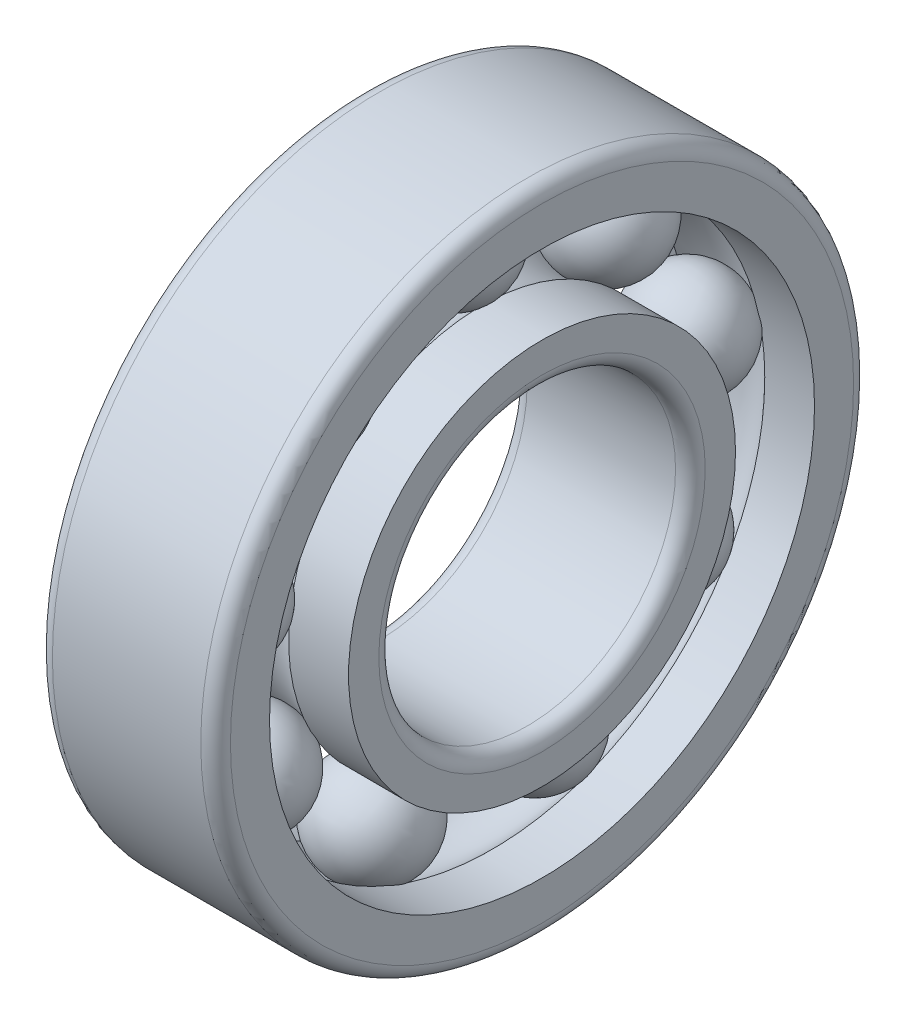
ISO-10303-21;
HEADER;
FILE_DESCRIPTION(('STEP AP214'),'2;1');
FILE_NAME('part.step','',(''),(''),'','','');
FILE_SCHEMA(('AUTOMOTIVE_DESIGN { 1 0 10303 214 1 1 1 1 }'));
ENDSEC;
DATA;
#1=APPLICATION_CONTEXT('core data for automotive mechanical design processes');
#2=APPLICATION_PROTOCOL_DEFINITION('international standard','automotive_design',2000,#1);
#3=PRODUCT_CONTEXT('',#1,'mechanical');
#4=PRODUCT('Part','Part','',(#3));
#5=PRODUCT_RELATED_PRODUCT_CATEGORY('part','',(#4));
#6=PRODUCT_DEFINITION_FORMATION('','',#4);
#7=PRODUCT_DEFINITION_CONTEXT('part definition',#1,'design');
#8=PRODUCT_DEFINITION('design','',#6,#7);
#9=PRODUCT_DEFINITION_SHAPE('','',#8);
#10=(LENGTH_UNIT() NAMED_UNIT(*) SI_UNIT(.MILLI.,.METRE.));
#11=(NAMED_UNIT(*) PLANE_ANGLE_UNIT() SI_UNIT($,.RADIAN.));
#12=(NAMED_UNIT(*) SI_UNIT($,.STERADIAN.) SOLID_ANGLE_UNIT());
#13=UNCERTAINTY_MEASURE_WITH_UNIT(LENGTH_MEASURE(1.E-05),#10,'distance_accuracy_value','');
#14=(GEOMETRIC_REPRESENTATION_CONTEXT(3) GLOBAL_UNCERTAINTY_ASSIGNED_CONTEXT((#13)) GLOBAL_UNIT_ASSIGNED_CONTEXT((#10,
#11,#12)) REPRESENTATION_CONTEXT('',''));
#15=CARTESIAN_POINT('',(0.,0.,0.));
#16=DIRECTION('',(0.,0.,1.));
#17=DIRECTION('',(1.,0.,0.));
#18=AXIS2_PLACEMENT_3D('',#15,#16,#17);
#19=CARTESIAN_POINT('',(2.5,0.,0.));
#20=DIRECTION('',(1.,0.,0.));
#21=DIRECTION('',(0.,0.,-1.));
#22=AXIS2_PLACEMENT_3D('',#19,#20,#21);
#23=TOROIDAL_SURFACE('',#22,5.5,0.5);
#24=CARTESIAN_POINT('',(2.5,0.,0.));
#25=DIRECTION('',(1.,0.,0.));
#26=DIRECTION('',(0.,0.,-1.));
#27=AXIS2_PLACEMENT_3D('',#24,#25,#26);
#28=CIRCLE('',#27,5.);
#29=CARTESIAN_POINT('',(2.5,0.,-5.));
#30=VERTEX_POINT('',#29);
#31=EDGE_CURVE('E1124',#30,#30,#28,.F.);
#32=ORIENTED_EDGE('',*,*,#31,.T.);
#33=EDGE_LOOP('',(#32));
#34=FACE_BOUND('',#33,.T.);
#35=CARTESIAN_POINT('',(3.,0.,0.));
#36=DIRECTION('',(1.,0.,0.));
#37=DIRECTION('',(0.,0.,-1.));
#38=AXIS2_PLACEMENT_3D('',#35,#36,#37);
#39=CIRCLE('',#38,5.5);
#40=CARTESIAN_POINT('',(3.,0.,5.5));
#41=VERTEX_POINT('',#40);
#42=CARTESIAN_POINT('',(3.,0.,-5.5));
#43=VERTEX_POINT('',#42);
#44=EDGE_CURVE('E295',#41,#43,#39,.F.);
#45=ORIENTED_EDGE('',*,*,#44,.F.);
#46=CARTESIAN_POINT('',(3.,0.,0.));
#47=DIRECTION('',(1.,0.,0.));
#48=DIRECTION('',(0.,0.,1.));
#49=AXIS2_PLACEMENT_3D('',#46,#47,#48);
#50=CIRCLE('',#49,5.5);
#51=EDGE_CURVE('E343',#43,#41,#50,.F.);
#52=ORIENTED_EDGE('',*,*,#51,.F.);
#53=EDGE_LOOP('',(#45,#52));
#54=FACE_BOUND('',#53,.T.);
#55=ADVANCED_FACE('F17',(#34,#54),#23,.T.);
#56=CARTESIAN_POINT('',(3.,6.520710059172,0.));
#57=DIRECTION('',(1.,0.,0.));
#58=DIRECTION('',(0.,0.,-1.));
#59=AXIS2_PLACEMENT_3D('',#56,#57,#58);
#60=PLANE('',#59);
#61=ORIENTED_EDGE('',*,*,#51,.T.);
#62=ORIENTED_EDGE('',*,*,#44,.T.);
#63=EDGE_LOOP('',(#61,#62));
#64=FACE_BOUND('',#63,.T.);
#65=CARTESIAN_POINT('',(3.,0.,0.));
#66=DIRECTION('',(1.,0.,0.));
#67=DIRECTION('',(0.,0.,-1.));
#68=AXIS2_PLACEMENT_3D('',#65,#66,#67);
#69=CIRCLE('',#68,6.520710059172);
#70=CARTESIAN_POINT('',(3.,0.,-6.520710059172));
#71=VERTEX_POINT('',#70);
#72=EDGE_CURVE('E1152',#71,#71,#69,.F.);
#73=ORIENTED_EDGE('',*,*,#72,.F.);
#74=EDGE_LOOP('',(#73));
#75=FACE_BOUND('',#74,.T.);
#76=ADVANCED_FACE('F349',(#64,#75),#60,.T.);
#77=CARTESIAN_POINT('',(5.,0.,0.));
#78=DIRECTION('',(1.,0.,0.));
#79=DIRECTION('',(0.,0.,-1.));
#80=AXIS2_PLACEMENT_3D('',#77,#78,#79);
#81=CYLINDRICAL_SURFACE('',#80,5.);
#82=ORIENTED_EDGE('',*,*,#31,.F.);
#83=EDGE_LOOP('',(#82));
#84=FACE_BOUND('',#83,.T.);
#85=CARTESIAN_POINT('',(-2.5,0.,0.));
#86=DIRECTION('',(1.,0.,0.));
#87=DIRECTION('',(0.,0.,-1.));
#88=AXIS2_PLACEMENT_3D('',#85,#86,#87);
#89=CIRCLE('',#88,5.);
#90=CARTESIAN_POINT('',(-2.5,0.,-5.));
#91=VERTEX_POINT('',#90);
#92=EDGE_CURVE('E299',#91,#91,#89,.T.);
#93=ORIENTED_EDGE('',*,*,#92,.F.);
#94=EDGE_LOOP('',(#93));
#95=FACE_BOUND('',#94,.T.);
#96=ADVANCED_FACE('F367',(#84,#95),#81,.F.);
#97=CARTESIAN_POINT('',(5.,0.,0.));
#98=DIRECTION('',(1.,0.,0.));
#99=DIRECTION('',(0.,0.,-1.));
#100=AXIS2_PLACEMENT_3D('',#97,#98,#99);
#101=CYLINDRICAL_SURFACE('',#100,6.520710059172);
#102=ORIENTED_EDGE('',*,*,#72,.T.);
#103=EDGE_LOOP('',(#102));
#104=FACE_BOUND('',#103,.T.);
#105=CARTESIAN_POINT('',(0.981249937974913,0.,0.));
#106=DIRECTION('',(1.,0.,0.));
#107=DIRECTION('',(0.,0.,-1.));
#108=AXIS2_PLACEMENT_3D('',#105,#106,#107);
#109=CIRCLE('',#108,6.52071005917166);
#110=CARTESIAN_POINT('',(0.981249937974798,-3.02385788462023,-5.7771916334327));
#111=VERTEX_POINT('',#110);
#112=CARTESIAN_POINT('',(0.981249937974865,0.865581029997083,-6.46300465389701));
#113=VERTEX_POINT('',#112);
#114=EDGE_CURVE('E292',#111,#113,#109,.T.);
#115=ORIENTED_EDGE('',*,*,#114,.T.);
#116=CARTESIAN_POINT('',(0.981249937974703,0.865581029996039,-6.46300465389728));
#117=CARTESIAN_POINT('',(0.988671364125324,0.887378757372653,-6.46008588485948));
#118=CARTESIAN_POINT('',(0.995198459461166,0.909452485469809,-6.45701662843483));
#119=CARTESIAN_POINT('',(1.00641074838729,0.954022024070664,-6.45058196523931));
#120=CARTESIAN_POINT('',(1.01109580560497,0.9765178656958,-6.44721653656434));
#121=CARTESIAN_POINT('',(1.02210293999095,1.04320490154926,-6.43687524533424));
#122=CARTESIAN_POINT('',(1.02578449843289,1.08779838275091,-6.4294943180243));
#123=CARTESIAN_POINT('',(1.02578449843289,1.17682045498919,-6.41379732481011));
#124=CARTESIAN_POINT('',(1.02210293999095,1.22124904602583,-6.40548125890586));
#125=CARTESIAN_POINT('',(1.01109580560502,1.28745129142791,-6.39239058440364));
#126=CARTESIAN_POINT('',(1.00641074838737,1.30974151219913,-6.38785902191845));
#127=CARTESIAN_POINT('',(0.995198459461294,1.35382396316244,-6.37866194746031));
#128=CARTESIAN_POINT('',(0.988671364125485,1.37561623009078,-6.37399644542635));
#129=CARTESIAN_POINT('',(0.981249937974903,1.39709767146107,-6.36928392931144));
#130=B_SPLINE_CURVE_WITH_KNOTS('',3,(#116,#117,#118,#119,#120,#121,#122,#123,#124,#125,#126,
#127,#128,#129),.UNSPECIFIED.,.F.,.F.,(4,2,2,2,2,2,4),(0.,0.0695963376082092,0.139197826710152,
0.274607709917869,0.410017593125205,0.479619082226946,0.549215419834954),.UNSPECIFIED.);
#131=CARTESIAN_POINT('',(0.981249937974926,1.39709767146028,-6.36928392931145));
#132=VERTEX_POINT('',#131);
#133=EDGE_CURVE('E275',#113,#132,#130,.T.);
#134=ORIENTED_EDGE('',*,*,#133,.T.);
#135=CARTESIAN_POINT('',(0.981249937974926,0.,0.));
#136=DIRECTION('',(1.,0.,0.));
#137=DIRECTION('',(0.,0.,-1.));
#138=AXIS2_PLACEMENT_3D('',#135,#136,#137);
#139=CIRCLE('',#138,6.52071005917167);
#140=CARTESIAN_POINT('',(0.981249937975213,4.81741285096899,-4.39456403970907));
#141=VERTEX_POINT('',#140);
#142=EDGE_CURVE('E289',#132,#141,#139,.T.);
#143=ORIENTED_EDGE('',*,*,#142,.T.);
#144=CARTESIAN_POINT('',(0.981249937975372,4.81741285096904,-4.3945640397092));
#145=CARTESIAN_POINT('',(0.988671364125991,4.83223473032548,-4.37831682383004));
#146=CARTESIAN_POINT('',(0.995198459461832,4.8471713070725,-4.36177691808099));
#147=CARTESIAN_POINT('',(1.00641074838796,4.87717743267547,-4.32819893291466));
#148=CARTESIAN_POINT('',(1.01109580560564,4.89224699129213,-4.31116081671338));
#149=CARTESIAN_POINT('',(1.02210293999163,4.93668497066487,-4.26037332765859));
#150=CARTESIAN_POINT('',(1.02578449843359,4.96610119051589,-4.22605507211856));
#151=CARTESIAN_POINT('',(1.02578449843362,5.02420622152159,-4.15680819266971));
#152=CARTESIAN_POINT('',(1.02210293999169,5.05289503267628,-4.1218795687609));
#153=CARTESIAN_POINT('',(1.01109580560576,5.09519437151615,-4.06929754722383));
#154=CARTESIAN_POINT('',(1.0064107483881,5.10935683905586,-4.05149829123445));
#155=CARTESIAN_POINT('',(0.995198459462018,5.13721419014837,-4.01611727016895));
#156=CARTESIAN_POINT('',(0.9886713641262,5.15090910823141,-3.99853548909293));
#157=CARTESIAN_POINT('',(0.981249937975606,5.16433570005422,-3.98111748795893));
#158=B_SPLINE_CURVE_WITH_KNOTS('',3,(#144,#145,#146,#147,#148,#149,#150,#151,#152,#153,#154,
#155,#156,#157),.UNSPECIFIED.,.F.,.F.,(4,2,2,2,2,2,4),(0.,0.0695963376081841,0.139197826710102,
0.274607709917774,0.410017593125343,0.479619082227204,0.549215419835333),.UNSPECIFIED.);
#159=CARTESIAN_POINT('',(0.981249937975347,5.16433570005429,-3.98111748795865));
#160=VERTEX_POINT('',#159);
#161=EDGE_CURVE('E294',#141,#160,#158,.T.);
#162=ORIENTED_EDGE('',*,*,#161,.T.);
#163=CARTESIAN_POINT('',(0.98124993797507,0.,0.));
#164=DIRECTION('',(1.,0.,0.));
#165=DIRECTION('',(0.,0.,-1.));
#166=AXIS2_PLACEMENT_3D('',#163,#164,#165);
#167=CIRCLE('',#166,6.52071005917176);
#168=CARTESIAN_POINT('',(0.981249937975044,6.51512365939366,-0.269858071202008));
#169=VERTEX_POINT('',#168);
#170=EDGE_CURVE('E300',#160,#169,#167,.T.);
#171=ORIENTED_EDGE('',*,*,#170,.T.);
#172=CARTESIAN_POINT('',(0.981249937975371,6.51512365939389,-0.2698580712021));
#173=CARTESIAN_POINT('',(0.988671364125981,6.51603436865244,-0.247884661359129));
#174=CARTESIAN_POINT('',(0.995198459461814,6.51684480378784,-0.225613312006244));
#175=CARTESIAN_POINT('',(1.00641074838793,6.51824731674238,-0.180603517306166));
#176=CARTESIAN_POINT('',(1.0110958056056,6.51883937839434,-0.157865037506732));
#177=CARTESIAN_POINT('',(1.02210293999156,6.52023527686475,-0.0903953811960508));
#178=CARTESIAN_POINT('',(1.02578449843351,6.520710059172,-0.0451976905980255));
#179=CARTESIAN_POINT('',(1.02578449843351,6.520710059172,0.0451976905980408));
#180=CARTESIAN_POINT('',(1.02210293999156,6.52023527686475,0.0903953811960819));
#181=CARTESIAN_POINT('',(1.01109580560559,6.51883937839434,0.157865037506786));
#182=CARTESIAN_POINT('',(1.00641074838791,6.51824731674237,0.180603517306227));
#183=CARTESIAN_POINT('',(0.995198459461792,6.51684480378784,0.22561331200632));
#184=CARTESIAN_POINT('',(0.988671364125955,6.51603436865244,0.247884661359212));
#185=CARTESIAN_POINT('',(0.981249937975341,6.51512365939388,0.26985807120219));
#186=B_SPLINE_CURVE_WITH_KNOTS('',3,(#172,#173,#174,#175,#176,#177,#178,#179,#180,#181,#182,
#183,#184,#185),.UNSPECIFIED.,.F.,.F.,(4,2,2,2,2,2,4),(0.,0.0695963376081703,0.139197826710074,
0.274607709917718,0.410017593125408,0.479619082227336,0.549215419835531),.UNSPECIFIED.);
#187=CARTESIAN_POINT('',(0.98124993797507,6.51512365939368,0.269858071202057));
#188=VERTEX_POINT('',#187);
#189=EDGE_CURVE('E1132',#169,#188,#186,.T.);
#190=ORIENTED_EDGE('',*,*,#189,.T.);
#191=CARTESIAN_POINT('',(0.98124993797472,0.,0.));
#192=DIRECTION('',(1.,0.,0.));
#193=DIRECTION('',(0.,0.,-1.));
#194=AXIS2_PLACEMENT_3D('',#191,#192,#193);
#195=CIRCLE('',#194,6.52071005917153);
#196=CARTESIAN_POINT('',(0.981249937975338,5.16433570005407,3.98111748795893));
#197=VERTEX_POINT('',#196);
#198=EDGE_CURVE('E306',#188,#197,#195,.T.);
#199=ORIENTED_EDGE('',*,*,#198,.T.);
#200=CARTESIAN_POINT('',(0.981249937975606,5.16433570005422,3.98111748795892));
#201=CARTESIAN_POINT('',(0.988671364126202,5.15090910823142,3.99853548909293));
#202=CARTESIAN_POINT('',(0.99519845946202,5.13721419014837,4.01611727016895));
#203=CARTESIAN_POINT('',(1.00641074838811,5.10935683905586,4.05149829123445));
#204=CARTESIAN_POINT('',(1.01109580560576,5.09519437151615,4.06929754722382));
#205=CARTESIAN_POINT('',(1.02210293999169,5.05289503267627,4.1218795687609));
#206=CARTESIAN_POINT('',(1.02578449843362,5.02420622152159,4.15680819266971));
#207=CARTESIAN_POINT('',(1.02578449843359,4.96610119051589,4.22605507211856));
#208=CARTESIAN_POINT('',(1.02210293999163,4.93668497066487,4.26037332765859));
#209=CARTESIAN_POINT('',(1.01109580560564,4.89224699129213,4.31116081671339));
#210=CARTESIAN_POINT('',(1.00641074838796,4.87717743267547,4.32819893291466));
#211=CARTESIAN_POINT('',(0.995198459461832,4.8471713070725,4.36177691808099));
#212=CARTESIAN_POINT('',(0.988671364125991,4.83223473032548,4.37831682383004));
#213=CARTESIAN_POINT('',(0.98124993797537,4.81741285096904,4.3945640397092));
#214=B_SPLINE_CURVE_WITH_KNOTS('',3,(#200,#201,#202,#203,#204,#205,#206,#207,#208,#209,#210,
#211,#212,#213),.UNSPECIFIED.,.F.,.F.,(4,2,2,2,2,2,4),(0.,0.0695963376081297,0.139197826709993,
0.274607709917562,0.410017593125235,0.479619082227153,0.549215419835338),.UNSPECIFIED.);
#215=CARTESIAN_POINT('',(0.981249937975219,4.81741285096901,4.39456403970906));
#216=VERTEX_POINT('',#215);
#217=EDGE_CURVE('E765',#197,#216,#214,.T.);
#218=ORIENTED_EDGE('',*,*,#217,.T.);
#219=CARTESIAN_POINT('',(0.981249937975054,0.,0.));
#220=DIRECTION('',(1.,0.,0.));
#221=DIRECTION('',(0.,0.,-1.));
#222=AXIS2_PLACEMENT_3D('',#219,#220,#221);
#223=CIRCLE('',#222,6.52071005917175);
#224=CARTESIAN_POINT('',(0.98124993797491,1.39709767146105,6.36928392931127));
#225=VERTEX_POINT('',#224);
#226=EDGE_CURVE('E359',#216,#225,#223,.T.);
#227=ORIENTED_EDGE('',*,*,#226,.T.);
#228=CARTESIAN_POINT('',(0.981249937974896,1.39709767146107,6.36928392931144));
#229=CARTESIAN_POINT('',(0.988671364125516,1.37561623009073,6.37399644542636));
#230=CARTESIAN_POINT('',(0.995198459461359,1.35382396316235,6.37866194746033));
#231=CARTESIAN_POINT('',(1.00641074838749,1.30974151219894,6.38785902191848));
#232=CARTESIAN_POINT('',(1.01109580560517,1.28745129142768,6.39239058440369));
#233=CARTESIAN_POINT('',(1.02210293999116,1.22124904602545,6.40548125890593));
#234=CARTESIAN_POINT('',(1.02578449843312,1.17682045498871,6.4137973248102));
#235=CARTESIAN_POINT('',(1.02578449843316,1.08779838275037,6.4294943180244));
#236=CARTESIAN_POINT('',(1.02210293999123,1.04320490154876,6.43687524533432));
#237=CARTESIAN_POINT('',(1.0110958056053,0.976517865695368,6.4472165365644));
#238=CARTESIAN_POINT('',(1.00641074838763,0.954022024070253,6.45058196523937));
#239=CARTESIAN_POINT('',(0.995198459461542,0.909452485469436,6.45701662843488));
#240=CARTESIAN_POINT('',(0.988671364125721,0.887378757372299,6.46008588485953));
#241=CARTESIAN_POINT('',(0.981249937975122,0.865581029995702,6.46300465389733));
#242=B_SPLINE_CURVE_WITH_KNOTS('',3,(#228,#229,#230,#231,#232,#233,#234,#235,#236,#237,#238,
#239,#240,#241),.UNSPECIFIED.,.F.,.F.,(4,2,2,2,2,2,4),(0.,0.0695963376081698,0.139197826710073,
0.274607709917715,0.410017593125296,0.479619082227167,0.549215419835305),.UNSPECIFIED.);
#243=CARTESIAN_POINT('',(0.981249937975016,0.865581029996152,6.46300465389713));
#244=VERTEX_POINT('',#243);
#245=EDGE_CURVE('E1126',#225,#244,#242,.T.);
#246=ORIENTED_EDGE('',*,*,#245,.T.);
#247=CARTESIAN_POINT('',(0.981249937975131,0.,0.));
#248=DIRECTION('',(1.,0.,0.));
#249=DIRECTION('',(0.,0.,-1.));
#250=AXIS2_PLACEMENT_3D('',#247,#248,#249);
#251=CIRCLE('',#250,6.5207100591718);
#252=CARTESIAN_POINT('',(0.981249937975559,-3.02385788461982,5.77719163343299));
#253=VERTEX_POINT('',#252);
#254=EDGE_CURVE('E883',#244,#253,#251,.T.);
#255=ORIENTED_EDGE('',*,*,#254,.T.);
#256=CARTESIAN_POINT('',(0.981249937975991,-3.02385788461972,5.77719163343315));
#257=CARTESIAN_POINT('',(0.988671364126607,-3.04334277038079,5.76699362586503));
#258=CARTESIAN_POINT('',(0.995198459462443,-3.06303554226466,5.75655980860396));
#259=CARTESIAN_POINT('',(1.00641074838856,-3.10271642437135,5.73526952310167));
#260=CARTESIAN_POINT('',(1.01109580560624,-3.12270455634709,5.72441302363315));
#261=CARTESIAN_POINT('',(1.0221029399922,-3.181832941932,5.69188707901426));
#262=CARTESIAN_POINT('',(1.02578449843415,-3.22121268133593,5.66969940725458));
#263=CARTESIAN_POINT('',(1.02578449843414,-3.2994973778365,5.62450171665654));
#264=CARTESIAN_POINT('',(1.0221029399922,-3.33840233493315,5.60149169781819));
#265=CARTESIAN_POINT('',(1.01109580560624,-3.39613482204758,5.56654798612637));
#266=CARTESIAN_POINT('',(1.00641074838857,-3.41553089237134,5.55466600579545));
#267=CARTESIAN_POINT('',(0.995198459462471,-3.45380926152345,5.53094649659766));
#268=CARTESIAN_POINT('',(0.988671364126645,-3.4726915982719,5.51910896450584));
#269=CARTESIAN_POINT('',(0.98124993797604,-3.4912657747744,5.50733356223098));
#270=B_SPLINE_CURVE_WITH_KNOTS('',3,(#256,#257,#258,#259,#260,#261,#262,#263,#264,#265,#266,
#267,#268,#269),.UNSPECIFIED.,.F.,.F.,(4,2,2,2,2,2,4),(0.,0.0695963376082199,0.139197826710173,
0.274607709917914,0.410017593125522,0.479619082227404,0.549215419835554),.UNSPECIFIED.);
#271=CARTESIAN_POINT('',(0.981249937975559,-3.49126577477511,5.5073335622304));
#272=VERTEX_POINT('',#271);
#273=EDGE_CURVE('E880',#253,#272,#270,.T.);
#274=ORIENTED_EDGE('',*,*,#273,.T.);
#275=CARTESIAN_POINT('',(0.981249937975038,0.,0.));
#276=DIRECTION('',(1.,0.,0.));
#277=DIRECTION('',(0.,0.,-1.));
#278=AXIS2_PLACEMENT_3D('',#275,#276,#277);
#279=CIRCLE('',#278,6.52071005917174);
#280=CARTESIAN_POINT('',(0.981249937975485,-6.02991673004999,2.48188716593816));
#281=VERTEX_POINT('',#280);
#282=EDGE_CURVE('E878',#272,#281,#279,.T.);
#283=ORIENTED_EDGE('',*,*,#282,.T.);
#284=CARTESIAN_POINT('',(0.981249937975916,-6.02991673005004,2.48188716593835));
#285=CARTESIAN_POINT('',(0.988671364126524,-6.03828786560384,2.46155039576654));
#286=CARTESIAN_POINT('',(0.995198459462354,-6.04666667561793,2.44089935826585));
#287=CARTESIAN_POINT('',(1.00641074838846,-6.06337886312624,2.39908367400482));
#288=CARTESIAN_POINT('',(1.01109580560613,-6.07171223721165,2.37791898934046));
#289=CARTESIAN_POINT('',(1.0221029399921,-6.09609993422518,2.31499567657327));
#290=CARTESIAN_POINT('',(1.02578449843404,-6.11200460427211,2.27268612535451));
#291=CARTESIAN_POINT('',(1.02578449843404,-6.14292164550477,2.18774225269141));
#292=CARTESIAN_POINT('',(1.0221029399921,-6.15793401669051,2.14510793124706));
#293=CARTESIAN_POINT('',(1.01109580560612,-6.17969828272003,2.08122976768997));
#294=CARTESIAN_POINT('',(1.00641074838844,-6.18691894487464,2.05966008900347));
#295=CARTESIAN_POINT('',(0.995198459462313,-6.2009952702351,2.01688502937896));
#296=CARTESIAN_POINT('',(0.988671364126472,-6.20785096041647,1.99567962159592));
#297=CARTESIAN_POINT('',(0.981249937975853,-6.21451052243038,1.97471988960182));
#298=B_SPLINE_CURVE_WITH_KNOTS('',3,(#284,#285,#286,#287,#288,#289,#290,#291,#292,#293,#294,
#295,#296,#297),.UNSPECIFIED.,.F.,.F.,(4,2,2,2,2,2,4),(0.,0.0695963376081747,0.139197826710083,
0.274607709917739,0.410017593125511,0.47961908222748,0.549215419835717),.UNSPECIFIED.);
#299=CARTESIAN_POINT('',(0.981249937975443,-6.21451052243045,1.97471988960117));
#300=VERTEX_POINT('',#299);
#301=EDGE_CURVE('E867',#281,#300,#298,.T.);
#302=ORIENTED_EDGE('',*,*,#301,.T.);
#303=CARTESIAN_POINT('',(0.98124993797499,0.,0.));
#304=DIRECTION('',(1.,0.,0.));
#305=DIRECTION('',(0.,0.,-1.));
#306=AXIS2_PLACEMENT_3D('',#303,#304,#305);
#307=CIRCLE('',#306,6.52071005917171);
#308=CARTESIAN_POINT('',(0.981249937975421,-6.2145105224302,-1.97471988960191));
#309=VERTEX_POINT('',#308);
#310=EDGE_CURVE('E875',#300,#309,#307,.T.);
#311=ORIENTED_EDGE('',*,*,#310,.T.);
#312=CARTESIAN_POINT('',(0.981249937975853,-6.21451052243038,-1.97471988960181));
#313=CARTESIAN_POINT('',(0.988671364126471,-6.20785096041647,-1.99567962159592));
#314=CARTESIAN_POINT('',(0.995198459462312,-6.2009952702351,-2.01688502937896));
#315=CARTESIAN_POINT('',(1.00641074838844,-6.18691894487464,-2.05966008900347));
#316=CARTESIAN_POINT('',(1.01109580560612,-6.17969828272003,-2.08122976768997));
#317=CARTESIAN_POINT('',(1.0221029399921,-6.15793401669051,-2.14510793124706));
#318=CARTESIAN_POINT('',(1.02578449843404,-6.14292164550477,-2.18774225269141));
#319=CARTESIAN_POINT('',(1.02578449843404,-6.11200460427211,-2.27268612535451));
#320=CARTESIAN_POINT('',(1.0221029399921,-6.09609993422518,-2.31499567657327));
#321=CARTESIAN_POINT('',(1.01109580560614,-6.07171223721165,-2.37791898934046));
#322=CARTESIAN_POINT('',(1.00641074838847,-6.06337886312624,-2.39908367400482));
#323=CARTESIAN_POINT('',(0.995198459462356,-6.04666667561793,-2.44089935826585));
#324=CARTESIAN_POINT('',(0.988671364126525,-6.03828786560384,-2.46155039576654));
#325=CARTESIAN_POINT('',(0.981249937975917,-6.02991673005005,-2.48188716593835));
#326=B_SPLINE_CURVE_WITH_KNOTS('',3,(#312,#313,#314,#315,#316,#317,#318,#319,#320,#321,#322,
#323,#324,#325),.UNSPECIFIED.,.F.,.F.,(4,2,2,2,2,2,4),(0.,0.0695963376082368,0.139197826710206,
0.274607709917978,0.410017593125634,0.479619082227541,0.549215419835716),.UNSPECIFIED.);
#327=CARTESIAN_POINT('',(0.9812499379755,-6.02991673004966,-2.48188716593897));
#328=VERTEX_POINT('',#327);
#329=EDGE_CURVE('E879',#309,#328,#326,.T.);
#330=ORIENTED_EDGE('',*,*,#329,.T.);
#331=CARTESIAN_POINT('',(0.981249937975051,0.,0.));
#332=DIRECTION('',(1.,0.,0.));
#333=DIRECTION('',(0.,0.,-1.));
#334=AXIS2_PLACEMENT_3D('',#331,#332,#333);
#335=CIRCLE('',#334,6.52071005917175);
#336=CARTESIAN_POINT('',(0.981249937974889,-3.491265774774,-5.50733356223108));
#337=VERTEX_POINT('',#336);
#338=EDGE_CURVE('E303',#328,#337,#335,.T.);
#339=ORIENTED_EDGE('',*,*,#338,.T.);
#340=CARTESIAN_POINT('',(0.98124993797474,-3.49126577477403,-5.50733356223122));
#341=CARTESIAN_POINT('',(0.988671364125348,-3.47269159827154,-5.51910896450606));
#342=CARTESIAN_POINT('',(0.995198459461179,-3.4538092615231,-5.53094649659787));
#343=CARTESIAN_POINT('',(1.00641074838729,-3.41553089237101,-5.55466600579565));
#344=CARTESIAN_POINT('',(1.01109580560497,-3.39613482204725,-5.56654798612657));
#345=CARTESIAN_POINT('',(1.02210293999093,-3.33840233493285,-5.60149169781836));
#346=CARTESIAN_POINT('',(1.02578449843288,-3.29949737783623,-5.6245017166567));
#347=CARTESIAN_POINT('',(1.0257844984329,-3.22121268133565,-5.66969940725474));
#348=CARTESIAN_POINT('',(1.02210293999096,-3.18183294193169,-5.69188707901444));
#349=CARTESIAN_POINT('',(1.01109580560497,-3.12270455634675,-5.72441302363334));
#350=CARTESIAN_POINT('',(1.00641074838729,-3.10271642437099,-5.73526952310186));
#351=CARTESIAN_POINT('',(0.995198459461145,-3.06303554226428,-5.75655980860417));
#352=CARTESIAN_POINT('',(0.988671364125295,-3.04334277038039,-5.76699362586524));
#353=CARTESIAN_POINT('',(0.981249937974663,-3.02385788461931,-5.77719163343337));
#354=B_SPLINE_CURVE_WITH_KNOTS('',3,(#340,#341,#342,#343,#344,#345,#346,#347,#348,#349,#350,
#351,#352,#353),.UNSPECIFIED.,.F.,.F.,(4,2,2,2,2,2,4),(0.,0.0695963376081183,0.139197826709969,
0.274607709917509,0.410017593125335,0.479619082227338,0.549215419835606),.UNSPECIFIED.);
#355=EDGE_CURVE('E1147',#337,#111,#354,.T.);
#356=ORIENTED_EDGE('',*,*,#355,.T.);
#357=EDGE_LOOP('',(#115,#134,#143,#162,#171,#190,#199,#218,#227,#246,#255,#274,#283,#302,#311,
#330,#339,#356));
#358=FACE_BOUND('',#357,.T.);
#359=ADVANCED_FACE('F287',(#104,#358),#101,.T.);
#360=CARTESIAN_POINT('',(-2.5,0.,0.));
#361=DIRECTION('',(1.,0.,0.));
#362=DIRECTION('',(0.,0.,-1.));
#363=AXIS2_PLACEMENT_3D('',#360,#361,#362);
#364=TOROIDAL_SURFACE('',#363,5.5,0.5);
#365=CARTESIAN_POINT('',(-3.,0.,0.));
#366=DIRECTION('',(-1.,0.,0.));
#367=DIRECTION('',(0.,0.,-1.));
#368=AXIS2_PLACEMENT_3D('',#365,#366,#367);
#369=CIRCLE('',#368,5.5);
#370=CARTESIAN_POINT('',(-3.,0.,5.5));
#371=VERTEX_POINT('',#370);
#372=CARTESIAN_POINT('',(-3.,0.,-5.5));
#373=VERTEX_POINT('',#372);
#374=EDGE_CURVE('E282',#371,#373,#369,.F.);
#375=ORIENTED_EDGE('',*,*,#374,.F.);
#376=CARTESIAN_POINT('',(-3.,0.,0.));
#377=DIRECTION('',(-1.,0.,0.));
#378=DIRECTION('',(0.,0.,1.));
#379=AXIS2_PLACEMENT_3D('',#376,#377,#378);
#380=CIRCLE('',#379,5.5);
#381=EDGE_CURVE('E402',#373,#371,#380,.F.);
#382=ORIENTED_EDGE('',*,*,#381,.F.);
#383=EDGE_LOOP('',(#375,#382));
#384=FACE_BOUND('',#383,.T.);
#385=ORIENTED_EDGE('',*,*,#92,.T.);
#386=EDGE_LOOP('',(#385));
#387=FACE_BOUND('',#386,.T.);
#388=ADVANCED_FACE('F314',(#384,#387),#364,.T.);
#389=CARTESIAN_POINT('',(0.,0.,0.));
#390=DIRECTION('',(1.,0.,0.));
#391=DIRECTION('',(0.,0.,-1.));
#392=AXIS2_PLACEMENT_3D('',#389,#390,#391);
#393=TOROIDAL_SURFACE('',#392,8.,1.775147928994);
#394=CARTESIAN_POINT('',(-0.981249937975,0.,0.));
#395=DIRECTION('',(1.,0.,0.));
#396=DIRECTION('',(0.,0.,-1.));
#397=AXIS2_PLACEMENT_3D('',#394,#395,#396);
#398=CIRCLE('',#397,6.520710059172);
#399=CARTESIAN_POINT('',(-0.981249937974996,1.39709767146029,6.36928392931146));
#400=VERTEX_POINT('',#399);
#401=CARTESIAN_POINT('',(-0.981249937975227,4.81741285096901,4.39456403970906));
#402=VERTEX_POINT('',#401);
#403=EDGE_CURVE('E822',#400,#402,#398,.F.);
#404=ORIENTED_EDGE('',*,*,#403,.F.);
#405=CARTESIAN_POINT('',(0.981249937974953,1.39709767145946,6.36928392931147));
#406=CARTESIAN_POINT('',(0.939611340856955,1.39173877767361,6.34218463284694));
#407=CARTESIAN_POINT('',(0.896830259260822,1.38672196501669,6.31682448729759));
#408=CARTESIAN_POINT('',(0.809235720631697,1.37740223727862,6.2697263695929));
#409=CARTESIAN_POINT('',(0.76442194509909,1.37309943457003,6.24798896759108));
#410=CARTESIAN_POINT('',(0.627618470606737,1.3613337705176,6.18856369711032));
#411=CARTESIAN_POINT('',(0.533001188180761,1.35497954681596,6.15649037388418));
#412=CARTESIAN_POINT('',(0.365110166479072,1.34669900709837,6.11470322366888));
#413=CARTESIAN_POINT('',(0.292746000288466,1.34404849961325,6.10133154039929));
#414=CARTESIAN_POINT('',(0.146939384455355,1.34050924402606,6.08347743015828));
#415=CARTESIAN_POINT('',(0.0734976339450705,1.33961940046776,6.07898947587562));
#416=CARTESIAN_POINT('',(-0.120774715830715,1.33962321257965,6.07900822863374));
#417=CARTESIAN_POINT('',(-0.241700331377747,1.34203228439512,6.09115768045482));
#418=CARTESIAN_POINT('',(-0.456403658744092,1.35067581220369,6.13477040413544));
#419=CARTESIAN_POINT('',(-0.551055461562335,1.35611755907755,6.16223186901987));
#420=CARTESIAN_POINT('',(-0.702037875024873,1.36751288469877,6.21977085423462));
#421=CARTESIAN_POINT('',(-0.760113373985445,1.37260952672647,6.2455122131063));
#422=CARTESIAN_POINT('',(-0.873175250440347,1.38398337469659,6.30298164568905));
#423=CARTESIAN_POINT('',(-0.928158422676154,1.39026177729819,6.33471578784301));
#424=CARTESIAN_POINT('',(-0.981249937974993,1.39709767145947,6.36928392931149));
#425=B_SPLINE_CURVE_WITH_KNOTS('',3,(#405,#406,#407,#408,#409,#410,#411,#412,#413,#414,#415,
#416,#417,#418,#419,#420,#421,#422,#423,#424),.UNSPECIFIED.,.F.,.F.,(4,2,2,2,2,2,2,2,2,4),(0.,
0.149805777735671,0.299635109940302,0.598350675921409,0.818732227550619,1.0389766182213,
1.40089240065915,1.69565719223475,1.88649401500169,2.07752513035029),.UNSPECIFIED.);
#426=EDGE_CURVE('E892',#225,#400,#425,.T.);
#427=ORIENTED_EDGE('',*,*,#426,.F.);
#428=ORIENTED_EDGE('',*,*,#226,.F.);
#429=CARTESIAN_POINT('',(-0.981249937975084,4.81741285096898,4.39456403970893));
#430=CARTESIAN_POINT('',(-0.939611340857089,4.79662361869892,4.37637345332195));
#431=CARTESIAN_POINT('',(-0.89683025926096,4.77716949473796,4.35934869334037));
#432=CARTESIAN_POINT('',(-0.809235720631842,4.74104119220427,4.32772851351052));
#433=CARTESIAN_POINT('',(-0.764421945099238,4.72436745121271,4.3131334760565));
#434=CARTESIAN_POINT('',(-0.627618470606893,4.67878648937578,4.27323147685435));
#435=CARTESIAN_POINT('',(-0.533001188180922,4.65418728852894,4.25169189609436));
#436=CARTESIAN_POINT('',(-0.365110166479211,4.62213882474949,4.22362716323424));
#437=CARTESIAN_POINT('',(-0.292746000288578,4.61188386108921,4.21464591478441));
#438=CARTESIAN_POINT('',(-0.146939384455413,4.5981913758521,4.20265377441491));
#439=CARTESIAN_POINT('',(-0.0734976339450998,4.59474961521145,4.1996391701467));
#440=CARTESIAN_POINT('',(0.120774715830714,4.59476394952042,4.19965184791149));
#441=CARTESIAN_POINT('',(0.241700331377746,4.60408114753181,4.20781289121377));
#442=CARTESIAN_POINT('',(0.456403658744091,4.63752911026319,4.2371047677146));
#443=CARTESIAN_POINT('',(0.551055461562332,4.65859056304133,4.25554819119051));
#444=CARTESIAN_POINT('',(0.702037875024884,4.70272312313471,4.29418632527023));
#445=CARTESIAN_POINT('',(0.76011337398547,4.72246747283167,4.31147082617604));
#446=CARTESIAN_POINT('',(0.873175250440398,4.7665505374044,4.3500555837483));
#447=CARTESIAN_POINT('',(0.928158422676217,4.79089390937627,4.37135991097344));
#448=CARTESIAN_POINT('',(0.981249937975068,4.81741285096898,4.39456403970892));
#449=B_SPLINE_CURVE_WITH_KNOTS('',3,(#429,#430,#431,#432,#433,#434,#435,#436,#437,#438,#439,
#440,#441,#442,#443,#444,#445,#446,#447,#448),.UNSPECIFIED.,.F.,.F.,(4,2,2,2,2,2,2,2,2,4),(0.,
0.149805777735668,0.299635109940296,0.598350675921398,0.818732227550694,1.03897661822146,
1.40089240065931,1.69565719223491,1.8864940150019,2.07752513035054),.UNSPECIFIED.);
#450=EDGE_CURVE('E1158',#402,#216,#449,.T.);
#451=ORIENTED_EDGE('',*,*,#450,.F.);
#452=EDGE_LOOP('',(#404,#427,#428,#451));
#453=FACE_BOUND('',#452,.T.);
#454=ADVANCED_FACE('F319',(#453),#393,.F.);
#455=CARTESIAN_POINT('',(0.,0.,0.));
#456=DIRECTION('',(1.,0.,0.));
#457=DIRECTION('',(0.,0.,-1.));
#458=AXIS2_PLACEMENT_3D('',#455,#456,#457);
#459=TOROIDAL_SURFACE('',#458,8.,1.775147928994);
#460=CARTESIAN_POINT('',(-0.981249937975,0.,0.));
#461=DIRECTION('',(1.,0.,0.));
#462=DIRECTION('',(0.,0.,-1.));
#463=AXIS2_PLACEMENT_3D('',#460,#461,#462);
#464=CIRCLE('',#463,6.520710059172);
#465=CARTESIAN_POINT('',(-0.981249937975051,5.16433570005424,3.98111748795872));
#466=VERTEX_POINT('',#465);
#467=CARTESIAN_POINT('',(-0.98124993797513,6.51512365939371,0.269858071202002));
#468=VERTEX_POINT('',#467);
#469=EDGE_CURVE('E825',#466,#468,#464,.F.);
#470=ORIENTED_EDGE('',*,*,#469,.F.);
#471=CARTESIAN_POINT('',(0.98124993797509,5.16433570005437,3.98111748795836));
#472=CARTESIAN_POINT('',(0.939611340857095,5.14281145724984,3.96380285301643));
#473=CARTESIAN_POINT('',(0.896830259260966,5.12266716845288,3.94760059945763));
#474=CARTESIAN_POINT('',(0.809235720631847,5.08525375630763,3.91751195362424));
#475=CARTESIAN_POINT('',(0.764421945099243,5.06798508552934,3.90362592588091));
#476=CARTESIAN_POINT('',(0.627618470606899,5.02077423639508,3.86566635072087));
#477=CARTESIAN_POINT('',(0.533001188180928,4.99529028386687,3.84518117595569));
#478=CARTESIAN_POINT('',(0.365110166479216,4.96208676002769,3.81849299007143));
#479=CARTESIAN_POINT('',(0.292746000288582,4.95146120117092,3.80995339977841));
#480=CARTESIAN_POINT('',(0.146939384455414,4.93727357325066,3.79855134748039));
#481=CARTESIAN_POINT('',(0.0734976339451,4.93370711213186,3.79568535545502));
#482=CARTESIAN_POINT('',(-0.120774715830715,4.93372208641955,3.79569727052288));
#483=CARTESIAN_POINT('',(-0.241700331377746,4.94337705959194,3.80345576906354));
#484=CARTESIAN_POINT('',(-0.45640365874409,4.97803210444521,3.83130910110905));
#485=CARTESIAN_POINT('',(-0.551055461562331,4.99985261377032,3.84884791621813));
#486=CARTESIAN_POINT('',(-0.702037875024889,5.04556728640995,3.88560056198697));
#487=CARTESIAN_POINT('',(-0.760113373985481,5.06601776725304,3.90204352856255));
#488=CARTESIAN_POINT('',(-0.873175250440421,5.11167127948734,3.93875669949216));
#489=CARTESIAN_POINT('',(-0.928158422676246,5.13687912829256,3.95903078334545));
#490=CARTESIAN_POINT('',(-0.981249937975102,5.16433570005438,3.98111748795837));
#491=B_SPLINE_CURVE_WITH_KNOTS('',3,(#471,#472,#473,#474,#475,#476,#477,#478,#479,#480,#481,
#482,#483,#484,#485,#486,#487,#488,#489,#490),.UNSPECIFIED.,.F.,.F.,(4,2,2,2,2,2,2,2,2,4),(0.,
0.149805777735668,0.299635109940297,0.598350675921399,0.818732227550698,1.03897661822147,
1.40089240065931,1.69565719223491,1.88649401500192,2.07752513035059),.UNSPECIFIED.);
#492=EDGE_CURVE('E758',#197,#466,#491,.T.);
#493=ORIENTED_EDGE('',*,*,#492,.F.);
#494=ORIENTED_EDGE('',*,*,#198,.F.);
#495=CARTESIAN_POINT('',(-0.981249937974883,6.51512365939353,0.269858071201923));
#496=CARTESIAN_POINT('',(-0.939611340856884,6.48750549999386,0.269286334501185));
#497=CARTESIAN_POINT('',(-0.896830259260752,6.46165947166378,0.268749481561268));
#498=CARTESIAN_POINT('',(-0.809235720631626,6.41365852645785,0.267749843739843));
#499=CARTESIAN_POINT('',(-0.764421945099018,6.39150419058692,0.26728707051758));
#500=CARTESIAN_POINT('',(-0.627618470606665,6.33093863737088,0.266019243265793));
#501=CARTESIAN_POINT('',(-0.533001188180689,6.29824918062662,0.265331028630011));
#502=CARTESIAN_POINT('',(-0.365110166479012,6.25565897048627,0.264432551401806));
#503=CARTESIAN_POINT('',(-0.292746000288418,6.24203017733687,0.264144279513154));
#504=CARTESIAN_POINT('',(-0.146939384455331,6.22383272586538,0.26375912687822));
#505=CARTESIAN_POINT('',(-0.0734976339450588,6.21925843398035,0.26366212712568));
#506=CARTESIAN_POINT('',(0.120774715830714,6.21927756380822,0.26366262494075));
#507=CARTESIAN_POINT('',(0.241700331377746,6.2316607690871,0.263925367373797));
#508=CARTESIAN_POINT('',(0.456403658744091,6.27611185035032,0.264864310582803));
#509=CARTESIAN_POINT('',(0.551055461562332,6.30410106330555,0.265454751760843));
#510=CARTESIAN_POINT('',(0.702037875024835,6.36274467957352,0.266685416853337));
#511=CARTESIAN_POINT('',(0.760113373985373,6.38897999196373,0.267234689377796));
#512=CARTESIAN_POINT('',(0.873175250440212,6.44755138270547,0.268456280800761));
#513=CARTESIAN_POINT('',(0.928158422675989,6.47989364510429,0.269128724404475));
#514=CARTESIAN_POINT('',(0.981249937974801,6.51512365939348,0.269858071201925));
#515=B_SPLINE_CURVE_WITH_KNOTS('',3,(#495,#496,#497,#498,#499,#500,#501,#502,#503,#504,#505,
#506,#507,#508,#509,#510,#511,#512,#513,#514),.UNSPECIFIED.,.F.,.F.,(4,2,2,2,2,2,2,2,2,4),(0.,
0.149805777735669,0.299635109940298,0.598350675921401,0.818732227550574,1.03897661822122,
1.40089240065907,1.69565719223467,1.8864940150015,2.07752513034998),.UNSPECIFIED.);
#516=EDGE_CURVE('E905',#468,#188,#515,.T.);
#517=ORIENTED_EDGE('',*,*,#516,.F.);
#518=EDGE_LOOP('',(#470,#493,#494,#517));
#519=FACE_BOUND('',#518,.T.);
#520=ADVANCED_FACE('F898',(#519),#459,.F.);
#521=CARTESIAN_POINT('',(0.,0.,0.));
#522=DIRECTION('',(1.,0.,0.));
#523=DIRECTION('',(0.,0.,-1.));
#524=AXIS2_PLACEMENT_3D('',#521,#522,#523);
#525=TOROIDAL_SURFACE('',#524,8.,1.775147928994);
#526=CARTESIAN_POINT('',(-0.981249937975,0.,0.));
#527=DIRECTION('',(1.,0.,0.));
#528=DIRECTION('',(0.,0.,-1.));
#529=AXIS2_PLACEMENT_3D('',#526,#527,#528);
#530=CIRCLE('',#529,6.520710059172);
#531=CARTESIAN_POINT('',(-0.981249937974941,6.51512365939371,-0.269858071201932));
#532=VERTEX_POINT('',#531);
#533=CARTESIAN_POINT('',(-0.981249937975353,5.1643357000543,-3.98111748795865));
#534=VERTEX_POINT('',#533);
#535=EDGE_CURVE('E829',#532,#534,#530,.F.);
#536=ORIENTED_EDGE('',*,*,#535,.F.);
#537=CARTESIAN_POINT('',(0.981249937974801,6.51512365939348,-0.269858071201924));
#538=CARTESIAN_POINT('',(0.939611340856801,6.48750549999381,-0.269286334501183));
#539=CARTESIAN_POINT('',(0.896830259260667,6.46165947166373,-0.268749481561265));
#540=CARTESIAN_POINT('',(0.809235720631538,6.41365852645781,-0.267749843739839));
#541=CARTESIAN_POINT('',(0.76442194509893,6.39150419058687,-0.267287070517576));
#542=CARTESIAN_POINT('',(0.627618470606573,6.33093863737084,-0.266019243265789));
#543=CARTESIAN_POINT('',(0.533001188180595,6.2982491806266,-0.265331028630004));
#544=CARTESIAN_POINT('',(0.365110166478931,6.25565897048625,-0.264432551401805));
#545=CARTESIAN_POINT('',(0.292746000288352,6.24203017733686,-0.264144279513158));
#546=CARTESIAN_POINT('',(0.146939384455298,6.22383272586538,-0.263759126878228));
#547=CARTESIAN_POINT('',(0.0734976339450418,6.21925843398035,-0.263662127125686));
#548=CARTESIAN_POINT('',(-0.120774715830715,6.21927756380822,-0.263662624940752));
#549=CARTESIAN_POINT('',(-0.241700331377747,6.2316607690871,-0.263925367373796));
#550=CARTESIAN_POINT('',(-0.456403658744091,6.27611185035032,-0.264864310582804));
#551=CARTESIAN_POINT('',(-0.551055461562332,6.30410106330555,-0.265454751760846));
#552=CARTESIAN_POINT('',(-0.70203787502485,6.36274467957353,-0.266685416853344));
#553=CARTESIAN_POINT('',(-0.760113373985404,6.38897999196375,-0.267234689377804));
#554=CARTESIAN_POINT('',(-0.873175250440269,6.4475513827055,-0.268456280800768));
#555=CARTESIAN_POINT('',(-0.92815842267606,6.47989364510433,-0.269128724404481));
#556=CARTESIAN_POINT('',(-0.981249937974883,6.51512365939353,-0.269858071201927));
#557=B_SPLINE_CURVE_WITH_KNOTS('',3,(#537,#538,#539,#540,#541,#542,#543,#544,#545,#546,#547,
#548,#549,#550,#551,#552,#553,#554,#555,#556),.UNSPECIFIED.,.F.,.F.,(4,2,2,2,2,2,2,2,2,4),(0.,
0.149805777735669,0.299635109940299,0.598350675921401,0.818732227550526,1.03897661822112,
1.40089240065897,1.69565719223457,1.88649401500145,2.07752513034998),.UNSPECIFIED.);
#558=EDGE_CURVE('E910',#169,#532,#557,.T.);
#559=ORIENTED_EDGE('',*,*,#558,.F.);
#560=ORIENTED_EDGE('',*,*,#170,.F.);
#561=CARTESIAN_POINT('',(-0.981249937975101,5.16433570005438,-3.98111748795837));
#562=CARTESIAN_POINT('',(-0.939611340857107,5.14281145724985,-3.96380285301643));
#563=CARTESIAN_POINT('',(-0.896830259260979,5.12266716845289,-3.94760059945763));
#564=CARTESIAN_POINT('',(-0.809235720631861,5.08525375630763,-3.91751195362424));
#565=CARTESIAN_POINT('',(-0.764421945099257,5.06798508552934,-3.90362592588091));
#566=CARTESIAN_POINT('',(-0.627618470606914,5.02077423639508,-3.86566635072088));
#567=CARTESIAN_POINT('',(-0.533001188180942,4.99529028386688,-3.84518117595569));
#568=CARTESIAN_POINT('',(-0.365110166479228,4.96208676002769,-3.81849299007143));
#569=CARTESIAN_POINT('',(-0.292746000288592,4.95146120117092,-3.80995339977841));
#570=CARTESIAN_POINT('',(-0.146939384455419,4.93727357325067,-3.79855134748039));
#571=CARTESIAN_POINT('',(-0.0734976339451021,4.93370711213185,-3.79568535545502));
#572=CARTESIAN_POINT('',(0.120774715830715,4.93372208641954,-3.79569727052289));
#573=CARTESIAN_POINT('',(0.241700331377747,4.94337705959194,-3.80345576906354));
#574=CARTESIAN_POINT('',(0.456403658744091,4.97803210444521,-3.83130910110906));
#575=CARTESIAN_POINT('',(0.551055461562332,4.99985261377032,-3.84884791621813));
#576=CARTESIAN_POINT('',(0.702037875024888,5.04556728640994,-3.88560056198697));
#577=CARTESIAN_POINT('',(0.760113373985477,5.06601776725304,-3.90204352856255));
#578=CARTESIAN_POINT('',(0.873175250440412,5.11167127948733,-3.93875669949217));
#579=CARTESIAN_POINT('',(0.928158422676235,5.13687912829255,-3.95903078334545));
#580=CARTESIAN_POINT('',(0.981249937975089,5.16433570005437,-3.98111748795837));
#581=B_SPLINE_CURVE_WITH_KNOTS('',3,(#561,#562,#563,#564,#565,#566,#567,#568,#569,#570,#571,
#572,#573,#574,#575,#576,#577,#578,#579,#580),.UNSPECIFIED.,.F.,.F.,(4,2,2,2,2,2,2,2,2,4),(0.,
0.149805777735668,0.299635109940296,0.598350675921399,0.818732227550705,1.03897661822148,
1.40089240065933,1.69565719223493,1.88649401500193,2.07752513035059),.UNSPECIFIED.);
#582=EDGE_CURVE('E915',#534,#160,#581,.T.);
#583=ORIENTED_EDGE('',*,*,#582,.F.);
#584=EDGE_LOOP('',(#536,#559,#560,#583));
#585=FACE_BOUND('',#584,.T.);
#586=ADVANCED_FACE('F901',(#585),#525,.F.);
#587=CARTESIAN_POINT('',(0.,0.,0.));
#588=DIRECTION('',(1.,0.,0.));
#589=DIRECTION('',(0.,0.,-1.));
#590=AXIS2_PLACEMENT_3D('',#587,#588,#589);
#591=TOROIDAL_SURFACE('',#590,8.,1.775147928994);
#592=CARTESIAN_POINT('',(-0.981249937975,0.,0.));
#593=DIRECTION('',(1.,0.,0.));
#594=DIRECTION('',(0.,0.,-1.));
#595=AXIS2_PLACEMENT_3D('',#592,#593,#594);
#596=CIRCLE('',#595,6.520710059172);
#597=CARTESIAN_POINT('',(-0.981249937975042,4.81741285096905,-4.39456403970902));
#598=VERTEX_POINT('',#597);
#599=CARTESIAN_POINT('',(-0.981249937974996,1.39709767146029,-6.36928392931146));
#600=VERTEX_POINT('',#599);
#601=EDGE_CURVE('E832',#598,#600,#596,.F.);
#602=ORIENTED_EDGE('',*,*,#601,.F.);
#603=CARTESIAN_POINT('',(0.981249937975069,4.81741285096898,-4.39456403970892));
#604=CARTESIAN_POINT('',(0.939611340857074,4.79662361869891,-4.37637345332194));
#605=CARTESIAN_POINT('',(0.896830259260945,4.77716949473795,-4.35934869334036));
#606=CARTESIAN_POINT('',(0.809235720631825,4.74104119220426,-4.32772851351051));
#607=CARTESIAN_POINT('',(0.764421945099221,4.7243674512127,-4.3131334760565));
#608=CARTESIAN_POINT('',(0.627618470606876,4.67878648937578,-4.27323147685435));
#609=CARTESIAN_POINT('',(0.533001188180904,4.65418728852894,-4.25169189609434));
#610=CARTESIAN_POINT('',(0.365110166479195,4.62213882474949,-4.22362716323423));
#611=CARTESIAN_POINT('',(0.292746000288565,4.61188386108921,-4.21464591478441));
#612=CARTESIAN_POINT('',(0.146939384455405,4.5981913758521,-4.20265377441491));
#613=CARTESIAN_POINT('',(0.0734976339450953,4.59474961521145,-4.1996391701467));
#614=CARTESIAN_POINT('',(-0.120774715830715,4.59476394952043,-4.19965184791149));
#615=CARTESIAN_POINT('',(-0.241700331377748,4.60408114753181,-4.20781289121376));
#616=CARTESIAN_POINT('',(-0.456403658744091,4.6375291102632,-4.23710476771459));
#617=CARTESIAN_POINT('',(-0.551055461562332,4.65859056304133,-4.25554819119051));
#618=CARTESIAN_POINT('',(-0.702037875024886,4.7027231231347,-4.29418632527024));
#619=CARTESIAN_POINT('',(-0.760113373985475,4.72246747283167,-4.31147082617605));
#620=CARTESIAN_POINT('',(-0.873175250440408,4.7665505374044,-4.35005558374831));
#621=CARTESIAN_POINT('',(-0.92815842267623,4.79089390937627,-4.37135991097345));
#622=CARTESIAN_POINT('',(-0.981249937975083,4.81741285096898,-4.39456403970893));
#623=B_SPLINE_CURVE_WITH_KNOTS('',3,(#603,#604,#605,#606,#607,#608,#609,#610,#611,#612,#613,
#614,#615,#616,#617,#618,#619,#620,#621,#622),.UNSPECIFIED.,.F.,.F.,(4,2,2,2,2,2,2,2,2,4),(0.,
0.149805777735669,0.299635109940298,0.598350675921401,0.818732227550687,1.03897661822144,
1.40089240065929,1.69565719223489,1.88649401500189,2.07752513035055),.UNSPECIFIED.);
#624=EDGE_CURVE('E283',#141,#598,#623,.T.);
#625=ORIENTED_EDGE('',*,*,#624,.F.);
#626=ORIENTED_EDGE('',*,*,#142,.F.);
#627=CARTESIAN_POINT('',(-0.981249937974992,1.39709767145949,-6.36928392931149));
#628=CARTESIAN_POINT('',(-0.939611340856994,1.39173877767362,-6.34218463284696));
#629=CARTESIAN_POINT('',(-0.896830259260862,1.38672196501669,-6.31682448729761));
#630=CARTESIAN_POINT('',(-0.809235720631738,1.37740223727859,-6.26972636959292));
#631=CARTESIAN_POINT('',(-0.764421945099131,1.37309943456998,-6.24798896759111));
#632=CARTESIAN_POINT('',(-0.627618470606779,1.36133377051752,-6.18856369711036));
#633=CARTESIAN_POINT('',(-0.533001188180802,1.35497954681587,-6.15649037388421));
#634=CARTESIAN_POINT('',(-0.365110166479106,1.34669900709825,-6.11470322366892));
#635=CARTESIAN_POINT('',(-0.292746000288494,1.34404849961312,-6.10133154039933));
#636=CARTESIAN_POINT('',(-0.14693938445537,1.34050924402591,-6.08347743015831));
#637=CARTESIAN_POINT('',(-0.0734976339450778,1.33961940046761,-6.07898947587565));
#638=CARTESIAN_POINT('',(0.120774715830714,1.3396232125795,-6.07900822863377));
#639=CARTESIAN_POINT('',(0.241700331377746,1.34203228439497,-6.09115768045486));
#640=CARTESIAN_POINT('',(0.456403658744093,1.35067581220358,-6.13477040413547));
#641=CARTESIAN_POINT('',(0.551055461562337,1.35611755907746,-6.16223186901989));
#642=CARTESIAN_POINT('',(0.702037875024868,1.36751288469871,-6.21977085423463));
#643=CARTESIAN_POINT('',(0.760113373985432,1.37260952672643,-6.2455122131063));
#644=CARTESIAN_POINT('',(0.873175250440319,1.38398337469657,-6.30298164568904));
#645=CARTESIAN_POINT('',(0.928158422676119,1.39026177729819,-6.33471578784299));
#646=CARTESIAN_POINT('',(0.981249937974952,1.3970976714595,-6.36928392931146));
#647=B_SPLINE_CURVE_WITH_KNOTS('',3,(#627,#628,#629,#630,#631,#632,#633,#634,#635,#636,#637,
#638,#639,#640,#641,#642,#643,#644,#645,#646),.UNSPECIFIED.,.F.,.F.,(4,2,2,2,2,2,2,2,2,4),(0.,
0.149805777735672,0.299635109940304,0.598350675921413,0.818732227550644,1.03897661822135,
1.40089240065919,1.6956571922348,1.88649401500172,2.07752513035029),.UNSPECIFIED.);
#648=EDGE_CURVE('E271',#600,#132,#647,.T.);
#649=ORIENTED_EDGE('',*,*,#648,.F.);
#650=EDGE_LOOP('',(#602,#625,#626,#649));
#651=FACE_BOUND('',#650,.T.);
#652=ADVANCED_FACE('F298',(#651),#591,.F.);
#653=CARTESIAN_POINT('',(-3.,5.5,0.));
#654=DIRECTION('',(-1.,0.,0.));
#655=DIRECTION('',(0.,0.,1.));
#656=AXIS2_PLACEMENT_3D('',#653,#654,#655);
#657=PLANE('',#656);
#658=ORIENTED_EDGE('',*,*,#374,.T.);
#659=ORIENTED_EDGE('',*,*,#381,.T.);
#660=EDGE_LOOP('',(#658,#659));
#661=FACE_BOUND('',#660,.T.);
#662=CARTESIAN_POINT('',(-3.,0.,0.));
#663=DIRECTION('',(1.,0.,0.));
#664=DIRECTION('',(0.,0.,-1.));
#665=AXIS2_PLACEMENT_3D('',#662,#663,#664);
#666=CIRCLE('',#665,6.520710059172);
#667=CARTESIAN_POINT('',(-3.,0.,-6.520710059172));
#668=VERTEX_POINT('',#667);
#669=EDGE_CURVE('E812',#668,#668,#666,.T.);
#670=ORIENTED_EDGE('',*,*,#669,.F.);
#671=EDGE_LOOP('',(#670));
#672=FACE_BOUND('',#671,.T.);
#673=ADVANCED_FACE('F409',(#661,#672),#657,.T.);
#674=CARTESIAN_POINT('',(0.,0.,0.));
#675=DIRECTION('',(1.,0.,0.));
#676=DIRECTION('',(0.,0.,-1.));
#677=AXIS2_PLACEMENT_3D('',#674,#675,#676);
#678=TOROIDAL_SURFACE('',#677,8.,1.775147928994);
#679=CARTESIAN_POINT('',(-0.981249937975,0.,0.));
#680=DIRECTION('',(1.,0.,0.));
#681=DIRECTION('',(0.,0.,-1.));
#682=AXIS2_PLACEMENT_3D('',#679,#680,#681);
#683=CIRCLE('',#682,6.520710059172);
#684=CARTESIAN_POINT('',(-0.981249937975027,-3.49126577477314,-5.50733356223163));
#685=VERTEX_POINT('',#684);
#686=CARTESIAN_POINT('',(-0.981249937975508,-6.02991673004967,-2.48188716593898));
#687=VERTEX_POINT('',#686);
#688=EDGE_CURVE('E808',#685,#687,#683,.F.);
#689=ORIENTED_EDGE('',*,*,#688,.F.);
#690=CARTESIAN_POINT('',(0.981249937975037,-3.49126577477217,-5.50733356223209));
#691=CARTESIAN_POINT('',(0.939611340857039,-3.4769615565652,-5.48370140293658));
#692=CARTESIAN_POINT('',(0.896830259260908,-3.46357361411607,-5.46158651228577));
#693=CARTESIAN_POINT('',(0.809235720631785,-3.43870742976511,-5.42051629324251));
#694=CARTESIAN_POINT('',(0.764421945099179,-3.42722948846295,-5.40156146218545));
#695=CARTESIAN_POINT('',(0.627618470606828,-3.3958487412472,-5.34974406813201));
#696=CARTESIAN_POINT('',(0.533001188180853,-3.3789080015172,-5.32177827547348));
#697=CARTESIAN_POINT('',(0.365110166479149,-3.35683479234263,-5.28534331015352));
#698=CARTESIAN_POINT('',(0.292746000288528,-3.34977074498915,-5.27368456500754));
#699=CARTESIAN_POINT('',(0.146939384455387,-3.34033846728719,-5.25811768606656));
#700=CARTESIAN_POINT('',(0.0734976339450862,-3.33796731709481,-5.25420473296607));
#701=CARTESIAN_POINT('',(-0.120774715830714,-3.33797731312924,-5.25422105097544));
#702=CARTESIAN_POINT('',(-0.241700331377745,-3.34439645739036,-5.26481385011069));
#703=CARTESIAN_POINT('',(-0.45640365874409,-3.36743514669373,-5.30284014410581));
#704=CARTESIAN_POINT('',(-0.551055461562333,-3.38194109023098,-5.32678429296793));
#705=CARTESIAN_POINT('',(-0.702037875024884,-3.41232868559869,-5.37695582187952));
#706=CARTESIAN_POINT('',(-0.760113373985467,-3.42592202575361,-5.39940163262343));
#707=CARTESIAN_POINT('',(-0.87317525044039,-3.4562656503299,-5.44951514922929));
#708=CARTESIAN_POINT('',(-0.928158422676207,-3.47301913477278,-5.47718814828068));
#709=CARTESIAN_POINT('',(-0.981249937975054,-3.49126577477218,-5.5073335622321));
#710=B_SPLINE_CURVE_WITH_KNOTS('',3,(#690,#691,#692,#693,#694,#695,#696,#697,#698,#699,#700,
#701,#702,#703,#704,#705,#706,#707,#708,#709),.UNSPECIFIED.,.F.,.F.,(4,2,2,2,2,2,2,2,2,4),(0.,
0.149805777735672,0.299635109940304,0.598350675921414,0.818732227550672,1.0389766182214,
1.40089240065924,1.69565719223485,1.88649401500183,2.07752513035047),.UNSPECIFIED.);
#711=EDGE_CURVE('E407',#337,#685,#710,.T.);
#712=ORIENTED_EDGE('',*,*,#711,.F.);
#713=ORIENTED_EDGE('',*,*,#338,.F.);
#714=CARTESIAN_POINT('',(-0.981249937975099,-6.02991673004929,-2.48188716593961));
#715=CARTESIAN_POINT('',(-0.939611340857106,-6.00415969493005,-2.47190394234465));
#716=CARTESIAN_POINT('',(-0.896830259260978,-5.98005598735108,-2.46255960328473));
#717=CARTESIAN_POINT('',(-0.809235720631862,-5.93529174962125,-2.44520296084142));
#718=CARTESIAN_POINT('',(-0.764421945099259,-5.91463176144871,-2.43719086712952));
#719=CARTESIAN_POINT('',(-0.627618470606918,-5.85815238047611,-2.41528486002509));
#720=CARTESIAN_POINT('',(-0.533001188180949,-5.82766972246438,-2.40345769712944));
#721=CARTESIAN_POINT('',(-0.365110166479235,-5.78795531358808,-2.3880466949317));
#722=CARTESIAN_POINT('',(-0.292746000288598,-5.77524703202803,-2.38311448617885));
#723=CARTESIAN_POINT('',(-0.146939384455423,-5.75827875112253,-2.37652866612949));
#724=CARTESIAN_POINT('',(-0.0734976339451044,-5.75401349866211,-2.37487301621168));
#725=CARTESIAN_POINT('',(0.120774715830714,-5.75403130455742,-2.37488002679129));
#726=CARTESIAN_POINT('',(0.241700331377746,-5.76557784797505,-2.3793622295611));
#727=CARTESIAN_POINT('',(0.456403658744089,-5.80702706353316,-2.39544771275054));
#728=CARTESIAN_POINT('',(0.551055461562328,-5.83312637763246,-2.40557542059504));
#729=CARTESIAN_POINT('',(0.702037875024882,-5.88781243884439,-2.42678916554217));
#730=CARTESIAN_POINT('',(0.760113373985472,-5.91227770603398,-2.43627831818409));
#731=CARTESIAN_POINT('',(0.873175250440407,-5.96689900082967,-2.4574588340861));
#732=CARTESIAN_POINT('',(0.92815842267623,-5.99706079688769,-2.46915242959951));
#733=CARTESIAN_POINT('',(0.981249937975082,-6.02991673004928,-2.4818871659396));
#734=B_SPLINE_CURVE_WITH_KNOTS('',3,(#714,#715,#716,#717,#718,#719,#720,#721,#722,#723,#724,
#725,#726,#727,#728,#729,#730,#731,#732,#733),.UNSPECIFIED.,.F.,.F.,(4,2,2,2,2,2,2,2,2,4),(0.,
0.149805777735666,0.299635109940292,0.59835067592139,0.8187322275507,1.03897661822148,
1.40089240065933,1.69565719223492,1.88649401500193,2.07752513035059),.UNSPECIFIED.);
#735=EDGE_CURVE('E471',#687,#328,#734,.T.);
#736=ORIENTED_EDGE('',*,*,#735,.F.);
#737=EDGE_LOOP('',(#689,#712,#713,#736));
#738=FACE_BOUND('',#737,.T.);
#739=ADVANCED_FACE('F428',(#738),#678,.F.);
#740=CARTESIAN_POINT('',(0.,0.,0.));
#741=DIRECTION('',(1.,0.,0.));
#742=DIRECTION('',(0.,0.,-1.));
#743=AXIS2_PLACEMENT_3D('',#740,#741,#742);
#744=TOROIDAL_SURFACE('',#743,8.,1.775147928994);
#745=CARTESIAN_POINT('',(-0.981249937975,0.,0.));
#746=DIRECTION('',(1.,0.,0.));
#747=DIRECTION('',(0.,0.,-1.));
#748=AXIS2_PLACEMENT_3D('',#745,#746,#747);
#749=CIRCLE('',#748,6.520710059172);
#750=CARTESIAN_POINT('',(-0.98124993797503,-6.21451052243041,-1.97471988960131));
#751=VERTEX_POINT('',#750);
#752=CARTESIAN_POINT('',(-0.981249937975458,-6.21451052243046,1.97471988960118));
#753=VERTEX_POINT('',#752);
#754=EDGE_CURVE('E811',#751,#753,#749,.F.);
#755=ORIENTED_EDGE('',*,*,#754,.F.);
#756=CARTESIAN_POINT('',(0.981249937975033,-6.21451052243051,-1.97471988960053));
#757=CARTESIAN_POINT('',(0.939611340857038,-6.18836239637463,-1.96581117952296));
#758=CARTESIAN_POINT('',(0.896830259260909,-6.16389145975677,-1.95747579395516));
#759=CARTESIAN_POINT('',(0.80923572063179,-6.11844342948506,-1.94199785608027));
#760=CARTESIAN_POINT('',(0.764421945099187,-6.09746688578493,-1.93485549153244));
#761=CARTESIAN_POINT('',(0.627618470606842,-6.04012025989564,-1.91533222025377));
#762=CARTESIAN_POINT('',(0.53300118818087,-6.0091668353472,-1.90479847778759));
#763=CARTESIAN_POINT('',(0.365110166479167,-5.9688378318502,-1.89107606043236));
#764=CARTESIAN_POINT('',(0.292746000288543,-5.95593236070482,-1.88668562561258));
#765=CARTESIAN_POINT('',(0.146939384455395,-5.93870061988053,-1.88082365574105));
#766=CARTESIAN_POINT('',(0.0734976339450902,-5.93436901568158,-1.87935030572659));
#767=CARTESIAN_POINT('',(-0.120774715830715,-5.93438716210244,-1.87935638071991));
#768=CARTESIAN_POINT('',(-0.241700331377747,-5.94611343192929,-1.88334478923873));
#769=CARTESIAN_POINT('',(-0.456403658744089,-5.98820492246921,-1.89766563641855));
#770=CARTESIAN_POINT('',(-0.551055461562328,-6.01470812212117,-1.90668367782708));
#771=CARTESIAN_POINT('',(-0.702037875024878,-6.07023600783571,-1.92558452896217));
#772=CARTESIAN_POINT('',(-0.760113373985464,-6.09507699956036,-1.93404138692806));
#773=CARTESIAN_POINT('',(-0.873175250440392,-6.15053391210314,-1.95292606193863));
#774=CARTESIAN_POINT('',(-0.928158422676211,-6.18115568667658,-1.96335587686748));
#775=CARTESIAN_POINT('',(-0.98124993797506,-6.21451052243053,-1.97471988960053));
#776=B_SPLINE_CURVE_WITH_KNOTS('',3,(#756,#757,#758,#759,#760,#761,#762,#763,#764,#765,#766,
#767,#768,#769,#770,#771,#772,#773,#774,#775),.UNSPECIFIED.,.F.,.F.,(4,2,2,2,2,2,2,2,2,4),(0.,
0.149805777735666,0.299635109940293,0.598350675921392,0.818732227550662,1.0389766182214,
1.40089240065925,1.69565719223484,1.88649401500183,2.07752513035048),.UNSPECIFIED.);
#777=EDGE_CURVE('E465',#309,#751,#776,.T.);
#778=ORIENTED_EDGE('',*,*,#777,.F.);
#779=ORIENTED_EDGE('',*,*,#310,.F.);
#780=CARTESIAN_POINT('',(-0.981249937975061,-6.21451052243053,1.97471988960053));
#781=CARTESIAN_POINT('',(-0.939611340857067,-6.18836239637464,1.96581117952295));
#782=CARTESIAN_POINT('',(-0.896830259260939,-6.16389145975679,1.95747579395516));
#783=CARTESIAN_POINT('',(-0.809235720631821,-6.11844342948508,1.94199785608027));
#784=CARTESIAN_POINT('',(-0.764421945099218,-6.09746688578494,1.93485549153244));
#785=CARTESIAN_POINT('',(-0.627618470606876,-6.04012025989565,1.91533222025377));
#786=CARTESIAN_POINT('',(-0.533001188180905,-6.00916683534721,1.90479847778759));
#787=CARTESIAN_POINT('',(-0.365110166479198,-5.96883783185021,1.89107606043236));
#788=CARTESIAN_POINT('',(-0.292746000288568,-5.95593236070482,1.88668562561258));
#789=CARTESIAN_POINT('',(-0.146939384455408,-5.93870061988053,1.88082365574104));
#790=CARTESIAN_POINT('',(-0.073497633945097,-5.93436901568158,1.87935030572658));
#791=CARTESIAN_POINT('',(0.120774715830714,-5.93438716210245,1.87935638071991));
#792=CARTESIAN_POINT('',(0.241700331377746,-5.94611343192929,1.88334478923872));
#793=CARTESIAN_POINT('',(0.456403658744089,-5.98820492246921,1.89766563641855));
#794=CARTESIAN_POINT('',(0.551055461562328,-6.01470812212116,1.90668367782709));
#795=CARTESIAN_POINT('',(0.702037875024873,-6.0702360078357,1.92558452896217));
#796=CARTESIAN_POINT('',(0.760113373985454,-6.09507699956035,1.93404138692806));
#797=CARTESIAN_POINT('',(0.873175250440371,-6.15053391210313,1.95292606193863));
#798=CARTESIAN_POINT('',(0.928158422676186,-6.18115568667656,1.96335587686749));
#799=CARTESIAN_POINT('',(0.981249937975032,-6.21451052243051,1.97471988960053));
#800=B_SPLINE_CURVE_WITH_KNOTS('',3,(#780,#781,#782,#783,#784,#785,#786,#787,#788,#789,#790,
#791,#792,#793,#794,#795,#796,#797,#798,#799),.UNSPECIFIED.,.F.,.F.,(4,2,2,2,2,2,2,2,2,4),(0.,
0.149805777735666,0.299635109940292,0.598350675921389,0.818732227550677,1.03897661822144,
1.40089240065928,1.69565719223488,1.88649401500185,2.07752513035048),.UNSPECIFIED.);
#801=EDGE_CURVE('E458',#753,#300,#800,.T.);
#802=ORIENTED_EDGE('',*,*,#801,.F.);
#803=EDGE_LOOP('',(#755,#778,#779,#802));
#804=FACE_BOUND('',#803,.T.);
#805=ADVANCED_FACE('F448',(#804),#744,.F.);
#806=CARTESIAN_POINT('',(0.,0.,0.));
#807=DIRECTION('',(1.,0.,0.));
#808=DIRECTION('',(0.,0.,-1.));
#809=AXIS2_PLACEMENT_3D('',#806,#807,#808);
#810=TOROIDAL_SURFACE('',#809,8.,1.775147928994);
#811=CARTESIAN_POINT('',(-0.981249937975,0.,0.));
#812=DIRECTION('',(1.,0.,0.));
#813=DIRECTION('',(0.,0.,-1.));
#814=AXIS2_PLACEMENT_3D('',#811,#812,#813);
#815=CIRCLE('',#814,6.520710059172);
#816=CARTESIAN_POINT('',(-0.98124993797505,-6.02991673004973,2.48188716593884));
#817=VERTEX_POINT('',#816);
#818=CARTESIAN_POINT('',(-0.981249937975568,-3.49126577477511,5.5073335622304));
#819=VERTEX_POINT('',#818);
#820=EDGE_CURVE('E815',#817,#819,#815,.F.);
#821=ORIENTED_EDGE('',*,*,#820,.F.);
#822=CARTESIAN_POINT('',(0.981249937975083,-6.02991673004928,2.48188716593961));
#823=CARTESIAN_POINT('',(0.939611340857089,-6.00415969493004,2.47190394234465));
#824=CARTESIAN_POINT('',(0.896830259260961,-5.98005598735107,2.46255960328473));
#825=CARTESIAN_POINT('',(0.809235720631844,-5.93529174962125,2.44520296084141));
#826=CARTESIAN_POINT('',(0.764421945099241,-5.91463176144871,2.43719086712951));
#827=CARTESIAN_POINT('',(0.627618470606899,-5.85815238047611,2.41528486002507));
#828=CARTESIAN_POINT('',(0.533001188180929,-5.82766972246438,2.40345769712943));
#829=CARTESIAN_POINT('',(0.365110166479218,-5.78795531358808,2.3880466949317));
#830=CARTESIAN_POINT('',(0.292746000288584,-5.77524703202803,2.38311448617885));
#831=CARTESIAN_POINT('',(0.146939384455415,-5.75827875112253,2.37652866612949));
#832=CARTESIAN_POINT('',(0.0734976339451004,-5.75401349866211,2.37487301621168));
#833=CARTESIAN_POINT('',(-0.120774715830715,-5.75403130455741,2.3748800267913));
#834=CARTESIAN_POINT('',(-0.241700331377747,-5.76557784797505,2.3793622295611));
#835=CARTESIAN_POINT('',(-0.456403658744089,-5.80702706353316,2.39544771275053));
#836=CARTESIAN_POINT('',(-0.551055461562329,-5.83312637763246,2.40557542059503));
#837=CARTESIAN_POINT('',(-0.702037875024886,-5.88781243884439,2.42678916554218));
#838=CARTESIAN_POINT('',(-0.760113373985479,-5.91227770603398,2.4362783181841));
#839=CARTESIAN_POINT('',(-0.873175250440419,-5.96689900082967,2.45745883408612));
#840=CARTESIAN_POINT('',(-0.928158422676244,-5.9970607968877,2.46915242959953));
#841=CARTESIAN_POINT('',(-0.981249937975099,-6.02991673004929,2.48188716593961));
#842=B_SPLINE_CURVE_WITH_KNOTS('',3,(#822,#823,#824,#825,#826,#827,#828,#829,#830,#831,#832,
#833,#834,#835,#836,#837,#838,#839,#840,#841),.UNSPECIFIED.,.F.,.F.,(4,2,2,2,2,2,2,2,2,4),(0.,
0.149805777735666,0.299635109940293,0.598350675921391,0.818732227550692,1.03897661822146,
1.40089240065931,1.69565719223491,1.88649401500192,2.07752513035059),.UNSPECIFIED.);
#843=EDGE_CURVE('E857',#281,#817,#842,.T.);
#844=ORIENTED_EDGE('',*,*,#843,.F.);
#845=ORIENTED_EDGE('',*,*,#282,.F.);
#846=CARTESIAN_POINT('',(-0.981249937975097,-3.49126577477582,5.50733356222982));
#847=CARTESIAN_POINT('',(-0.939611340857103,-3.4769615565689,5.48370140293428));
#848=CARTESIAN_POINT('',(-0.896830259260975,-3.46357361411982,5.46158651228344));
#849=CARTESIAN_POINT('',(-0.809235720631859,-3.43870742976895,5.42051629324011));
#850=CARTESIAN_POINT('',(-0.764421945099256,-3.42722948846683,5.40156146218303));
#851=CARTESIAN_POINT('',(-0.627618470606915,-3.39584874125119,5.34974406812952));
#852=CARTESIAN_POINT('',(-0.533001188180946,-3.37890800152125,5.32177827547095));
#853=CARTESIAN_POINT('',(-0.365110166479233,-3.35683479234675,5.28534331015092));
#854=CARTESIAN_POINT('',(-0.292746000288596,-3.34977074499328,5.27368456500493));
#855=CARTESIAN_POINT('',(-0.146939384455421,-3.34033846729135,5.25811768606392));
#856=CARTESIAN_POINT('',(-0.0734976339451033,-3.33796731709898,5.25420473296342));
#857=CARTESIAN_POINT('',(0.120774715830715,-3.33797731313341,5.25422105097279));
#858=CARTESIAN_POINT('',(0.241700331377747,-3.34439645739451,5.26481385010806));
#859=CARTESIAN_POINT('',(0.456403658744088,-3.3674351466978,5.30284014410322));
#860=CARTESIAN_POINT('',(0.551055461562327,-3.38194109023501,5.32678429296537));
#861=CARTESIAN_POINT('',(0.70203787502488,-3.4123286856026,5.37695582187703));
#862=CARTESIAN_POINT('',(0.760113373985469,-3.42592202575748,5.39940163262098));
#863=CARTESIAN_POINT('',(0.873175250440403,-3.45626565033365,5.44951514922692));
#864=CARTESIAN_POINT('',(0.928158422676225,-3.47301913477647,5.47718814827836));
#865=CARTESIAN_POINT('',(0.981249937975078,-3.49126577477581,5.50733356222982));
#866=B_SPLINE_CURVE_WITH_KNOTS('',3,(#846,#847,#848,#849,#850,#851,#852,#853,#854,#855,#856,
#857,#858,#859,#860,#861,#862,#863,#864,#865),.UNSPECIFIED.,.F.,.F.,(4,2,2,2,2,2,2,2,2,4),(0.,
0.149805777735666,0.299635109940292,0.598350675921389,0.818732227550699,1.03897661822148,
1.40089240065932,1.69565719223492,1.88649401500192,2.07752513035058),.UNSPECIFIED.);
#867=EDGE_CURVE('E853',#819,#272,#866,.T.);
#868=ORIENTED_EDGE('',*,*,#867,.F.);
#869=EDGE_LOOP('',(#821,#844,#845,#868));
#870=FACE_BOUND('',#869,.T.);
#871=ADVANCED_FACE('F452',(#870),#810,.F.);
#872=CARTESIAN_POINT('',(0.,0.,0.));
#873=DIRECTION('',(1.,0.,0.));
#874=DIRECTION('',(0.,0.,-1.));
#875=AXIS2_PLACEMENT_3D('',#872,#873,#874);
#876=TOROIDAL_SURFACE('',#875,8.,1.775147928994);
#877=ORIENTED_EDGE('',*,*,#254,.F.);
#878=CARTESIAN_POINT('',(-0.981249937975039,0.865581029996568,6.46300465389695));
#879=CARTESIAN_POINT('',(-0.939611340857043,0.861348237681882,6.43570679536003));
#880=CARTESIAN_POINT('',(-0.896830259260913,0.85738881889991,6.41016020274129));
#881=CARTESIAN_POINT('',(-0.80923572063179,0.850037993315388,6.36271491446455));
#882=CARTESIAN_POINT('',(-0.764421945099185,0.846646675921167,6.34081679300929));
#883=CARTESIAN_POINT('',(-0.627618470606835,0.837378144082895,6.28095121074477));
#884=CARTESIAN_POINT('',(-0.533001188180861,0.832379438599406,6.24863887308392));
#885=CARTESIAN_POINT('',(-0.365110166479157,0.82586855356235,6.20653968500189));
#886=CARTESIAN_POINT('',(-0.292746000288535,0.823785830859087,6.19306788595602));
#887=CARTESIAN_POINT('',(-0.146939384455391,0.821005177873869,6.17508001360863));
#888=CARTESIAN_POINT('',(-0.0734976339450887,0.820306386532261,6.17055837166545));
#889=CARTESIAN_POINT('',(0.120774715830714,0.820309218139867,6.17057729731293));
#890=CARTESIAN_POINT('',(0.241700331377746,0.8222007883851,6.1828179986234));
#891=CARTESIAN_POINT('',(0.456403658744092,0.82899495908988,6.22675681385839));
#892=CARTESIAN_POINT('',(0.551055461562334,0.833273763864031,6.25442333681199));
#893=CARTESIAN_POINT('',(0.70203787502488,0.842245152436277,6.31238972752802));
#894=CARTESIAN_POINT('',(0.76011337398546,0.846259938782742,6.33832184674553));
#895=CARTESIAN_POINT('',(0.873175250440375,0.855227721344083,6.39621553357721));
#896=CARTESIAN_POINT('',(0.928158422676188,0.860181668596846,6.42818321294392));
#897=CARTESIAN_POINT('',(0.981249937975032,0.865581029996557,6.46300465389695));
#898=B_SPLINE_CURVE_WITH_KNOTS('',3,(#878,#879,#880,#881,#882,#883,#884,#885,#886,#887,#888,
#889,#890,#891,#892,#893,#894,#895,#896,#897),.UNSPECIFIED.,.F.,.F.,(4,2,2,2,2,2,2,2,2,4),(0.,
0.14980577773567,0.299635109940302,0.598350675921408,0.818732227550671,1.0389766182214,
1.40089240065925,1.69565719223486,1.88649401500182,2.07752513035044),.UNSPECIFIED.);
#899=CARTESIAN_POINT('',(-0.981249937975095,0.865581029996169,6.46300465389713));
#900=VERTEX_POINT('',#899);
#901=EDGE_CURVE('E842',#900,#244,#898,.T.);
#902=ORIENTED_EDGE('',*,*,#901,.F.);
#903=CARTESIAN_POINT('',(-0.981249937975,0.,0.));
#904=DIRECTION('',(1.,0.,0.));
#905=DIRECTION('',(0.,0.,-1.));
#906=AXIS2_PLACEMENT_3D('',#903,#904,#905);
#907=CIRCLE('',#906,6.520710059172);
#908=CARTESIAN_POINT('',(-0.981249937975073,-3.02385788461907,5.77719163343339));
#909=VERTEX_POINT('',#908);
#910=EDGE_CURVE('E818',#909,#900,#907,.F.);
#911=ORIENTED_EDGE('',*,*,#910,.F.);
#912=CARTESIAN_POINT('',(0.981249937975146,-3.02385788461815,5.77719163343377));
#913=CARTESIAN_POINT('',(0.939611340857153,-3.01054394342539,5.75298773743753));
#914=CARTESIAN_POINT('',(0.896830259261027,-2.99808585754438,5.73033599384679));
#915=CARTESIAN_POINT('',(0.809235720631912,-2.9749510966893,5.68826613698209));
#916=CARTESIAN_POINT('',(0.764421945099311,-2.96427470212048,5.66884853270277));
#917=CARTESIAN_POINT('',(0.627618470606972,-2.93508989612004,5.61576331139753));
#918=CARTESIAN_POINT('',(0.533001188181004,-2.91934117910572,5.58710930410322));
#919=CARTESIAN_POINT('',(0.365110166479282,-2.89882417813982,5.54977586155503));
#920=CARTESIAN_POINT('',(0.292746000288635,-2.89225943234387,5.53782884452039));
#921=CARTESIAN_POINT('',(0.146939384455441,-2.88349425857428,5.52187681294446));
#922=CARTESIAN_POINT('',(0.0734976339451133,-2.88129111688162,5.51786686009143));
#923=CARTESIAN_POINT('',(-0.120774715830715,-2.88130025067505,5.51788367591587));
#924=CARTESIAN_POINT('',(-0.241700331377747,-2.88726431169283,5.52873921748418));
#925=CARTESIAN_POINT('',(-0.456403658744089,-2.90867670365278,5.5677044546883));
#926=CARTESIAN_POINT('',(-0.551055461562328,-2.9221599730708,5.59223904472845));
#927=CARTESIAN_POINT('',(-0.702037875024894,-2.95041599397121,5.64364123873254));
#928=CARTESIAN_POINT('',(-0.760113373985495,-2.96305796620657,5.66663632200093));
#929=CARTESIAN_POINT('',(-0.873175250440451,-2.99128573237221,5.71797143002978));
#930=CARTESIAN_POINT('',(-0.928158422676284,-3.00687451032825,5.7463168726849));
#931=CARTESIAN_POINT('',(-0.981249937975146,-3.02385788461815,5.77719163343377));
#932=B_SPLINE_CURVE_WITH_KNOTS('',3,(#912,#913,#914,#915,#916,#917,#918,#919,#920,#921,#922,
#923,#924,#925,#926,#927,#928,#929,#930,#931),.UNSPECIFIED.,.F.,.F.,(4,2,2,2,2,2,2,2,2,4),(0.,
0.149805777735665,0.299635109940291,0.598350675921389,0.818732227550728,1.03897661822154,
1.40089240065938,1.69565719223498,1.88649401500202,2.07752513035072),.UNSPECIFIED.);
#933=EDGE_CURVE('E848',#253,#909,#932,.T.);
#934=ORIENTED_EDGE('',*,*,#933,.F.);
#935=EDGE_LOOP('',(#877,#902,#911,#934));
#936=FACE_BOUND('',#935,.T.);
#937=ADVANCED_FACE('F834',(#936),#876,.F.);
#938=CARTESIAN_POINT('',(5.,0.,0.));
#939=DIRECTION('',(1.,0.,0.));
#940=DIRECTION('',(0.,0.,-1.));
#941=AXIS2_PLACEMENT_3D('',#938,#939,#940);
#942=CYLINDRICAL_SURFACE('',#941,6.520710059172);
#943=CARTESIAN_POINT('',(-0.981249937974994,0.,0.));
#944=DIRECTION('',(1.,0.,0.));
#945=DIRECTION('',(0.,0.,-1.));
#946=AXIS2_PLACEMENT_3D('',#943,#944,#945);
#947=CIRCLE('',#946,6.52071005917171);
#948=CARTESIAN_POINT('',(-0.981249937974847,0.86558102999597,-6.46300465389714));
#949=VERTEX_POINT('',#948);
#950=CARTESIAN_POINT('',(-0.981249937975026,-3.02385788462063,-5.77719163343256));
#951=VERTEX_POINT('',#950);
#952=EDGE_CURVE('E805',#949,#951,#947,.F.);
#953=ORIENTED_EDGE('',*,*,#952,.T.);
#954=CARTESIAN_POINT('',(-0.981249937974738,-3.49126577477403,-5.50733356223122));
#955=CARTESIAN_POINT('',(-0.988671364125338,-3.47269159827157,-5.51910896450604));
#956=CARTESIAN_POINT('',(-0.995198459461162,-3.45380926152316,-5.53094649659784));
#957=CARTESIAN_POINT('',(-1.00641074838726,-3.41553089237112,-5.55466600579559));
#958=CARTESIAN_POINT('',(-1.01109580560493,-3.39613482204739,-5.56654798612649));
#959=CARTESIAN_POINT('',(-1.0221029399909,-3.33840233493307,-5.60149169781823));
#960=CARTESIAN_POINT('',(-1.02578449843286,-3.29949737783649,-5.62450171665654));
#961=CARTESIAN_POINT('',(-1.02578449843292,-3.22121268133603,-5.66969940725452));
#962=CARTESIAN_POINT('',(-1.02210293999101,-3.18183294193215,-5.69188707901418));
#963=CARTESIAN_POINT('',(-1.01109580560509,-3.1227045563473,-5.72441302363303));
#964=CARTESIAN_POINT('',(-1.00641074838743,-3.10271642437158,-5.73526952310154));
#965=CARTESIAN_POINT('',(-0.995198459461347,-3.06303554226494,-5.75655980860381));
#966=CARTESIAN_POINT('',(-0.988671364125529,-3.04334277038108,-5.76699362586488));
#967=CARTESIAN_POINT('',(-0.981249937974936,-3.02385788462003,-5.77719163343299));
#968=B_SPLINE_CURVE_WITH_KNOTS('',3,(#954,#955,#956,#957,#958,#959,#960,#961,#962,#963,#964,
#965,#966,#967),.UNSPECIFIED.,.F.,.F.,(4,2,2,2,2,2,4),(0.,0.0695963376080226,0.139197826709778,
0.274607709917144,0.410017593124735,0.479619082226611,0.549215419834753),.UNSPECIFIED.);
#969=EDGE_CURVE('E643',#685,#951,#968,.T.);
#970=ORIENTED_EDGE('',*,*,#969,.F.);
#971=ORIENTED_EDGE('',*,*,#688,.T.);
#972=CARTESIAN_POINT('',(-0.981249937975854,-6.21451052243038,-1.97471988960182));
#973=CARTESIAN_POINT('',(-0.988671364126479,-6.20785096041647,-1.99567962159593));
#974=CARTESIAN_POINT('',(-0.995198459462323,-6.20099527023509,-2.01688502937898));
#975=CARTESIAN_POINT('',(-1.00641074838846,-6.18691894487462,-2.05966008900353));
#976=CARTESIAN_POINT('',(-1.01109580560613,-6.17969828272,-2.08122976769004));
#977=CARTESIAN_POINT('',(-1.02210293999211,-6.15793401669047,-2.14510793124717));
#978=CARTESIAN_POINT('',(-1.02578449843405,-6.14292164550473,-2.18774225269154));
#979=CARTESIAN_POINT('',(-1.02578449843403,-6.11200460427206,-2.27268612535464));
#980=CARTESIAN_POINT('',(-1.02210293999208,-6.09609993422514,-2.31499567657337));
#981=CARTESIAN_POINT('',(-1.01109580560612,-6.07171223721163,-2.37791898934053));
#982=CARTESIAN_POINT('',(-1.00641074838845,-6.06337886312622,-2.39908367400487));
#983=CARTESIAN_POINT('',(-0.995198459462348,-6.04666667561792,-2.44089935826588));
#984=CARTESIAN_POINT('',(-0.98867136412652,-6.03828786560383,-2.46155039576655));
#985=CARTESIAN_POINT('',(-0.981249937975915,-6.02991673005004,-2.48188716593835));
#986=B_SPLINE_CURVE_WITH_KNOTS('',3,(#972,#973,#974,#975,#976,#977,#978,#979,#980,#981,#982,
#983,#984,#985),.UNSPECIFIED.,.F.,.F.,(4,2,2,2,2,2,4),(0.,0.0695963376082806,0.139197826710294,
0.274607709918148,0.410017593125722,0.479619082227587,0.54921541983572),.UNSPECIFIED.);
#987=EDGE_CURVE('E653',#751,#687,#986,.T.);
#988=ORIENTED_EDGE('',*,*,#987,.F.);
#989=ORIENTED_EDGE('',*,*,#754,.T.);
#990=CARTESIAN_POINT('',(-0.981249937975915,-6.02991673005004,2.48188716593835));
#991=CARTESIAN_POINT('',(-0.98867136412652,-6.03828786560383,2.46155039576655));
#992=CARTESIAN_POINT('',(-0.995198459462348,-6.04666667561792,2.44089935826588));
#993=CARTESIAN_POINT('',(-1.00641074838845,-6.06337886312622,2.39908367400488));
#994=CARTESIAN_POINT('',(-1.01109580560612,-6.07171223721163,2.37791898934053));
#995=CARTESIAN_POINT('',(-1.02210293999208,-6.09609993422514,2.31499567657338));
#996=CARTESIAN_POINT('',(-1.02578449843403,-6.11200460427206,2.27268612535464));
#997=CARTESIAN_POINT('',(-1.02578449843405,-6.14292164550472,2.18774225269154));
#998=CARTESIAN_POINT('',(-1.02210293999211,-6.15793401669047,2.14510793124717));
#999=CARTESIAN_POINT('',(-1.01109580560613,-6.17969828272,2.08122976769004));
#1000=CARTESIAN_POINT('',(-1.00641074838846,-6.18691894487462,2.05966008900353));
#1001=CARTESIAN_POINT('',(-0.995198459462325,-6.20099527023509,2.01688502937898));
#1002=CARTESIAN_POINT('',(-0.988671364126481,-6.20785096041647,1.99567962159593));
#1003=CARTESIAN_POINT('',(-0.981249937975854,-6.21451052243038,1.97471988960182));
#1004=B_SPLINE_CURVE_WITH_KNOTS('',3,(#990,#991,#992,#993,#994,#995,#996,#997,#998,#999,#1000,
#1001,#1002,#1003),.UNSPECIFIED.,.F.,.F.,(4,2,2,2,2,2,4),(0.,0.0695963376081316,
0.139197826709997,0.274607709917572,0.410017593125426,0.479619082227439,0.549215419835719),.UNSPECIFIED.);
#1005=EDGE_CURVE('E869',#817,#753,#1004,.T.);
#1006=ORIENTED_EDGE('',*,*,#1005,.F.);
#1007=ORIENTED_EDGE('',*,*,#820,.T.);
#1008=CARTESIAN_POINT('',(-0.98124993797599,-3.02385788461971,5.77719163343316));
#1009=CARTESIAN_POINT('',(-0.988671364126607,-3.04334277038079,5.76699362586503));
#1010=CARTESIAN_POINT('',(-0.995198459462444,-3.06303554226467,5.75655980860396));
#1011=CARTESIAN_POINT('',(-1.00641074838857,-3.10271642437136,5.73526952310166));
#1012=CARTESIAN_POINT('',(-1.01109580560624,-3.12270455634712,5.72441302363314));
#1013=CARTESIAN_POINT('',(-1.02210293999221,-3.18183294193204,5.69188707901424));
#1014=CARTESIAN_POINT('',(-1.02578449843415,-3.22121268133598,5.66969940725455));
#1015=CARTESIAN_POINT('',(-1.02578449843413,-3.29949737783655,5.62450171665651));
#1016=CARTESIAN_POINT('',(-1.02210293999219,-3.33840233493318,5.60149169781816));
#1017=CARTESIAN_POINT('',(-1.01109580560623,-3.3961348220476,5.56654798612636));
#1018=CARTESIAN_POINT('',(-1.00641074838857,-3.41553089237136,5.55466600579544));
#1019=CARTESIAN_POINT('',(-0.995198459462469,-3.45380926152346,5.53094649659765));
#1020=CARTESIAN_POINT('',(-0.988671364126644,-3.47269159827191,5.51910896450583));
#1021=CARTESIAN_POINT('',(-0.981249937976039,-3.4912657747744,5.50733356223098));
#1022=B_SPLINE_CURVE_WITH_KNOTS('',3,(#1008,#1009,#1010,#1011,#1012,#1013,#1014,#1015,#1016,
#1017,#1018,#1019,#1020,#1021),.UNSPECIFIED.,.F.,.F.,(4,2,2,2,2,2,4),(0.,0.0695963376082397,
0.139197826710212,0.274607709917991,0.410017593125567,0.479619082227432,0.549215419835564),.UNSPECIFIED.);
#1023=EDGE_CURVE('E1341',#909,#819,#1022,.T.);
#1024=ORIENTED_EDGE('',*,*,#1023,.F.);
#1025=ORIENTED_EDGE('',*,*,#910,.T.);
#1026=CARTESIAN_POINT('',(-0.981249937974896,1.39709767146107,6.36928392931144));
#1027=CARTESIAN_POINT('',(-0.988671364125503,1.37561623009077,6.37399644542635));
#1028=CARTESIAN_POINT('',(-0.995198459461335,1.35382396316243,6.37866194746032));
#1029=CARTESIAN_POINT('',(-1.00641074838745,1.30974151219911,6.38785902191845));
#1030=CARTESIAN_POINT('',(-1.01109580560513,1.28745129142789,6.39239058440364));
#1031=CARTESIAN_POINT('',(-1.02210293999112,1.22124904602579,6.40548125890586));
#1032=CARTESIAN_POINT('',(-1.0257844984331,1.17682045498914,6.41379732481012));
#1033=CARTESIAN_POINT('',(-1.02578449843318,1.08779838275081,6.42949431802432));
#1034=CARTESIAN_POINT('',(-1.02210293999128,1.04320490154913,6.43687524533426));
#1035=CARTESIAN_POINT('',(-1.01109580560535,0.976517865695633,6.44721653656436));
#1036=CARTESIAN_POINT('',(-1.00641074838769,0.954022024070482,6.45058196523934));
#1037=CARTESIAN_POINT('',(-0.995198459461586,0.909452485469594,6.45701662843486));
#1038=CARTESIAN_POINT('',(-0.988671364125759,0.887378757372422,6.46008588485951));
#1039=CARTESIAN_POINT('',(-0.981249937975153,0.86558102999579,6.46300465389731));
#1040=B_SPLINE_CURVE_WITH_KNOTS('',3,(#1026,#1027,#1028,#1029,#1030,#1031,#1032,#1033,#1034,
#1035,#1036,#1037,#1038,#1039),.UNSPECIFIED.,.F.,.F.,(4,2,2,2,2,2,4),(0.,0.0695963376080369,
0.139197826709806,0.274607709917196,0.410017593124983,0.479619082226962,0.549215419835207),.UNSPECIFIED.);
#1041=EDGE_CURVE('E974',#400,#900,#1040,.T.);
#1042=ORIENTED_EDGE('',*,*,#1041,.F.);
#1043=ORIENTED_EDGE('',*,*,#403,.T.);
#1044=CARTESIAN_POINT('',(-0.981249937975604,5.16433570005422,3.98111748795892));
#1045=CARTESIAN_POINT('',(-0.988671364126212,5.1509091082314,3.99853548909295));
#1046=CARTESIAN_POINT('',(-0.995198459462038,5.13721419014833,4.016117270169));
#1047=CARTESIAN_POINT('',(-1.00641074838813,5.10935683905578,4.05149829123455));
#1048=CARTESIAN_POINT('',(-1.01109580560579,5.09519437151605,4.06929754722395));
#1049=CARTESIAN_POINT('',(-1.02210293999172,5.05289503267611,4.12187956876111));
#1050=CARTESIAN_POINT('',(-1.02578449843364,5.02420622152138,4.15680819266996));
#1051=CARTESIAN_POINT('',(-1.02578449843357,4.96610119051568,4.2260550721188));
#1052=CARTESIAN_POINT('',(-1.0221029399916,4.9366849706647,4.26037332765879));
#1053=CARTESIAN_POINT('',(-1.01109580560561,4.89224699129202,4.31116081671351));
#1054=CARTESIAN_POINT('',(-1.00641074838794,4.87717743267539,4.32819893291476));
#1055=CARTESIAN_POINT('',(-0.995198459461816,4.84717130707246,4.36177691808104));
#1056=CARTESIAN_POINT('',(-0.988671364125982,4.83223473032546,4.37831682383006));
#1057=CARTESIAN_POINT('',(-0.981249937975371,4.81741285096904,4.3945640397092));
#1058=B_SPLINE_CURVE_WITH_KNOTS('',3,(#1044,#1045,#1046,#1047,#1048,#1049,#1050,#1051,#1052,
#1053,#1054,#1055,#1056,#1057),.UNSPECIFIED.,.F.,.F.,(4,2,2,2,2,2,4),(0.,0.0695963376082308,
0.139197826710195,0.274607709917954,0.410017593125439,0.479619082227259,0.549215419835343),.UNSPECIFIED.);
#1059=EDGE_CURVE('E752',#466,#402,#1058,.T.);
#1060=ORIENTED_EDGE('',*,*,#1059,.F.);
#1061=ORIENTED_EDGE('',*,*,#469,.T.);
#1062=CARTESIAN_POINT('',(-0.981249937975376,6.51512365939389,-0.269858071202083));
#1063=CARTESIAN_POINT('',(-0.988671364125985,6.51603436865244,-0.247884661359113));
#1064=CARTESIAN_POINT('',(-0.995198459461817,6.51684480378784,-0.22561331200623));
#1065=CARTESIAN_POINT('',(-1.00641074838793,6.51824731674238,-0.180603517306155));
#1066=CARTESIAN_POINT('',(-1.0110958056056,6.51883937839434,-0.157865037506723));
#1067=CARTESIAN_POINT('',(-1.02210293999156,6.52023527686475,-0.0903953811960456));
#1068=CARTESIAN_POINT('',(-1.02578449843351,6.520710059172,-0.0451976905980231));
#1069=CARTESIAN_POINT('',(-1.02578449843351,6.520710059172,0.045197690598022));
#1070=CARTESIAN_POINT('',(-1.02210293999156,6.52023527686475,0.0903953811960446));
#1071=CARTESIAN_POINT('',(-1.0110958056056,6.51883937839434,0.157865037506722));
#1072=CARTESIAN_POINT('',(-1.00641074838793,6.51824731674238,0.180603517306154));
#1073=CARTESIAN_POINT('',(-0.995198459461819,6.51684480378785,0.22561331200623));
#1074=CARTESIAN_POINT('',(-0.988671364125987,6.51603436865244,0.247884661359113));
#1075=CARTESIAN_POINT('',(-0.981249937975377,6.51512365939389,0.269858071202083));
#1076=B_SPLINE_CURVE_WITH_KNOTS('',3,(#1062,#1063,#1064,#1065,#1066,#1067,#1068,#1069,#1070,
#1071,#1072,#1073,#1074,#1075),.UNSPECIFIED.,.F.,.F.,(4,2,2,2,2,2,4),(0.,0.0695963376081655,
0.139197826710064,0.2746077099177,0.410017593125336,0.479619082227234,0.5492154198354),.UNSPECIFIED.);
#1077=EDGE_CURVE('E939',#532,#468,#1076,.T.);
#1078=ORIENTED_EDGE('',*,*,#1077,.F.);
#1079=ORIENTED_EDGE('',*,*,#535,.T.);
#1080=CARTESIAN_POINT('',(-0.98124993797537,4.81741285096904,-4.3945640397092));
#1081=CARTESIAN_POINT('',(-0.988671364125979,4.83223473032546,-4.37831682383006));
#1082=CARTESIAN_POINT('',(-0.995198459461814,4.84717130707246,-4.36177691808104));
#1083=CARTESIAN_POINT('',(-1.00641074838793,4.87717743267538,-4.32819893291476));
#1084=CARTESIAN_POINT('',(-1.01109580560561,4.89224699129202,-4.31116081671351));
#1085=CARTESIAN_POINT('',(-1.0221029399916,4.9366849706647,-4.26037332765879));
#1086=CARTESIAN_POINT('',(-1.02578449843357,4.96610119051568,-4.2260550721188));
#1087=CARTESIAN_POINT('',(-1.02578449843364,5.02420622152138,-4.15680819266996));
#1088=CARTESIAN_POINT('',(-1.02210293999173,5.05289503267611,-4.12187956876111));
#1089=CARTESIAN_POINT('',(-1.0110958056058,5.09519437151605,-4.06929754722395));
#1090=CARTESIAN_POINT('',(-1.00641074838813,5.10935683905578,-4.05149829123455));
#1091=CARTESIAN_POINT('',(-0.995198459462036,5.13721419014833,-4.016117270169));
#1092=CARTESIAN_POINT('',(-0.988671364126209,5.1509091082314,-3.99853548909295));
#1093=CARTESIAN_POINT('',(-0.981249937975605,5.16433570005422,-3.98111748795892));
#1094=B_SPLINE_CURVE_WITH_KNOTS('',3,(#1080,#1081,#1082,#1083,#1084,#1085,#1086,#1087,#1088,
#1089,#1090,#1091,#1092,#1093),.UNSPECIFIED.,.F.,.F.,(4,2,2,2,2,2,4),(0.,0.069596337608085,
0.139197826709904,0.274607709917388,0.410017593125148,0.479619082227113,0.549215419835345),.UNSPECIFIED.);
#1095=EDGE_CURVE('E807',#598,#534,#1094,.T.);
#1096=ORIENTED_EDGE('',*,*,#1095,.F.);
#1097=ORIENTED_EDGE('',*,*,#601,.T.);
#1098=CARTESIAN_POINT('',(-0.981249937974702,0.865581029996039,-6.46300465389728));
#1099=CARTESIAN_POINT('',(-0.98867136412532,0.887378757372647,-6.46008588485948));
#1100=CARTESIAN_POINT('',(-0.99519845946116,0.909452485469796,-6.45701662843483));
#1101=CARTESIAN_POINT('',(-1.00641074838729,0.954022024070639,-6.45058196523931));
#1102=CARTESIAN_POINT('',(-1.01109580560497,0.976517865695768,-6.44721653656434));
#1103=CARTESIAN_POINT('',(-1.02210293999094,1.04320490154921,-6.43687524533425));
#1104=CARTESIAN_POINT('',(-1.02578449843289,1.08779838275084,-6.42949431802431));
#1105=CARTESIAN_POINT('',(-1.02578449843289,1.17682045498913,-6.41379732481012));
#1106=CARTESIAN_POINT('',(-1.02210293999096,1.22124904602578,-6.40548125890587));
#1107=CARTESIAN_POINT('',(-1.01109580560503,1.28745129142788,-6.39239058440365));
#1108=CARTESIAN_POINT('',(-1.00641074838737,1.3097415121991,-6.38785902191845));
#1109=CARTESIAN_POINT('',(-0.995198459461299,1.35382396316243,-6.37866194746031));
#1110=CARTESIAN_POINT('',(-0.988671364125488,1.37561623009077,-6.37399644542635));
#1111=CARTESIAN_POINT('',(-0.981249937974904,1.39709767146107,-6.36928392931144));
#1112=B_SPLINE_CURVE_WITH_KNOTS('',3,(#1098,#1099,#1100,#1101,#1102,#1103,#1104,#1105,#1106,
#1107,#1108,#1109,#1110,#1111),.UNSPECIFIED.,.F.,.F.,(4,2,2,2,2,2,4),(0.,0.0695963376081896,
0.139197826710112,0.274607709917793,0.410017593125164,0.479619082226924,0.549215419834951),.UNSPECIFIED.);
#1113=EDGE_CURVE('E277',#949,#600,#1112,.T.);
#1114=ORIENTED_EDGE('',*,*,#1113,.F.);
#1115=EDGE_LOOP('',(#953,#970,#971,#988,#989,#1006,#1007,#1024,#1025,#1042,#1043,#1060,#1061,
#1078,#1079,#1096,#1097,#1114));
#1116=FACE_BOUND('',#1115,.T.);
#1117=ORIENTED_EDGE('',*,*,#669,.T.);
#1118=EDGE_LOOP('',(#1117));
#1119=FACE_BOUND('',#1118,.T.);
#1120=ADVANCED_FACE('F837',(#1116,#1119),#942,.T.);
#1121=CARTESIAN_POINT('',(0.,0.,0.));
#1122=DIRECTION('',(1.,0.,0.));
#1123=DIRECTION('',(0.,0.,-1.));
#1124=AXIS2_PLACEMENT_3D('',#1121,#1122,#1123);
#1125=TOROIDAL_SURFACE('',#1124,8.,1.775147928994);
#1126=CARTESIAN_POINT('',(0.981249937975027,0.865581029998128,-6.46300465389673));
#1127=CARTESIAN_POINT('',(0.93961134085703,0.861348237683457,-6.43570679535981));
#1128=CARTESIAN_POINT('',(0.896830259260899,0.857388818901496,-6.41016020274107));
#1129=CARTESIAN_POINT('',(0.809235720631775,0.850037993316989,-6.36271491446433));
#1130=CARTESIAN_POINT('',(0.764421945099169,0.846646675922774,-6.34081679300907));
#1131=CARTESIAN_POINT('',(0.627618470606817,0.837378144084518,-6.28095121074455));
#1132=CARTESIAN_POINT('',(0.533001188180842,0.832379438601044,-6.24863887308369));
#1133=CARTESIAN_POINT('',(0.36511016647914,0.825868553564,-6.20653968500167));
#1134=CARTESIAN_POINT('',(0.292746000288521,0.82378583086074,-6.1930678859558));
#1135=CARTESIAN_POINT('',(0.146939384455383,0.821005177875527,-6.17508001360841));
#1136=CARTESIAN_POINT('',(0.0734976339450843,0.820306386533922,-6.17055837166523));
#1137=CARTESIAN_POINT('',(-0.120774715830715,0.82030921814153,-6.1705772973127));
#1138=CARTESIAN_POINT('',(-0.241700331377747,0.82220078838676,-6.18281799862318));
#1139=CARTESIAN_POINT('',(-0.456403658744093,0.828994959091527,-6.22675681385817));
#1140=CARTESIAN_POINT('',(-0.551055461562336,0.833273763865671,-6.25442333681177));
#1141=CARTESIAN_POINT('',(-0.702037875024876,0.842245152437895,-6.3123897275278));
#1142=CARTESIAN_POINT('',(-0.760113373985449,0.84625993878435,-6.33832184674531));
#1143=CARTESIAN_POINT('',(-0.873175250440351,0.855227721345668,-6.39621553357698));
#1144=CARTESIAN_POINT('',(-0.928158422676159,0.860181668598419,-6.4281832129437));
#1145=CARTESIAN_POINT('',(-0.981249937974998,0.865581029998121,-6.46300465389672));
#1146=B_SPLINE_CURVE_WITH_KNOTS('',3,(#1126,#1127,#1128,#1129,#1130,#1131,#1132,#1133,#1134,
#1135,#1136,#1137,#1138,#1139,#1140,#1141,#1142,#1143,#1144,#1145),.UNSPECIFIED.,.F.,.F.,(4,2,2,
2,2,2,2,2,2,4),(0.,0.149805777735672,0.299635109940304,0.598350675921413,0.818732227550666,
1.03897661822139,1.40089240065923,1.69565719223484,1.88649401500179,2.07752513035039),.UNSPECIFIED.);
#1147=EDGE_CURVE('E562',#113,#949,#1146,.T.);
#1148=ORIENTED_EDGE('',*,*,#1147,.F.);
#1149=ORIENTED_EDGE('',*,*,#114,.F.);
#1150=CARTESIAN_POINT('',(-0.981249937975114,-3.02385788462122,-5.77719163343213));
#1151=CARTESIAN_POINT('',(-0.939611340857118,-3.01054394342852,-5.75298773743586));
#1152=CARTESIAN_POINT('',(-0.896830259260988,-2.99808585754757,-5.7303359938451));
#1153=CARTESIAN_POINT('',(-0.809235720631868,-2.97495109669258,-5.68826613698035));
#1154=CARTESIAN_POINT('',(-0.764421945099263,-2.96427470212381,-5.668848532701));
#1155=CARTESIAN_POINT('',(-0.627618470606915,-2.9350898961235,-5.61576331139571));
#1156=CARTESIAN_POINT('',(-0.533001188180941,-2.91934117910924,-5.58710930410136));
#1157=CARTESIAN_POINT('',(-0.365110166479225,-2.89882417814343,-5.54977586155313));
#1158=CARTESIAN_POINT('',(-0.29274600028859,-2.89225943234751,-5.53782884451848));
#1159=CARTESIAN_POINT('',(-0.146939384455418,-2.88349425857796,-5.52187681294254));
#1160=CARTESIAN_POINT('',(-0.0734976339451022,-2.88129111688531,-5.5178668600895));
#1161=CARTESIAN_POINT('',(0.120774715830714,-2.88130025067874,-5.51788367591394));
#1162=CARTESIAN_POINT('',(0.241700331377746,-2.8872643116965,-5.52873921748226));
#1163=CARTESIAN_POINT('',(0.456403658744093,-2.90867670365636,-5.56770445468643));
#1164=CARTESIAN_POINT('',(0.551055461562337,-2.92215997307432,-5.59223904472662));
#1165=CARTESIAN_POINT('',(0.702037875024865,-2.9504159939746,-5.64364123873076));
#1166=CARTESIAN_POINT('',(0.760113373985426,-2.9630579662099,-5.66663632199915));
#1167=CARTESIAN_POINT('',(0.873175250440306,-2.99128573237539,-5.71797143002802));
#1168=CARTESIAN_POINT('',(0.928158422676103,-3.00687451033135,-5.74631687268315));
#1169=CARTESIAN_POINT('',(0.981249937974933,-3.02385788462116,-5.77719163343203));
#1170=B_SPLINE_CURVE_WITH_KNOTS('',3,(#1150,#1151,#1152,#1153,#1154,#1155,#1156,#1157,#1158,
#1159,#1160,#1161,#1162,#1163,#1164,#1165,#1166,#1167,#1168,#1169),.UNSPECIFIED.,.F.,.F.,(4,2,2,
2,2,2,2,2,2,4),(0.,0.149805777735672,0.299635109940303,0.598350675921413,0.818732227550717,
1.03897661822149,1.40089240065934,1.69565719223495,1.88649401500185,2.07752513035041),.UNSPECIFIED.);
#1171=EDGE_CURVE('E826',#951,#111,#1170,.T.);
#1172=ORIENTED_EDGE('',*,*,#1171,.F.);
#1173=ORIENTED_EDGE('',*,*,#952,.F.);
#1174=EDGE_LOOP('',(#1148,#1149,#1172,#1173));
#1175=FACE_BOUND('',#1174,.T.);
#1176=ADVANCED_FACE('F794',(#1175),#1125,.F.);
#1177=CARTESIAN_POINT('',(0.,6.128355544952,-5.142300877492));
#1178=DIRECTION('',(0.,0.766044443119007,-0.642787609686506));
#1179=DIRECTION('',(1.,0.,0.));
#1180=AXIS2_PLACEMENT_3D('',#1177,#1178,#1179);
#1181=SPHERICAL_SURFACE('',#1180,1.800147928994);
#1182=ORIENTED_EDGE('',*,*,#161,.F.);
#1183=ORIENTED_EDGE('',*,*,#624,.T.);
#1184=ORIENTED_EDGE('',*,*,#1095,.T.);
#1185=ORIENTED_EDGE('',*,*,#582,.T.);
#1186=EDGE_LOOP('',(#1182,#1183,#1184,#1185));
#1187=FACE_BOUND('',#1186,.T.);
#1188=CARTESIAN_POINT('',(-1.32311714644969,6.82477143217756,-6.14474713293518));
#1189=CARTESIAN_POINT('',(-1.2898508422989,6.85284508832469,-6.16915057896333));
#1190=CARTESIAN_POINT('',(-1.2550322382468,6.8798476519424,-6.19262035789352));
#1191=CARTESIAN_POINT('',(-1.18250967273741,6.93154803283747,-6.23755253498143));
#1192=CARTESIAN_POINT('',(-1.14480576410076,6.9562458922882,-6.25901496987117));
#1193=CARTESIAN_POINT('',(-1.02770083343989,7.02663536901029,-6.32017840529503));
#1194=CARTESIAN_POINT('',(-0.944299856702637,7.06862857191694,-6.35666047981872));
#1195=CARTESIAN_POINT('',(-0.76934190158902,7.14144639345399,-6.41991474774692));
#1196=CARTESIAN_POINT('',(-0.677779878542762,7.17226404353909,-6.44668088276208));
#1197=CARTESIAN_POINT('',(-0.489222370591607,7.22180194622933,-6.48970332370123));
#1198=CARTESIAN_POINT('',(-0.392238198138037,7.24054643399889,-6.50598068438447));
#1199=CARTESIAN_POINT('',(-0.245400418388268,7.25917307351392,-6.5221553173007));
#1200=CARTESIAN_POINT('',(-0.196522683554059,7.26380031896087,-6.52617333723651));
#1201=CARTESIAN_POINT('',(-0.0984311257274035,7.26997401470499,-6.53153416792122));
#1202=CARTESIAN_POINT('',(-0.0492174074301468,7.27152138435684,-6.53287777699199));
#1203=CARTESIAN_POINT('',(0.060423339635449,7.27152153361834,-6.53287790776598));
#1204=CARTESIAN_POINT('',(0.12085223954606,7.26918951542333,-6.53085297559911));
#1205=CARTESIAN_POINT('',(0.241074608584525,7.25988561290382,-6.52277404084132));
#1206=CARTESIAN_POINT('',(0.300868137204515,7.25291416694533,-6.51672041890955));
#1207=CARTESIAN_POINT('',(0.408181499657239,7.23612939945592,-6.50214485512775));
#1208=CARTESIAN_POINT('',(0.455914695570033,7.22708635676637,-6.49429189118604));
#1209=CARTESIAN_POINT('',(0.550245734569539,7.20603763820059,-6.47601243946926));
#1210=CARTESIAN_POINT('',(0.596842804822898,7.19403000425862,-6.46558425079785));
#1211=CARTESIAN_POINT('',(0.735670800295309,7.15330688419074,-6.43021588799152));
#1212=CARTESIAN_POINT('',(0.825660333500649,7.12009089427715,-6.40136531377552));
#1213=CARTESIAN_POINT('',(0.997001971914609,7.04269871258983,-6.33413363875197));
#1214=CARTESIAN_POINT('',(1.07835089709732,6.99851850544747,-6.29574904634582));
#1215=CARTESIAN_POINT('',(1.18414431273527,6.93018159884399,-6.23636473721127));
#1216=CARTESIAN_POINT('',(1.21327856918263,6.91005086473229,-6.21887005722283));
#1217=CARTESIAN_POINT('',(1.2696327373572,6.86842390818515,-6.18269108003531));
#1218=CARTESIAN_POINT('',(1.29685737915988,6.84693133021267,-6.16400995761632));
#1219=CARTESIAN_POINT('',(1.32311714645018,6.82477143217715,-6.14474713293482));
#1220=B_SPLINE_CURVE_WITH_KNOTS('',3,(#1188,#1189,#1190,#1191,#1192,#1193,#1194,#1195,#1196,
#1197,#1198,#1199,#1200,#1201,#1202,#1203,#1204,#1205,#1206,#1207,#1208,#1209,#1210,#1211,#1212,
#1213,#1214,#1215,#1216,#1217,#1218,#1219),.UNSPECIFIED.,.F.,.F.,(4,2,2,2,2,2,2,2,2,2,2,2,2,2,2,
4),(0.,0.149616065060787,0.299229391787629,0.598426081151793,0.897809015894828,1.19658909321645,
1.34423039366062,1.49182761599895,1.67303011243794,1.85421549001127,2.00168352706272,
2.14924922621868,2.44824717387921,2.74735478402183,2.8657788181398,2.98389832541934),.UNSPECIFIED.);
#1221=CARTESIAN_POINT('',(-1.32311714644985,6.82477143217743,-6.14474713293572));
#1222=VERTEX_POINT('',#1221);
#1223=CARTESIAN_POINT('',(1.32311714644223,6.82477143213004,-6.14474713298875));
#1224=VERTEX_POINT('',#1223);
#1225=EDGE_CURVE('E929',#1222,#1224,#1220,.T.);
#1226=ORIENTED_EDGE('',*,*,#1225,.T.);
#1227=CARTESIAN_POINT('',(1.32311714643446,6.82477143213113,-6.14474713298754));
#1228=CARTESIAN_POINT('',(1.33427961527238,6.86017825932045,-6.10543205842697));
#1229=CARTESIAN_POINT('',(1.34264938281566,6.89562603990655,-6.06536788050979));
#1230=CARTESIAN_POINT('',(1.35371598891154,6.96580596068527,-5.98462770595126));
#1231=CARTESIAN_POINT('',(1.35647387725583,7.00054168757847,-5.94396319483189));
#1232=CARTESIAN_POINT('',(1.35647387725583,7.06929234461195,-5.86202935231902));
#1233=CARTESIAN_POINT('',(1.35371598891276,7.10330727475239,-5.82076002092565));
#1234=CARTESIAN_POINT('',(1.34264938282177,7.17063420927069,-5.73762590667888));
#1235=CARTESIAN_POINT('',(1.3342796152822,7.20393427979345,-5.6957595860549));
#1236=CARTESIAN_POINT('',(1.32311714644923,7.23650373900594,-5.65406367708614));
#1237=B_SPLINE_CURVE_WITH_KNOTS('',3,(#1227,#1228,#1229,#1230,#1231,#1232,#1233,#1234,#1235,
#1236),.UNSPECIFIED.,.F.,.F.,(4,2,2,2,4),(0.,0.162136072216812,0.322498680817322,
0.482861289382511,0.64499736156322),.UNSPECIFIED.);
#1238=CARTESIAN_POINT('',(1.32311714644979,7.23650373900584,-5.65406367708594));
#1239=VERTEX_POINT('',#1238);
#1240=EDGE_CURVE('E624',#1224,#1239,#1237,.T.);
#1241=ORIENTED_EDGE('',*,*,#1240,.T.);
#1242=CARTESIAN_POINT('',(1.32311714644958,7.23650373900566,-5.65406367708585));
#1243=CARTESIAN_POINT('',(1.28985084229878,7.26541138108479,-5.67747321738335));
#1244=CARTESIAN_POINT('',(1.25503223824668,7.29321354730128,-5.69999006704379));
#1245=CARTESIAN_POINT('',(1.18250967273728,7.34644078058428,-5.74310261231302));
#1246=CARTESIAN_POINT('',(1.14480576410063,7.37186589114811,-5.763698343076));
#1247=CARTESIAN_POINT('',(1.02770083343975,7.4443231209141,-5.82239752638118));
#1248=CARTESIAN_POINT('',(0.944299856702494,7.48754299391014,-5.85741771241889));
#1249=CARTESIAN_POINT('',(0.769341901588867,7.56248096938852,-5.91814527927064));
#1250=CARTESIAN_POINT('',(0.677779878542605,7.59419189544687,-5.94384684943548));
#1251=CARTESIAN_POINT('',(0.489222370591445,7.64516289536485,-5.98516139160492));
#1252=CARTESIAN_POINT('',(0.392238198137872,7.66444791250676,-6.00079457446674));
#1253=CARTESIAN_POINT('',(0.245400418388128,7.68361129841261,-6.01632953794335));
#1254=CARTESIAN_POINT('',(0.196522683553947,7.68837178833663,-6.02018876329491));
#1255=CARTESIAN_POINT('',(0.0984311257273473,7.69472322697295,-6.02533776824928));
#1256=CARTESIAN_POINT('',(0.0492174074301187,7.69631512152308,-6.02662831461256));
#1257=CARTESIAN_POINT('',(-0.0604233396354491,7.69631527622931,-6.02662843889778));
#1258=CARTESIAN_POINT('',(-0.12085223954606,7.69391615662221,-6.02468347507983));
#1259=CARTESIAN_POINT('',(-0.241074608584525,7.68434435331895,-6.01692381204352));
#1260=CARTESIAN_POINT('',(-0.300868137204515,7.67717212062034,-6.01110947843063));
#1261=CARTESIAN_POINT('',(-0.408181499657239,7.6599033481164,-5.99711072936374));
#1262=CARTESIAN_POINT('',(-0.455914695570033,7.65059938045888,-5.98956872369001));
#1263=CARTESIAN_POINT('',(-0.550245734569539,7.6289425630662,-5.97201397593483));
#1264=CARTESIAN_POINT('',(-0.596842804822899,7.61658769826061,-5.96199960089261));
#1265=CARTESIAN_POINT('',(-0.735670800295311,7.57468516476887,-5.92803680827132));
#1266=CARTESIAN_POINT('',(-0.82566033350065,7.54050499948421,-5.90033529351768));
#1267=CARTESIAN_POINT('',(-0.997001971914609,7.46085571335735,-5.83579353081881));
#1268=CARTESIAN_POINT('',(-1.07835089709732,7.41538245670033,-5.79894993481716));
#1269=CARTESIAN_POINT('',(-1.18414431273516,7.34503374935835,-5.74196319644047));
#1270=CARTESIAN_POINT('',(-1.21327856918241,7.32430918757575,-5.72517621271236));
#1271=CARTESIAN_POINT('',(-1.26963273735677,7.28145140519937,-5.69046407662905));
#1272=CARTESIAN_POINT('',(-1.29685737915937,7.25932194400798,-5.67254196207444));
#1273=CARTESIAN_POINT('',(-1.32311714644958,7.23650373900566,-5.65406367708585));
#1274=B_SPLINE_CURVE_WITH_KNOTS('',3,(#1242,#1243,#1244,#1245,#1246,#1247,#1248,#1249,#1250,
#1251,#1252,#1253,#1254,#1255,#1256,#1257,#1258,#1259,#1260,#1261,#1262,#1263,#1264,#1265,#1266,
#1267,#1268,#1269,#1270,#1271,#1272,#1273),.UNSPECIFIED.,.F.,.F.,(4,2,2,2,2,2,2,2,2,2,2,2,2,2,2,
4),(0.,0.149616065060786,0.299229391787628,0.598426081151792,0.897809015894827,1.19658909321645,
1.34423039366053,1.49182761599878,1.67303011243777,1.8542154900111,2.00168352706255,
2.14924922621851,2.44824717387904,2.74735478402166,2.86577881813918,2.98389832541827),.UNSPECIFIED.);
#1275=CARTESIAN_POINT('',(-1.3231171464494,7.2365037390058,-5.65406367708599));
#1276=VERTEX_POINT('',#1275);
#1277=EDGE_CURVE('E561',#1239,#1276,#1274,.T.);
#1278=ORIENTED_EDGE('',*,*,#1277,.T.);
#1279=CARTESIAN_POINT('',(-1.32311714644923,7.23650373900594,-5.65406367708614));
#1280=CARTESIAN_POINT('',(-1.3342796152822,7.20393427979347,-5.69575958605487));
#1281=CARTESIAN_POINT('',(-1.34264938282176,7.17063420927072,-5.73762590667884));
#1282=CARTESIAN_POINT('',(-1.35371598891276,7.10330727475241,-5.82076002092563));
#1283=CARTESIAN_POINT('',(-1.35647387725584,7.06929234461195,-5.86202935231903));
#1284=CARTESIAN_POINT('',(-1.35647387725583,7.00054168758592,-5.94396319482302));
#1285=CARTESIAN_POINT('',(-1.35371598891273,6.96580596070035,-5.98462770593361));
#1286=CARTESIAN_POINT('',(-1.34264938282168,6.89562603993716,-6.06536788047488));
#1287=CARTESIAN_POINT('',(-1.33427961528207,6.86017825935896,-6.10543205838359));
#1288=CARTESIAN_POINT('',(-1.32311714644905,6.82477143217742,-6.14474713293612));
#1289=B_SPLINE_CURVE_WITH_KNOTS('',3,(#1279,#1280,#1281,#1282,#1283,#1284,#1285,#1286,#1287,
#1288),.UNSPECIFIED.,.F.,.F.,(4,2,2,2,4),(0.,0.162136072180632,0.322498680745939,
0.482861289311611,0.644997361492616),.UNSPECIFIED.);
#1290=EDGE_CURVE('E787',#1276,#1222,#1289,.T.);
#1291=ORIENTED_EDGE('',*,*,#1290,.T.);
#1292=EDGE_LOOP('',(#1226,#1241,#1278,#1291));
#1293=FACE_BOUND('',#1292,.T.);
#1294=ADVANCED_FACE('F791',(#1187,#1293),#1181,.T.);
#1295=CARTESIAN_POINT('',(0.,8.,0.));
#1296=DIRECTION('',(0.,1.,0.));
#1297=DIRECTION('',(1.,0.,0.));
#1298=AXIS2_PLACEMENT_3D('',#1295,#1296,#1297);
#1299=SPHERICAL_SURFACE('',#1298,1.800147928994);
#1300=ORIENTED_EDGE('',*,*,#189,.F.);
#1301=ORIENTED_EDGE('',*,*,#558,.T.);
#1302=ORIENTED_EDGE('',*,*,#1077,.T.);
#1303=ORIENTED_EDGE('',*,*,#516,.T.);
#1304=EDGE_LOOP('',(#1300,#1301,#1302,#1303));
#1305=FACE_BOUND('',#1304,.T.);
#1306=CARTESIAN_POINT('',(-1.32311714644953,9.17784555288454,-0.320270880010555));
#1307=CARTESIAN_POINT('',(-1.28985084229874,9.21503745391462,-0.320919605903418));
#1308=CARTESIAN_POINT('',(-1.25503223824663,9.25080870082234,-0.321541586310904));
#1309=CARTESIAN_POINT('',(-1.18250967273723,9.31929533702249,-0.322729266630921));
#1310=CARTESIAN_POINT('',(-1.14480576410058,9.35201078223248,-0.323294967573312));
#1311=CARTESIAN_POINT('',(-1.0277008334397,9.44524734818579,-0.32490339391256));
#1312=CARTESIAN_POINT('',(-0.944299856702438,9.50086623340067,-0.325857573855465));
#1313=CARTESIAN_POINT('',(-0.769341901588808,9.59730698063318,-0.327506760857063));
#1314=CARTESIAN_POINT('',(-0.677779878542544,9.63811961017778,-0.328201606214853));
#1315=CARTESIAN_POINT('',(-0.489222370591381,9.70372213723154,-0.329316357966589));
#1316=CARTESIAN_POINT('',(-0.392238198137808,9.7285441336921,-0.329736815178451));
#1317=CARTESIAN_POINT('',(-0.245400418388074,9.75320982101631,-0.330154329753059));
#1318=CARTESIAN_POINT('',(-0.196522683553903,9.7593372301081,-0.330257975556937));
#1319=CARTESIAN_POINT('',(-0.0984311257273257,9.76751243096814,-0.330396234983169));
#1320=CARTESIAN_POINT('',(-0.049217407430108,9.76956144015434,-0.330430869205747));
#1321=CARTESIAN_POINT('',(0.0604233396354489,9.76956163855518,-0.330430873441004));
#1322=CARTESIAN_POINT('',(0.12085223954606,9.76647360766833,-0.330378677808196));
#1323=CARTESIAN_POINT('',(0.241074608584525,9.75415336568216,-0.330170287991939));
#1324=CARTESIAN_POINT('',(0.300868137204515,9.74492173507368,-0.330014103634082));
#1325=CARTESIAN_POINT('',(0.408181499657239,9.72269486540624,-0.329637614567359));
#1326=CARTESIAN_POINT('',(0.455914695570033,9.71071970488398,-0.329434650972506));
#1327=CARTESIAN_POINT('',(0.55024573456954,9.68284564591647,-0.328961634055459));
#1328=CARTESIAN_POINT('',(0.596842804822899,9.66694415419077,-0.328691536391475));
#1329=CARTESIAN_POINT('',(0.735670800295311,9.61301408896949,-0.327774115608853));
#1330=CARTESIAN_POINT('',(0.825660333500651,9.56902437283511,-0.327024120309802));
#1331=CARTESIAN_POINT('',(0.997001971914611,9.46652283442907,-0.325268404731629));
#1332=CARTESIAN_POINT('',(1.07835089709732,9.40800569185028,-0.324262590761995));
#1333=CARTESIAN_POINT('',(1.1841443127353,9.31748508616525,-0.322697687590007));
#1334=CARTESIAN_POINT('',(1.21327856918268,9.29081868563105,-0.322235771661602));
#1335=CARTESIAN_POINT('',(1.26963273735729,9.23567518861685,-0.321278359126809));
#1336=CARTESIAN_POINT('',(1.29685737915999,9.20720292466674,-0.320782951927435));
#1337=CARTESIAN_POINT('',(1.3231171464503,9.17784555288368,-0.320270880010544));
#1338=B_SPLINE_CURVE_WITH_KNOTS('',3,(#1306,#1307,#1308,#1309,#1310,#1311,#1312,#1313,#1314,
#1315,#1316,#1317,#1318,#1319,#1320,#1321,#1322,#1323,#1324,#1325,#1326,#1327,#1328,#1329,#1330,
#1331,#1332,#1333,#1334,#1335,#1336,#1337),.UNSPECIFIED.,.F.,.F.,(4,2,2,2,2,2,2,2,2,2,2,2,2,2,2,
4),(0.,0.149616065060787,0.299229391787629,0.598426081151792,0.897809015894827,1.19658909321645,
1.3442303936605,1.49182761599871,1.67303011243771,1.85421549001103,2.00168352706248,
2.14924922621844,2.44824717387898,2.7473547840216,2.86577881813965,2.98389832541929),.UNSPECIFIED.);
#1339=CARTESIAN_POINT('',(-1.32311714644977,9.17784555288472,-0.320270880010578));
#1340=VERTEX_POINT('',#1339);
#1341=CARTESIAN_POINT('',(1.32311714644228,9.17784555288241,-0.320270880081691));
#1342=VERTEX_POINT('',#1341);
#1343=EDGE_CURVE('E941',#1340,#1342,#1338,.T.);
#1344=ORIENTED_EDGE('',*,*,#1343,.T.);
#1345=CARTESIAN_POINT('',(1.32311714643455,9.17784555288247,-0.320270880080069));
#1346=CARTESIAN_POINT('',(1.33427961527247,9.17969751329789,-0.267394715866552));
#1347=CARTESIAN_POINT('',(1.34264938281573,9.18109933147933,-0.213918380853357));
#1348=CARTESIAN_POINT('',(1.3537159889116,9.18296148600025,-0.106957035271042));
#1349=CARTESIAN_POINT('',(1.35647387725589,9.183431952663,-0.0534785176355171));
#1350=CARTESIAN_POINT('',(1.35647387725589,9.183431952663,0.0534785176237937));
#1351=CARTESIAN_POINT('',(1.35371598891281,9.18296148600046,0.106957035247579));
#1352=CARTESIAN_POINT('',(1.34264938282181,9.18109933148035,0.213918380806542));
#1353=CARTESIAN_POINT('',(1.33427961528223,9.17969751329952,0.267394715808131));
#1354=CARTESIAN_POINT('',(1.32311714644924,9.1778455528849,0.320270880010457));
#1355=B_SPLINE_CURVE_WITH_KNOTS('',3,(#1345,#1346,#1347,#1348,#1349,#1350,#1351,#1352,#1353,
#1354),.UNSPECIFIED.,.F.,.F.,(4,2,2,2,4),(0.,0.162136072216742,0.322498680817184,
0.482861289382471,0.644997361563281),.UNSPECIFIED.);
#1356=CARTESIAN_POINT('',(1.32311714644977,9.17784555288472,0.320270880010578));
#1357=VERTEX_POINT('',#1356);
#1358=EDGE_CURVE('E615',#1342,#1357,#1355,.T.);
#1359=ORIENTED_EDGE('',*,*,#1358,.T.);
#1360=CARTESIAN_POINT('',(1.32311714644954,9.17784555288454,0.320270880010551));
#1361=CARTESIAN_POINT('',(1.28985084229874,9.21503745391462,0.320919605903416));
#1362=CARTESIAN_POINT('',(1.25503223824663,9.25080870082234,0.321541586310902));
#1363=CARTESIAN_POINT('',(1.18250967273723,9.31929533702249,0.32272926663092));
#1364=CARTESIAN_POINT('',(1.14480576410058,9.35201078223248,0.323294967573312));
#1365=CARTESIAN_POINT('',(1.0277008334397,9.44524734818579,0.324903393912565));
#1366=CARTESIAN_POINT('',(0.944299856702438,9.50086623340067,0.32585757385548));
#1367=CARTESIAN_POINT('',(0.769341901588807,9.59730698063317,0.32750676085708));
#1368=CARTESIAN_POINT('',(0.677779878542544,9.63811961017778,0.328201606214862));
#1369=CARTESIAN_POINT('',(0.489222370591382,9.70372213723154,0.329316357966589));
#1370=CARTESIAN_POINT('',(0.392238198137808,9.7285441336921,0.329736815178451));
#1371=CARTESIAN_POINT('',(0.245400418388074,9.75320982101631,0.33015432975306));
#1372=CARTESIAN_POINT('',(0.196522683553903,9.75933723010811,0.330257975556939));
#1373=CARTESIAN_POINT('',(0.0984311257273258,9.76751243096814,0.330396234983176));
#1374=CARTESIAN_POINT('',(0.0492174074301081,9.76956144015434,0.330430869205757));
#1375=CARTESIAN_POINT('',(-0.0604233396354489,9.76956163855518,0.330430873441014));
#1376=CARTESIAN_POINT('',(-0.12085223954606,9.76647360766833,0.330378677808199));
#1377=CARTESIAN_POINT('',(-0.241074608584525,9.75415336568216,0.33017028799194));
#1378=CARTESIAN_POINT('',(-0.300868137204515,9.74492173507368,0.330014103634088));
#1379=CARTESIAN_POINT('',(-0.408181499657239,9.72269486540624,0.329637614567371));
#1380=CARTESIAN_POINT('',(-0.455914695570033,9.71071970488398,0.32943465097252));
#1381=CARTESIAN_POINT('',(-0.550245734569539,9.68284564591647,0.328961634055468));
#1382=CARTESIAN_POINT('',(-0.596842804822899,9.66694415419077,0.328691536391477));
#1383=CARTESIAN_POINT('',(-0.735670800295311,9.6130140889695,0.327774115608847));
#1384=CARTESIAN_POINT('',(-0.825660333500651,9.56902437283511,0.327024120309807));
#1385=CARTESIAN_POINT('',(-0.997001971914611,9.46652283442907,0.325268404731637));
#1386=CARTESIAN_POINT('',(-1.07835089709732,9.40800569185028,0.324262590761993));
#1387=CARTESIAN_POINT('',(-1.18414431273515,9.31748508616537,0.32269768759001));
#1388=CARTESIAN_POINT('',(-1.2132785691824,9.29081868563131,0.322235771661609));
#1389=CARTESIAN_POINT('',(-1.26963273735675,9.23567518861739,0.321278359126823));
#1390=CARTESIAN_POINT('',(-1.29685737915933,9.20720292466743,0.320782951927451));
#1391=CARTESIAN_POINT('',(-1.32311714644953,9.17784555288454,0.320270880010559));
#1392=B_SPLINE_CURVE_WITH_KNOTS('',3,(#1360,#1361,#1362,#1363,#1364,#1365,#1366,#1367,#1368,
#1369,#1370,#1371,#1372,#1373,#1374,#1375,#1376,#1377,#1378,#1379,#1380,#1381,#1382,#1383,#1384,
#1385,#1386,#1387,#1388,#1389,#1390,#1391),.UNSPECIFIED.,.F.,.F.,(4,2,2,2,2,2,2,2,2,2,2,2,2,2,2,
4),(0.,0.149616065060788,0.299229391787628,0.598426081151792,0.897809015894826,1.19658909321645,
1.3442303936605,1.49182761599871,1.67303011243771,1.85421549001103,2.00168352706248,
2.14924922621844,2.44824717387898,2.7473547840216,2.86577881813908,2.98389832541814),.UNSPECIFIED.);
#1393=CARTESIAN_POINT('',(-1.32311714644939,9.17784555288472,0.320270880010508));
#1394=VERTEX_POINT('',#1393);
#1395=EDGE_CURVE('E993',#1357,#1394,#1392,.T.);
#1396=ORIENTED_EDGE('',*,*,#1395,.T.);
#1397=CARTESIAN_POINT('',(-1.32311714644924,9.1778455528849,0.320270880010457));
#1398=CARTESIAN_POINT('',(-1.33427961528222,9.17969751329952,0.267394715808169));
#1399=CARTESIAN_POINT('',(-1.3426493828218,9.18109933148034,0.21391838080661));
#1400=CARTESIAN_POINT('',(-1.35371598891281,9.18296148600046,0.106957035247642));
#1401=CARTESIAN_POINT('',(-1.35647387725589,9.183431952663,0.0534785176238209));
#1402=CARTESIAN_POINT('',(-1.35647387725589,9.183431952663,-0.0534785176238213));
#1403=CARTESIAN_POINT('',(-1.35371598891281,9.18296148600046,-0.106957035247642));
#1404=CARTESIAN_POINT('',(-1.3426493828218,9.18109933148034,-0.21391838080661));
#1405=CARTESIAN_POINT('',(-1.33427961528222,9.17969751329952,-0.267394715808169));
#1406=CARTESIAN_POINT('',(-1.32311714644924,9.1778455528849,-0.320270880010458));
#1407=B_SPLINE_CURVE_WITH_KNOTS('',3,(#1397,#1398,#1399,#1400,#1401,#1402,#1403,#1404,#1405,
#1406),.UNSPECIFIED.,.F.,.F.,(4,2,2,2,4),(0.,0.162136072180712,0.322498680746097,
0.482861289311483,0.644997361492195),.UNSPECIFIED.);
#1408=EDGE_CURVE('E779',#1394,#1340,#1407,.T.);
#1409=ORIENTED_EDGE('',*,*,#1408,.T.);
#1410=EDGE_LOOP('',(#1344,#1359,#1396,#1409));
#1411=FACE_BOUND('',#1410,.T.);
#1412=ADVANCED_FACE('F733',(#1305,#1411),#1299,.T.);
#1413=CARTESIAN_POINT('',(0.,6.128355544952,5.142300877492));
#1414=DIRECTION('',(0.,0.766044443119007,0.642787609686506));
#1415=DIRECTION('',(1.,0.,0.));
#1416=AXIS2_PLACEMENT_3D('',#1413,#1414,#1415);
#1417=SPHERICAL_SURFACE('',#1416,1.800147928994);
#1418=ORIENTED_EDGE('',*,*,#217,.F.);
#1419=ORIENTED_EDGE('',*,*,#492,.T.);
#1420=ORIENTED_EDGE('',*,*,#1059,.T.);
#1421=ORIENTED_EDGE('',*,*,#450,.T.);
#1422=EDGE_LOOP('',(#1418,#1419,#1420,#1421));
#1423=FACE_BOUND('',#1422,.T.);
#1424=CARTESIAN_POINT('',(-1.32311714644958,7.23650373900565,5.65406367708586));
#1425=CARTESIAN_POINT('',(-1.28985084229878,7.26541138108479,5.67747321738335));
#1426=CARTESIAN_POINT('',(-1.25503223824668,7.29321354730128,5.69999006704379));
#1427=CARTESIAN_POINT('',(-1.18250967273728,7.34644078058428,5.74310261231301));
#1428=CARTESIAN_POINT('',(-1.14480576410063,7.37186589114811,5.76369834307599));
#1429=CARTESIAN_POINT('',(-1.02770083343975,7.4443231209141,5.82239752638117));
#1430=CARTESIAN_POINT('',(-0.944299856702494,7.48754299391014,5.85741771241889));
#1431=CARTESIAN_POINT('',(-0.769341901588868,7.56248096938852,5.91814527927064));
#1432=CARTESIAN_POINT('',(-0.677779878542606,7.59419189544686,5.94384684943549));
#1433=CARTESIAN_POINT('',(-0.489222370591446,7.64516289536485,5.98516139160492));
#1434=CARTESIAN_POINT('',(-0.392238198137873,7.66444791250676,6.00079457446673));
#1435=CARTESIAN_POINT('',(-0.245400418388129,7.68361129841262,6.01632953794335));
#1436=CARTESIAN_POINT('',(-0.196522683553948,7.68837178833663,6.02018876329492));
#1437=CARTESIAN_POINT('',(-0.098431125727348,7.69472322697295,6.02533776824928));
#1438=CARTESIAN_POINT('',(-0.0492174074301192,7.69631512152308,6.02662831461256));
#1439=CARTESIAN_POINT('',(0.0604233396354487,7.69631527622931,6.02662843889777));
#1440=CARTESIAN_POINT('',(0.120852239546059,7.69391615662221,6.02468347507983));
#1441=CARTESIAN_POINT('',(0.241074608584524,7.68434435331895,6.01692381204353));
#1442=CARTESIAN_POINT('',(0.300868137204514,7.67717212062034,6.01110947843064));
#1443=CARTESIAN_POINT('',(0.408181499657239,7.6599033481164,5.99711072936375));
#1444=CARTESIAN_POINT('',(0.455914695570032,7.65059938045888,5.98956872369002));
#1445=CARTESIAN_POINT('',(0.550245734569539,7.6289425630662,5.97201397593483));
#1446=CARTESIAN_POINT('',(0.596842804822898,7.61658769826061,5.96199960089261));
#1447=CARTESIAN_POINT('',(0.73567080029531,7.57468516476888,5.92803680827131));
#1448=CARTESIAN_POINT('',(0.825660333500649,7.54050499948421,5.90033529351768));
#1449=CARTESIAN_POINT('',(0.997001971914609,7.46085571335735,5.83579353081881));
#1450=CARTESIAN_POINT('',(1.07835089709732,7.41538245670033,5.79894993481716));
#1451=CARTESIAN_POINT('',(1.1841443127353,7.34503374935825,5.74196319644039));
#1452=CARTESIAN_POINT('',(1.21327856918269,7.32430918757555,5.72517621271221));
#1453=CARTESIAN_POINT('',(1.2696327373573,7.28145140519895,5.69046407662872));
#1454=CARTESIAN_POINT('',(1.29685737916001,7.25932194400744,5.67254196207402));
#1455=CARTESIAN_POINT('',(1.32311714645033,7.23650373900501,5.65406367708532));
#1456=B_SPLINE_CURVE_WITH_KNOTS('',3,(#1424,#1425,#1426,#1427,#1428,#1429,#1430,#1431,#1432,
#1433,#1434,#1435,#1436,#1437,#1438,#1439,#1440,#1441,#1442,#1443,#1444,#1445,#1446,#1447,#1448,
#1449,#1450,#1451,#1452,#1453,#1454,#1455),.UNSPECIFIED.,.F.,.F.,(4,2,2,2,2,2,2,2,2,2,2,2,2,2,2,
4),(0.,0.149616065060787,0.299229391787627,0.598426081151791,0.897809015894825,1.19658909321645,
1.34423039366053,1.49182761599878,1.67303011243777,1.8542154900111,2.00168352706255,
2.14924922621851,2.44824717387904,2.74735478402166,2.86577881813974,2.98389832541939),.UNSPECIFIED.);
#1457=CARTESIAN_POINT('',(-1.32311714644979,7.23650373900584,5.65406367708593));
#1458=VERTEX_POINT('',#1457);
#1459=CARTESIAN_POINT('',(1.32311714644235,7.23650373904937,5.65406367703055));
#1460=VERTEX_POINT('',#1459);
#1461=EDGE_CURVE('E746',#1458,#1460,#1456,.T.);
#1462=ORIENTED_EDGE('',*,*,#1461,.T.);
#1463=CARTESIAN_POINT('',(1.32311714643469,7.23650373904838,5.65406367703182));
#1464=CARTESIAN_POINT('',(1.33427961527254,7.20393427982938,5.69575958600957));
#1465=CARTESIAN_POINT('',(1.34264938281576,7.1706342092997,5.73762590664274));
#1466=CARTESIAN_POINT('',(1.35371598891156,7.10330727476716,5.82076002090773));
#1467=CARTESIAN_POINT('',(1.35647387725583,7.06929234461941,5.86202935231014));
#1468=CARTESIAN_POINT('',(1.35647387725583,7.00054168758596,5.94396319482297));
#1469=CARTESIAN_POINT('',(1.35371598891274,6.96580596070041,5.98462770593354));
#1470=CARTESIAN_POINT('',(1.34264938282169,6.89562603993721,6.06536788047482));
#1471=CARTESIAN_POINT('',(1.33427961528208,6.86017825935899,6.10543205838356));
#1472=CARTESIAN_POINT('',(1.32311714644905,6.82477143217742,6.14474713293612));
#1473=B_SPLINE_CURVE_WITH_KNOTS('',3,(#1463,#1464,#1465,#1466,#1467,#1468,#1469,#1470,#1471,
#1472),.UNSPECIFIED.,.F.,.F.,(4,2,2,2,4),(0.,0.162136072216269,0.322498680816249,
0.482861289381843,0.644997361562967),.UNSPECIFIED.);
#1474=CARTESIAN_POINT('',(1.32311714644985,6.82477143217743,6.14474713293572));
#1475=VERTEX_POINT('',#1474);
#1476=EDGE_CURVE('E606',#1460,#1475,#1473,.T.);
#1477=ORIENTED_EDGE('',*,*,#1476,.T.);
#1478=CARTESIAN_POINT('',(1.32311714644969,6.82477143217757,6.14474713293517));
#1479=CARTESIAN_POINT('',(1.2898508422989,6.85284508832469,6.16915057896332));
#1480=CARTESIAN_POINT('',(1.2550322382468,6.8798476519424,6.19262035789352));
#1481=CARTESIAN_POINT('',(1.18250967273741,6.93154803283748,6.23755253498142));
#1482=CARTESIAN_POINT('',(1.14480576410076,6.9562458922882,6.25901496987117));
#1483=CARTESIAN_POINT('',(1.02770083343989,7.0266353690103,6.32017840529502));
#1484=CARTESIAN_POINT('',(0.944299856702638,7.06862857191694,6.35666047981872));
#1485=CARTESIAN_POINT('',(0.769341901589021,7.141446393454,6.41991474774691));
#1486=CARTESIAN_POINT('',(0.677779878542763,7.1722640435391,6.44668088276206));
#1487=CARTESIAN_POINT('',(0.489222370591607,7.22180194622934,6.48970332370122));
#1488=CARTESIAN_POINT('',(0.392238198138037,7.2405464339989,6.50598068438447));
#1489=CARTESIAN_POINT('',(0.245400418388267,7.25917307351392,6.5221553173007));
#1490=CARTESIAN_POINT('',(0.196522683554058,7.26380031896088,6.5261733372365));
#1491=CARTESIAN_POINT('',(0.0984311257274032,7.26997401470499,6.53153416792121));
#1492=CARTESIAN_POINT('',(0.0492174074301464,7.27152138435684,6.53287777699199));
#1493=CARTESIAN_POINT('',(-0.0604233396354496,7.27152153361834,6.53287790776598));
#1494=CARTESIAN_POINT('',(-0.120852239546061,7.26918951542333,6.53085297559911));
#1495=CARTESIAN_POINT('',(-0.241074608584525,7.25988561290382,6.52277404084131));
#1496=CARTESIAN_POINT('',(-0.300868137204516,7.25291416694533,6.51672041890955));
#1497=CARTESIAN_POINT('',(-0.40818149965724,7.23612939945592,6.50214485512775));
#1498=CARTESIAN_POINT('',(-0.455914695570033,7.22708635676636,6.49429189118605));
#1499=CARTESIAN_POINT('',(-0.550245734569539,7.20603763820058,6.47601243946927));
#1500=CARTESIAN_POINT('',(-0.5968428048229,7.19403000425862,6.46558425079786));
#1501=CARTESIAN_POINT('',(-0.735670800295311,7.15330688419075,6.43021588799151));
#1502=CARTESIAN_POINT('',(-0.82566033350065,7.12009089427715,6.40136531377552));
#1503=CARTESIAN_POINT('',(-0.997001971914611,7.04269871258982,6.33413363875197));
#1504=CARTESIAN_POINT('',(-1.07835089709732,6.99851850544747,6.29574904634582));
#1505=CARTESIAN_POINT('',(-1.18414431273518,6.93018159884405,6.23636473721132));
#1506=CARTESIAN_POINT('',(-1.21327856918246,6.91005086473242,6.21887005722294));
#1507=CARTESIAN_POINT('',(-1.26963273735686,6.86842390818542,6.18269108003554));
#1508=CARTESIAN_POINT('',(-1.29685737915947,6.84693133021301,6.16400995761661));
#1509=CARTESIAN_POINT('',(-1.32311714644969,6.82477143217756,6.14474713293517));
#1510=B_SPLINE_CURVE_WITH_KNOTS('',3,(#1478,#1479,#1480,#1481,#1482,#1483,#1484,#1485,#1486,
#1487,#1488,#1489,#1490,#1491,#1492,#1493,#1494,#1495,#1496,#1497,#1498,#1499,#1500,#1501,#1502,
#1503,#1504,#1505,#1506,#1507,#1508,#1509),.UNSPECIFIED.,.F.,.F.,(4,2,2,2,2,2,2,2,2,2,2,2,2,2,2,
4),(0.,0.149616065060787,0.299229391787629,0.598426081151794,0.897809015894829,1.19658909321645,
1.34423039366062,1.49182761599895,1.67303011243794,1.85421549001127,2.00168352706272,
2.14924922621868,2.44824717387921,2.74735478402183,2.86577881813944,2.98389832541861),.UNSPECIFIED.);
#1511=CARTESIAN_POINT('',(-1.32311714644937,6.82477143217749,6.14474713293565));
#1512=VERTEX_POINT('',#1511);
#1513=EDGE_CURVE('E738',#1475,#1512,#1510,.T.);
#1514=ORIENTED_EDGE('',*,*,#1513,.T.);
#1515=CARTESIAN_POINT('',(-1.32311714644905,6.82477143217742,6.14474713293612));
#1516=CARTESIAN_POINT('',(-1.33427961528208,6.86017825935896,6.10543205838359));
#1517=CARTESIAN_POINT('',(-1.34264938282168,6.89562603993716,6.06536788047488));
#1518=CARTESIAN_POINT('',(-1.35371598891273,6.96580596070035,5.98462770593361));
#1519=CARTESIAN_POINT('',(-1.35647387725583,7.00054168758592,5.94396319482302));
#1520=CARTESIAN_POINT('',(-1.35647387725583,7.06929234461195,5.86202935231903));
#1521=CARTESIAN_POINT('',(-1.35371598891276,7.10330727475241,5.82076002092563));
#1522=CARTESIAN_POINT('',(-1.34264938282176,7.17063420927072,5.73762590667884));
#1523=CARTESIAN_POINT('',(-1.3342796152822,7.20393427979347,5.69575958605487));
#1524=CARTESIAN_POINT('',(-1.32311714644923,7.23650373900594,5.65406367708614));
#1525=B_SPLINE_CURVE_WITH_KNOTS('',3,(#1515,#1516,#1517,#1518,#1519,#1520,#1521,#1522,#1523,
#1524),.UNSPECIFIED.,.F.,.F.,(4,2,2,2,4),(0.,0.162136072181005,0.322498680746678,
0.482861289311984,0.644997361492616),.UNSPECIFIED.);
#1526=EDGE_CURVE('E772',#1512,#1458,#1525,.T.);
#1527=ORIENTED_EDGE('',*,*,#1526,.T.);
#1528=EDGE_LOOP('',(#1462,#1477,#1514,#1527));
#1529=FACE_BOUND('',#1528,.T.);
#1530=ADVANCED_FACE('F730',(#1423,#1529),#1417,.T.);
#1531=CARTESIAN_POINT('',(0.,1.389185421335,7.878462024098));
#1532=DIRECTION('',(0.,0.173648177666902,0.984807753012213));
#1533=DIRECTION('',(1.,0.,0.));
#1534=AXIS2_PLACEMENT_3D('',#1531,#1532,#1533);
#1535=SPHERICAL_SURFACE('',#1534,1.800147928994);
#1536=ORIENTED_EDGE('',*,*,#245,.F.);
#1537=ORIENTED_EDGE('',*,*,#426,.T.);
#1538=ORIENTED_EDGE('',*,*,#1041,.T.);
#1539=ORIENTED_EDGE('',*,*,#901,.T.);
#1540=EDGE_LOOP('',(#1536,#1537,#1538,#1539));
#1541=FACE_BOUND('',#1540,.T.);
#1542=CARTESIAN_POINT('',(-1.3231171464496,1.90912140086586,8.98279900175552));
#1543=CARTESIAN_POINT('',(-1.28985084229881,1.9162185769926,9.0193132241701));
#1544=CARTESIAN_POINT('',(-1.2550322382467,1.92304271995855,9.05443301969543));
#1545=CARTESIAN_POINT('',(-1.1825096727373,1.93610493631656,9.12167295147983));
#1546=CARTESIAN_POINT('',(-1.14480576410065,1.94234302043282,9.15379314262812));
#1547=CARTESIAN_POINT('',(-1.02770083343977,1.96011737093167,9.24533393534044));
#1548=CARTESIAN_POINT('',(-0.944299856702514,1.9707151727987,9.29994215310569));
#1549=CARTESIAN_POINT('',(-0.769341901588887,1.98908606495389,9.39463137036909));
#1550=CARTESIAN_POINT('',(-0.677779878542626,1.99685739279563,9.43470330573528));
#1551=CARTESIAN_POINT('',(-0.489222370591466,2.00934696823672,9.49911560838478));
#1552=CARTESIAN_POINT('',(-0.392238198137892,2.01407133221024,9.52348749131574));
#1553=CARTESIAN_POINT('',(-0.245400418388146,2.01876565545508,9.54770595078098));
#1554=CARTESIAN_POINT('',(-0.196522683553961,2.01993174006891,9.55372227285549));
#1555=CARTESIAN_POINT('',(-0.0984311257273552,2.02148750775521,9.56174926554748));
#1556=CARTESIAN_POINT('',(-0.049217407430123,2.02187742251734,9.56376113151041));
#1557=CARTESIAN_POINT('',(0.0604233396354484,2.0218774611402,9.56376132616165));
#1558=CARTESIAN_POINT('',(0.120852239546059,2.02128982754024,9.56072927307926));
#1559=CARTESIAN_POINT('',(0.241074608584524,2.01894521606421,9.54863238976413));
#1560=CARTESIAN_POINT('',(0.300868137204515,2.01718834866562,9.53956812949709));
#1561=CARTESIAN_POINT('',(0.40818149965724,2.01295792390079,9.51774431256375));
#1562=CARTESIAN_POINT('',(0.455914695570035,2.01067857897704,9.50598632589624));
#1563=CARTESIAN_POINT('',(0.550245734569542,2.00537246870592,9.47861787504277));
#1564=CARTESIAN_POINT('',(0.596842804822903,2.00234520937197,9.46300486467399));
#1565=CARTESIAN_POINT('',(0.735670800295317,1.99207686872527,9.41005342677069));
#1566=CARTESIAN_POINT('',(0.825660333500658,1.9836995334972,9.36686224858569));
#1567=CARTESIAN_POINT('',(0.997001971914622,1.96417128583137,9.26622281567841));
#1568=CARTESIAN_POINT('',(1.07835089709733,1.95301935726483,9.20876933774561));
#1569=CARTESIAN_POINT('',(1.18414431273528,1.93575949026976,9.1198956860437));
#1570=CARTESIAN_POINT('',(1.21327856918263,1.93067402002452,9.09371461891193));
#1571=CARTESIAN_POINT('',(1.26963273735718,1.9201555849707,9.03957512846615));
#1572=CARTESIAN_POINT('',(1.29685737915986,1.91472354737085,9.01162144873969));
#1573=CARTESIAN_POINT('',(1.32311714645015,1.90912140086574,8.98279900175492));
#1574=B_SPLINE_CURVE_WITH_KNOTS('',3,(#1542,#1543,#1544,#1545,#1546,#1547,#1548,#1549,#1550,
#1551,#1552,#1553,#1554,#1555,#1556,#1557,#1558,#1559,#1560,#1561,#1562,#1563,#1564,#1565,#1566,
#1567,#1568,#1569,#1570,#1571,#1572,#1573),.UNSPECIFIED.,.F.,.F.,(4,2,2,2,2,2,2,2,2,2,2,2,2,2,2,
4),(0.,0.149616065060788,0.299229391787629,0.598426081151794,0.897809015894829,1.19658909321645,
1.34423039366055,1.4918276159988,1.6730301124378,1.85421549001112,2.00168352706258,
2.14924922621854,2.44824717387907,2.7473547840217,2.86577881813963,2.98389832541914),.UNSPECIFIED.);
#1575=CARTESIAN_POINT('',(-1.3231171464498,1.90912140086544,8.98279900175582));
#1576=VERTEX_POINT('',#1575);
#1577=CARTESIAN_POINT('',(1.32311714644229,1.90912140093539,8.98279900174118));
#1578=VERTEX_POINT('',#1577);
#1579=EDGE_CURVE('E970',#1576,#1578,#1574,.T.);
#1580=ORIENTED_EDGE('',*,*,#1579,.T.);
#1581=CARTESIAN_POINT('',(1.32311714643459,1.90912140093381,8.98279900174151));
#1582=CARTESIAN_POINT('',(1.33427961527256,1.85737013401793,8.99380467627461));
#1583=CARTESIAN_POINT('',(1.34264938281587,1.80494964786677,9.00447126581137));
#1584=CARTESIAN_POINT('',(1.35371598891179,1.69993664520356,9.0248787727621));
#1585=CARTESIAN_POINT('',(1.3564738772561,1.64735228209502,9.03462853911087));
#1586=CARTESIAN_POINT('',(1.35647387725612,1.5420201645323,9.05320143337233));
#1587=CARTESIAN_POINT('',(1.35371598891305,1.48927241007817,9.06202456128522));
#1588=CARTESIAN_POINT('',(1.34264938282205,1.38361268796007,9.07876433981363));
#1589=CARTESIAN_POINT('',(1.33427961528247,1.33070535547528,9.08666988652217));
#1590=CARTESIAN_POINT('',(1.32311714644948,1.27831090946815,9.09402791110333));
#1591=B_SPLINE_CURVE_WITH_KNOTS('',3,(#1581,#1582,#1583,#1584,#1585,#1586,#1587,#1588,#1589,
#1590),.UNSPECIFIED.,.F.,.F.,(4,2,2,2,4),(0.,0.162136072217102,0.322498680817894,
0.482861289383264,0.644997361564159),.UNSPECIFIED.);
#1592=CARTESIAN_POINT('',(1.32311714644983,1.27831090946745,9.09402791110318));
#1593=VERTEX_POINT('',#1592);
#1594=EDGE_CURVE('E597',#1578,#1593,#1591,.T.);
#1595=ORIENTED_EDGE('',*,*,#1594,.T.);
#1596=CARTESIAN_POINT('',(1.32311714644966,1.27831090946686,9.09402791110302));
#1597=CARTESIAN_POINT('',(1.28985084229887,1.2841303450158,9.13076743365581));
#1598=CARTESIAN_POINT('',(1.25503223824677,1.28972942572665,9.16610324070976));
#1599=CARTESIAN_POINT('',(1.18250967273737,1.30045236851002,9.23375564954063));
#1600=CARTESIAN_POINT('',(1.14480576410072,1.3055762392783,9.26607230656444));
#1601=CARTESIAN_POINT('',(1.02770083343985,1.32018260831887,9.35817169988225));
#1602=CARTESIAN_POINT('',(0.944299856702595,1.3289010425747,9.41311130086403));
#1603=CARTESIAN_POINT('',(0.769341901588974,1.34402367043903,9.50837327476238));
#1604=CARTESIAN_POINT('',(0.677779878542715,1.35042642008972,9.54868652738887));
#1605=CARTESIAN_POINT('',(0.489222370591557,1.36072036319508,9.61348597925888));
#1606=CARTESIAN_POINT('',(0.392238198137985,1.36461658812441,9.63800388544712));
#1607=CARTESIAN_POINT('',(0.245400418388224,1.36848856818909,9.66236734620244));
#1608=CARTESIAN_POINT('',(0.196522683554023,1.36945051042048,9.66841966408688));
#1609=CARTESIAN_POINT('',(0.0984311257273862,1.370733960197,9.6764946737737));
#1610=CARTESIAN_POINT('',(0.0492174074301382,1.37105565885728,9.67851856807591));
#1611=CARTESIAN_POINT('',(-0.0604233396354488,1.37105568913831,9.67851876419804));
#1612=CARTESIAN_POINT('',(-0.120852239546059,1.3705708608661,9.6754685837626));
#1613=CARTESIAN_POINT('',(-0.241074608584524,1.3686366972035,9.66329932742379));
#1614=CARTESIAN_POINT('',(-0.300868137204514,1.36718745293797,9.6541808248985));
#1615=CARTESIAN_POINT('',(-0.40818149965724,1.36369856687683,9.63222625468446));
#1616=CARTESIAN_POINT('',(-0.455914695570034,1.36181898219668,9.62039777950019));
#1617=CARTESIAN_POINT('',(-0.550245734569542,1.35744453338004,9.59286505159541));
#1618=CARTESIAN_POINT('',(-0.596842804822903,1.35494926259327,9.57715823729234));
#1619=CARTESIAN_POINT('',(-0.735670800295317,1.34648788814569,9.5238881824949));
#1620=CARTESIAN_POINT('',(-0.825660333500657,1.33958775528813,9.48043653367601));
#1621=CARTESIAN_POINT('',(-0.997001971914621,1.32351759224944,9.3791873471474));
#1622=CARTESIAN_POINT('',(-1.07835089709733,1.31434673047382,9.32138455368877));
#1623=CARTESIAN_POINT('',(-1.18414431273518,1.3001691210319,9.23196741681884));
#1624=CARTESIAN_POINT('',(-1.21327856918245,1.29599344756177,9.20562592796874));
#1625=CARTESIAN_POINT('',(-1.26963273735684,1.28736074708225,9.15115393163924));
#1626=CARTESIAN_POINT('',(-1.29685737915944,1.28290447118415,9.1230281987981));
#1627=CARTESIAN_POINT('',(-1.32311714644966,1.27831090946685,9.09402791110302));
#1628=B_SPLINE_CURVE_WITH_KNOTS('',3,(#1596,#1597,#1598,#1599,#1600,#1601,#1602,#1603,#1604,
#1605,#1606,#1607,#1608,#1609,#1610,#1611,#1612,#1613,#1614,#1615,#1616,#1617,#1618,#1619,#1620,
#1621,#1622,#1623,#1624,#1625,#1626,#1627),.UNSPECIFIED.,.F.,.F.,(4,2,2,2,2,2,2,2,2,2,2,2,2,2,2,
4),(0.,0.149616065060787,0.299229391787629,0.598426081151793,0.897809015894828,1.19658909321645,
1.34423039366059,1.4918276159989,1.67303011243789,1.85421549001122,2.00168352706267,
2.14924922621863,2.44824717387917,2.74735478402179,2.86577881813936,2.98389832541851),.UNSPECIFIED.);
#1629=CARTESIAN_POINT('',(-1.32311714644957,1.2783109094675,9.09402791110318));
#1630=VERTEX_POINT('',#1629);
#1631=EDGE_CURVE('E709',#1593,#1630,#1628,.T.);
#1632=ORIENTED_EDGE('',*,*,#1631,.T.);
#1633=CARTESIAN_POINT('',(-1.32311714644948,1.27831090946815,9.09402791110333));
#1634=CARTESIAN_POINT('',(-1.33427961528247,1.33070535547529,9.08666988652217));
#1635=CARTESIAN_POINT('',(-1.34264938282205,1.3836126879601,9.07876433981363));
#1636=CARTESIAN_POINT('',(-1.35371598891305,1.48927241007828,9.06202456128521));
#1637=CARTESIAN_POINT('',(-1.35647387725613,1.54202016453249,9.05320143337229));
#1638=CARTESIAN_POINT('',(-1.3564738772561,1.64735228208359,9.03462853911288));
#1639=CARTESIAN_POINT('',(-1.353715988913,1.69993664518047,9.02487877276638));
#1640=CARTESIAN_POINT('',(-1.34264938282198,1.80494964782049,9.00447126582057));
#1641=CARTESIAN_POINT('',(-1.33427961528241,1.85737013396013,8.99380467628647));
#1642=CARTESIAN_POINT('',(-1.32311714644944,1.90912140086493,8.98279900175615));
#1643=B_SPLINE_CURVE_WITH_KNOTS('',3,(#1633,#1634,#1635,#1636,#1637,#1638,#1639,#1640,#1641,
#1642),.UNSPECIFIED.,.F.,.F.,(4,2,2,2,4),(0.,0.162136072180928,0.322498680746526,
0.482861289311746,0.644997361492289),.UNSPECIFIED.);
#1644=EDGE_CURVE('E778',#1630,#1576,#1643,.T.);
#1645=ORIENTED_EDGE('',*,*,#1644,.T.);
#1646=EDGE_LOOP('',(#1580,#1595,#1632,#1645));
#1647=FACE_BOUND('',#1646,.T.);
#1648=ADVANCED_FACE('F717',(#1541,#1647),#1535,.T.);
#1649=CARTESIAN_POINT('',(0.,-4.,6.928203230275));
#1650=DIRECTION('',(0.,-0.500000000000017,0.866025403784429));
#1651=DIRECTION('',(1.,0.,0.));
#1652=AXIS2_PLACEMENT_3D('',#1649,#1650,#1651);
#1653=SPHERICAL_SURFACE('',#1652,1.800147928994);
#1654=ORIENTED_EDGE('',*,*,#273,.F.);
#1655=ORIENTED_EDGE('',*,*,#933,.T.);
#1656=ORIENTED_EDGE('',*,*,#1023,.T.);
#1657=ORIENTED_EDGE('',*,*,#867,.T.);
#1658=EDGE_LOOP('',(#1654,#1655,#1656,#1657));
#1659=FACE_BOUND('',#1658,.T.);
#1660=CARTESIAN_POINT('',(-1.32311714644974,-4.31156005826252,8.10838284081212));
#1661=CARTESIAN_POINT('',(-1.28985084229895,-4.32959419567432,8.14091633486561));
#1662=CARTESIAN_POINT('',(-1.25503223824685,-4.3469411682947,8.17220613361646));
#1663=CARTESIAN_POINT('',(-1.18250967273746,-4.38015592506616,8.23211114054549));
#1664=CARTESIAN_POINT('',(-1.14480576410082,-4.39602373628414,8.26072639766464));
#1665=CARTESIAN_POINT('',(-1.02770083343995,-4.44124908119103,8.3422758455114));
#1666=CARTESIAN_POINT('',(-0.944299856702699,-4.46823217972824,8.39092030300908));
#1667=CARTESIAN_POINT('',(-0.769341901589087,-4.51502431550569,8.47526503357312));
#1668=CARTESIAN_POINT('',(-0.677779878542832,-4.53482887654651,8.51095723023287));
#1669=CARTESIAN_POINT('',(-0.489222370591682,-4.5666647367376,8.56832806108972));
#1670=CARTESIAN_POINT('',(-0.392238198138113,-4.57871160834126,8.59003476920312));
#1671=CARTESIAN_POINT('',(-0.245400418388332,-4.59068287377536,8.61160463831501));
#1672=CARTESIAN_POINT('',(-0.196522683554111,-4.59365681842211,8.61696295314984));
#1673=CARTESIAN_POINT('',(-0.0984311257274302,-4.59762468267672,8.62411201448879));
#1674=CARTESIAN_POINT('',(-0.0492174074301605,-4.59861919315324,8.62590382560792));
#1675=CARTESIAN_POINT('',(0.0604233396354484,-4.59861928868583,8.62590399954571));
#1676=CARTESIAN_POINT('',(0.120852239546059,-4.59712047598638,8.62320358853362));
#1677=CARTESIAN_POINT('',(0.241074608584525,-4.59114082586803,8.61242975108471));
#1678=CARTESIAN_POINT('',(0.300868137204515,-4.58666027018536,8.60435683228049));
#1679=CARTESIAN_POINT('',(0.408181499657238,-4.57587288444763,8.58491955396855));
#1680=CARTESIAN_POINT('',(0.455914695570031,-4.57006107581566,8.57444727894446));
#1681=CARTESIAN_POINT('',(0.550245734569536,-4.55653369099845,8.55007112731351));
#1682=CARTESIAN_POINT('',(0.596842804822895,-4.5488168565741,8.536164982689));
#1683=CARTESIAN_POINT('',(0.735670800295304,-4.52264633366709,8.48900146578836));
#1684=CARTESIAN_POINT('',(0.825660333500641,-4.50130099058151,8.45053025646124));
#1685=CARTESIAN_POINT('',(0.997001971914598,-4.45157071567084,8.36088346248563));
#1686=CARTESIAN_POINT('',(1.07835089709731,-4.42318320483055,8.30970322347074));
#1687=CARTESIAN_POINT('',(1.18414431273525,-4.37927814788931,8.23052762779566));
#1688=CARTESIAN_POINT('',(1.2132785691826,-4.36634497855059,8.20720288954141));
#1689=CARTESIAN_POINT('',(1.26963273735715,-4.33960237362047,8.1589685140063));
#1690=CARTESIAN_POINT('',(1.29685737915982,-4.32579527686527,8.13406310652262));
#1691=CARTESIAN_POINT('',(1.32311714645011,-4.31156005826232,8.10838284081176));
#1692=B_SPLINE_CURVE_WITH_KNOTS('',3,(#1660,#1661,#1662,#1663,#1664,#1665,#1666,#1667,#1668,
#1669,#1670,#1671,#1672,#1673,#1674,#1675,#1676,#1677,#1678,#1679,#1680,#1681,#1682,#1683,#1684,
#1685,#1686,#1687,#1688,#1689,#1690,#1691),.UNSPECIFIED.,.F.,.F.,(4,2,2,2,2,2,2,2,2,2,2,2,2,2,2,
4),(0.,0.149616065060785,0.299229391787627,0.59842608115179,0.897809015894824,1.19658909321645,
1.34423039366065,1.49182761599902,1.67303011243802,1.85421549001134,2.00168352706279,
2.14924922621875,2.44824717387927,2.74735478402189,2.86577881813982,2.98389832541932),.UNSPECIFIED.);
#1693=CARTESIAN_POINT('',(-1.32311714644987,-4.31156005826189,8.10838284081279));
#1694=VERTEX_POINT('',#1693);
#1695=CARTESIAN_POINT('',(1.32311714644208,-4.3115600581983,8.10838284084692));
#1696=VERTEX_POINT('',#1695);
#1697=EDGE_CURVE('E1342',#1694,#1696,#1692,.T.);
#1698=ORIENTED_EDGE('',*,*,#1697,.T.);
#1699=CARTESIAN_POINT('',(1.32311714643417,-4.31156005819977,8.10838284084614));
#1700=CARTESIAN_POINT('',(1.33427961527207,-4.35827813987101,8.08354860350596));
#1701=CARTESIAN_POINT('',(1.34264938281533,-4.40529091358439,8.058024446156));
#1702=CARTESIAN_POINT('',(1.3537159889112,-4.49885323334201,8.00615644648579));
#1703=CARTESIAN_POINT('',(1.35647387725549,-4.54540222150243,7.97982462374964));
#1704=CARTESIAN_POINT('',(1.35647387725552,-4.63802973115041,7.92634610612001));
#1705=CARTESIAN_POINT('',(1.35371598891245,-4.68410825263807,7.89919941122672));
#1706=CARTESIAN_POINT('',(1.34264938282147,-4.77580841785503,7.84410606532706));
#1707=CARTESIAN_POINT('',(1.3342796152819,-4.82141937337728,7.81615388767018));
#1708=CARTESIAN_POINT('',(1.32311714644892,-4.86628549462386,7.78811196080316));
#1709=B_SPLINE_CURVE_WITH_KNOTS('',3,(#1699,#1700,#1701,#1702,#1703,#1704,#1705,#1706,#1707,
#1708),.UNSPECIFIED.,.F.,.F.,(4,2,2,2,4),(0.,0.162136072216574,0.322498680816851,
0.482861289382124,0.644997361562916),.UNSPECIFIED.);
#1710=CARTESIAN_POINT('',(1.3231171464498,-4.86628549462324,7.78811196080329));
#1711=VERTEX_POINT('',#1710);
#1712=EDGE_CURVE('E586',#1696,#1711,#1709,.T.);
#1713=ORIENTED_EDGE('',*,*,#1712,.T.);
#1714=CARTESIAN_POINT('',(1.3231171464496,-4.86628549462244,7.78811196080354));
#1715=CARTESIAN_POINT('',(1.28985084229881,-4.88544325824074,7.81999672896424));
#1716=CARTESIAN_POINT('',(1.2550322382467,-4.90386753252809,7.85066454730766));
#1717=CARTESIAN_POINT('',(1.18250967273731,-4.93913941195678,7.90938187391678));
#1718=CARTESIAN_POINT('',(1.14480576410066,-4.95598704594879,7.93743143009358));
#1719=CARTESIAN_POINT('',(1.02770083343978,-5.00399826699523,8.01737245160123));
#1720=CARTESIAN_POINT('',(0.944299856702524,-5.03263405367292,8.06506272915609));
#1721=CARTESIAN_POINT('',(0.7693419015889,-5.08228266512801,8.14775827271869));
#1722=CARTESIAN_POINT('',(0.677779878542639,-5.10329073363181,8.1827556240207));
#1723=CARTESIAN_POINT('',(0.48922237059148,-5.13705740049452,8.23901170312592));
#1724=CARTESIAN_POINT('',(0.392238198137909,-5.14983252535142,8.26029795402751));
#1725=CARTESIAN_POINT('',(0.24540041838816,-5.16252694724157,8.28145030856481));
#1726=CARTESIAN_POINT('',(0.196522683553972,-5.16568041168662,8.28670497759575));
#1727=CARTESIAN_POINT('',(0.0984311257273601,-5.16988774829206,8.29371577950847));
#1728=CARTESIAN_POINT('',(0.049217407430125,-5.17094224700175,8.29547295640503));
#1729=CARTESIAN_POINT('',(-0.0604233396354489,-5.17094234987,8.29547312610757));
#1730=CARTESIAN_POINT('',(-0.120852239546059,-5.1693531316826,8.29282491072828));
#1731=CARTESIAN_POINT('',(-0.241074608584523,-5.16301253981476,8.28225946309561));
#1732=CARTESIAN_POINT('',(-0.300868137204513,-5.15826146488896,8.27434272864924));
#1733=CARTESIAN_POINT('',(-0.408181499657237,-5.14682198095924,8.25528193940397));
#1734=CARTESIAN_POINT('',(-0.45591469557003,-5.14065862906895,8.24501262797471));
#1735=CARTESIAN_POINT('',(-0.550245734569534,-5.12631195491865,8.22110949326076));
#1736=CARTESIAN_POINT('',(-0.596842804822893,-5.11812729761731,8.20747344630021));
#1737=CARTESIAN_POINT('',(-0.735670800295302,-5.09036775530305,8.16122735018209));
#1738=CARTESIAN_POINT('',(-0.825660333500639,-5.06772338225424,8.12350613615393));
#1739=CARTESIAN_POINT('',(-0.997001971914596,-5.01495211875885,8.03561505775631));
#1740=CARTESIAN_POINT('',(-1.0783508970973,-4.98482248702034,7.98544063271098));
#1741=CARTESIAN_POINT('',(-1.18414431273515,-4.9382069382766,7.9078299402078));
#1742=CARTESIAN_POINT('',(-1.21327856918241,-4.92447370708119,7.88496711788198));
#1743=CARTESIAN_POINT('',(-1.26963273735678,-4.89607281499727,7.83769015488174));
#1744=CARTESIAN_POINT('',(-1.29685737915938,-4.88140764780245,7.81328015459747));
#1745=CARTESIAN_POINT('',(-1.3231171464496,-4.86628549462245,7.78811196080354));
#1746=B_SPLINE_CURVE_WITH_KNOTS('',3,(#1714,#1715,#1716,#1717,#1718,#1719,#1720,#1721,#1722,
#1723,#1724,#1725,#1726,#1727,#1728,#1729,#1730,#1731,#1732,#1733,#1734,#1735,#1736,#1737,#1738,
#1739,#1740,#1741,#1742,#1743,#1744,#1745),.UNSPECIFIED.,.F.,.F.,(4,2,2,2,2,2,2,2,2,2,2,2,2,2,2,
4),(0.,0.149616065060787,0.299229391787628,0.598426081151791,0.897809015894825,1.19658909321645,
1.34423039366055,1.49182761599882,1.67303011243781,1.85421549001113,2.00168352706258,
2.14924922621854,2.44824717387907,2.74735478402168,2.86577881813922,2.98389832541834),.UNSPECIFIED.);
#1747=CARTESIAN_POINT('',(-1.32311714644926,-4.86628549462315,7.78811196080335));
#1748=VERTEX_POINT('',#1747);
#1749=EDGE_CURVE('E703',#1711,#1748,#1746,.T.);
#1750=ORIENTED_EDGE('',*,*,#1749,.T.);
#1751=CARTESIAN_POINT('',(-1.32311714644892,-4.86628549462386,7.78811196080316));
#1752=CARTESIAN_POINT('',(-1.33427961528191,-4.82141937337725,7.8161538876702));
#1753=CARTESIAN_POINT('',(-1.34264938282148,-4.77580841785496,7.8441060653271));
#1754=CARTESIAN_POINT('',(-1.35371598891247,-4.68410825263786,7.89919941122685));
#1755=CARTESIAN_POINT('',(-1.35647387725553,-4.6380297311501,7.92634610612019));
#1756=CARTESIAN_POINT('',(-1.35647387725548,-4.54540222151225,7.97982462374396));
#1757=CARTESIAN_POINT('',(-1.35371598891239,-4.49885323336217,8.00615644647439));
#1758=CARTESIAN_POINT('',(-1.34264938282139,-4.40529091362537,8.05802444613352));
#1759=CARTESIAN_POINT('',(-1.33427961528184,-4.35827813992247,8.08354860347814));
#1760=CARTESIAN_POINT('',(-1.3231171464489,-4.31156005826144,8.10838284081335));
#1761=B_SPLINE_CURVE_WITH_KNOTS('',3,(#1751,#1752,#1753,#1754,#1755,#1756,#1757,#1758,#1759,
#1760),.UNSPECIFIED.,.F.,.F.,(4,2,2,2,4),(0.,0.162136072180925,0.322498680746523,
0.482861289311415,0.644997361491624),.UNSPECIFIED.);
#1762=EDGE_CURVE('E1310',#1748,#1694,#1761,.T.);
#1763=ORIENTED_EDGE('',*,*,#1762,.T.);
#1764=EDGE_LOOP('',(#1698,#1713,#1750,#1763));
#1765=FACE_BOUND('',#1764,.T.);
#1766=ADVANCED_FACE('F714',(#1659,#1765),#1653,.T.);
#1767=CARTESIAN_POINT('',(0.,-7.517540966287,2.736161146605));
#1768=DIRECTION('',(0.,-0.939692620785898,0.342020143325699));
#1769=DIRECTION('',(1.,0.,0.));
#1770=AXIS2_PLACEMENT_3D('',#1767,#1768,#1769);
#1771=SPHERICAL_SURFACE('',#1770,1.800147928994);
#1772=ORIENTED_EDGE('',*,*,#301,.F.);
#1773=ORIENTED_EDGE('',*,*,#843,.T.);
#1774=ORIENTED_EDGE('',*,*,#1005,.T.);
#1775=ORIENTED_EDGE('',*,*,#801,.T.);
#1776=EDGE_LOOP('',(#1772,#1773,#1774,#1775));
#1777=FACE_BOUND('',#1776,.T.);
#1778=CARTESIAN_POINT('',(-1.32311714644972,-8.51481464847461,3.43996423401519));
#1779=CARTESIAN_POINT('',(-1.28985084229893,-8.54954172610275,3.45329421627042));
#1780=CARTESIAN_POINT('',(-1.25503223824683,-8.58294297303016,3.46611317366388));
#1781=CARTESIAN_POINT('',(-1.18250967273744,-8.64689314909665,3.49065303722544));
#1782=CARTESIAN_POINT('',(-1.14480576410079,-8.67744213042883,3.50237396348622));
#1783=CARTESIAN_POINT('',(-1.02770083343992,-8.76450572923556,3.53577417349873));
#1784=CARTESIAN_POINT('',(-0.944299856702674,-8.81644403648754,3.5556935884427));
#1785=CARTESIAN_POINT('',(-0.769341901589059,-8.90650463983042,3.59022799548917));
#1786=CARTESIAN_POINT('',(-0.677779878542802,-8.94461831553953,3.60483967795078));
#1787=CARTESIAN_POINT('',(-0.489222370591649,-9.00588325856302,3.62832458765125));
#1788=CARTESIAN_POINT('',(-0.39223819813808,-9.02906450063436,3.6372093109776));
#1789=CARTESIAN_POINT('',(-0.245400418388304,-9.05209986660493,3.64603780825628));
#1790=CARTESIAN_POINT('',(-0.196522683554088,-9.05782229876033,3.64823090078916));
#1791=CARTESIAN_POINT('',(-0.0984311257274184,-9.06545718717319,3.65115690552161));
#1792=CARTESIAN_POINT('',(-0.0492174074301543,-9.06737078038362,3.65189025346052));
#1793=CARTESIAN_POINT('',(0.0604233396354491,-9.06737096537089,3.65189032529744));
#1794=CARTESIAN_POINT('',(0.12085223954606,-9.06448701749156,3.65078510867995));
#1795=CARTESIAN_POINT('',(0.241074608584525,-9.05298105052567,3.64637551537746));
#1796=CARTESIAN_POINT('',(0.300868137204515,-9.04435957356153,3.64307134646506));
#1797=CARTESIAN_POINT('',(0.408181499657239,-9.02360191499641,3.63511552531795));
#1798=CARTESIAN_POINT('',(0.455914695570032,-9.01241836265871,3.63082905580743));
#1799=CARTESIAN_POINT('',(0.550245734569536,-8.98638709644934,3.62085107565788));
#1800=CARTESIAN_POINT('',(0.596842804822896,-8.97153696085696,3.61515863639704));
#1801=CARTESIAN_POINT('',(0.735670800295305,-8.92117305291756,3.59585137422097));
#1802=CARTESIAN_POINT('',(0.825660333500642,-8.88009275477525,3.58010124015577));
#1803=CARTESIAN_POINT('',(0.997001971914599,-8.78437330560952,3.54339381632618));
#1804=CARTESIAN_POINT('',(1.07835089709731,-8.72972918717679,3.52243461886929));
#1805=CARTESIAN_POINT('',(1.18414431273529,-8.64520287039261,3.49000422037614));
#1806=CARTESIAN_POINT('',(1.21327856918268,-8.62030263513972,3.48044971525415));
#1807=CARTESIAN_POINT('',(1.2696327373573,-8.56881215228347,3.46068985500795));
#1808=CARTESIAN_POINT('',(1.29685737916,-8.5422264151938,3.45048623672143));
#1809=CARTESIAN_POINT('',(1.32311714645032,-8.51481464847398,3.43996423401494));
#1810=B_SPLINE_CURVE_WITH_KNOTS('',3,(#1778,#1779,#1780,#1781,#1782,#1783,#1784,#1785,#1786,
#1787,#1788,#1789,#1790,#1791,#1792,#1793,#1794,#1795,#1796,#1797,#1798,#1799,#1800,#1801,#1802,
#1803,#1804,#1805,#1806,#1807,#1808,#1809),.UNSPECIFIED.,.F.,.F.,(4,2,2,2,2,2,2,2,2,2,2,2,2,2,2,
4),(0.,0.149616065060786,0.299229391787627,0.598426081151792,0.897809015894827,1.19658909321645,
1.34423039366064,1.49182761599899,1.67303011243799,1.85421549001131,2.00168352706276,
2.14924922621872,2.44824717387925,2.74735478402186,2.86577881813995,2.9838983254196),.UNSPECIFIED.);
#1811=CARTESIAN_POINT('',(-1.32311714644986,-8.51481464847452,3.43996423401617));
#1812=VERTEX_POINT('',#1811);
#1813=CARTESIAN_POINT('',(1.32311714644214,-8.51481464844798,3.43996423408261));
#1814=VERTEX_POINT('',#1813);
#1815=EDGE_CURVE('E1354',#1812,#1814,#1810,.T.);
#1816=ORIENTED_EDGE('',*,*,#1815,.T.);
#1817=CARTESIAN_POINT('',(1.32311714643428,-8.51481464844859,3.43996423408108));
#1818=CARTESIAN_POINT('',(1.33427961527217,-8.53463963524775,3.39091030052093));
#1819=CARTESIAN_POINT('',(1.34264938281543,-8.55424689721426,3.34113843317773));
#1820=CARTESIAN_POINT('',(1.35371598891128,-8.59257968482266,3.24126454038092));
#1821=CARTESIAN_POINT('',(1.35647387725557,-8.6113125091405,3.19117208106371));
#1822=CARTESIAN_POINT('',(1.35647387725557,-8.64789396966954,3.09066534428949));
#1823=CARTESIAN_POINT('',(1.35371598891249,-8.66574260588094,3.04025106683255));
#1824=CARTESIAN_POINT('',(1.34264938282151,-8.70057568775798,2.9391033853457));
#1825=CARTESIAN_POINT('',(1.33427961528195,-8.71754839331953,2.88837261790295));
#1826=CARTESIAN_POINT('',(1.32311714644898,-8.7338928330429,2.83805186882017));
#1827=B_SPLINE_CURVE_WITH_KNOTS('',3,(#1817,#1818,#1819,#1820,#1821,#1822,#1823,#1824,#1825,
#1826),.UNSPECIFIED.,.F.,.F.,(4,2,2,2,4),(0.,0.162136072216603,0.322498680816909,
0.482861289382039,0.644997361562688),.UNSPECIFIED.);
#1828=CARTESIAN_POINT('',(1.32311714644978,-8.73389283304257,2.83805186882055));
#1829=VERTEX_POINT('',#1828);
#1830=EDGE_CURVE('E1355',#1814,#1829,#1827,.T.);
#1831=ORIENTED_EDGE('',*,*,#1830,.T.);
#1832=CARTESIAN_POINT('',(1.32311714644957,-8.73389283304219,2.83805186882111));
#1833=CARTESIAN_POINT('',(1.28985084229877,-8.76906366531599,2.85016264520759));
#1834=CARTESIAN_POINT('',(1.25503223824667,-8.80289037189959,2.86181266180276));
#1835=CARTESIAN_POINT('',(1.18250967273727,-8.86765296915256,2.88412041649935));
#1836=CARTESIAN_POINT('',(1.14480576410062,-8.8985889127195,2.89477817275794));
#1837=CARTESIAN_POINT('',(1.02770083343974,-8.98675273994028,2.92515553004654));
#1838=CARTESIAN_POINT('',(0.944299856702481,-9.03934374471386,2.94328167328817));
#1839=CARTESIAN_POINT('',(0.769341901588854,-9.13053245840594,2.97471662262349));
#1840=CARTESIAN_POINT('',(0.677779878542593,-9.16912143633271,2.98802242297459));
#1841=CARTESIAN_POINT('',(0.489222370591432,-9.23114891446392,3.00941228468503));
#1842=CARTESIAN_POINT('',(0.392238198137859,-9.25461776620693,3.01750680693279));
#1843=CARTESIAN_POINT('',(0.245400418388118,-9.27793872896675,3.02555063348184));
#1844=CARTESIAN_POINT('',(0.196522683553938,-9.28373205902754,3.02754893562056));
#1845=CARTESIAN_POINT('',(0.0984311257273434,-9.29146152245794,3.03021509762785));
#1846=CARTESIAN_POINT('',(0.049217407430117,-9.29339880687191,3.03088335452));
#1847=CARTESIAN_POINT('',(-0.0604233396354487,-9.29339899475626,3.03088341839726));
#1848=CARTESIAN_POINT('',(-0.12085223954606,-9.2904793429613,3.02987629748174));
#1849=CARTESIAN_POINT('',(-0.241074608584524,-9.27883082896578,3.02585834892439));
#1850=CARTESIAN_POINT('',(-0.300868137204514,-9.27010251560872,3.02284771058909));
#1851=CARTESIAN_POINT('',(-0.408181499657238,-9.24908732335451,3.01559945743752));
#1852=CARTESIAN_POINT('',(-0.455914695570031,-9.23776493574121,3.01169443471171));
#1853=CARTESIAN_POINT('',(-0.550245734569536,-9.21141010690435,3.002605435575));
#1854=CARTESIAN_POINT('',(-0.596842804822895,-9.19637521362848,2.9974206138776));
#1855=CARTESIAN_POINT('',(-0.735670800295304,-9.145383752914,2.97983753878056));
#1856=CARTESIAN_POINT('',(-0.825660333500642,-9.1037904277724,2.9654969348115));
#1857=CARTESIAN_POINT('',(-0.9970019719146,-9.00686999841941,2.93208917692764));
#1858=CARTESIAN_POINT('',(-1.07835089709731,-8.95153786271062,2.91302029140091));
#1859=CARTESIAN_POINT('',(-1.18414431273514,-8.8659410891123,2.88353094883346));
#1860=CARTESIAN_POINT('',(-1.2132785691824,-8.84072488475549,2.87484456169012));
#1861=CARTESIAN_POINT('',(-1.26963273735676,-8.78857949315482,2.85688404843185));
#1862=CARTESIAN_POINT('',(-1.29685737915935,-8.76165487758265,2.84761149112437));
#1863=CARTESIAN_POINT('',(-1.32311714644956,-8.73389283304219,2.8380518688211));
#1864=B_SPLINE_CURVE_WITH_KNOTS('',3,(#1832,#1833,#1834,#1835,#1836,#1837,#1838,#1839,#1840,
#1841,#1842,#1843,#1844,#1845,#1846,#1847,#1848,#1849,#1850,#1851,#1852,#1853,#1854,#1855,#1856,
#1857,#1858,#1859,#1860,#1861,#1862,#1863),.UNSPECIFIED.,.F.,.F.,(4,2,2,2,2,2,2,2,2,2,2,2,2,2,2,
4),(0.,0.149616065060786,0.299229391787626,0.598426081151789,0.897809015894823,1.19658909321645,
1.34423039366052,1.49182761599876,1.67303011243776,1.85421549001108,2.00168352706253,
2.14924922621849,2.44824717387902,2.74735478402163,2.86577881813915,2.98389832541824),.UNSPECIFIED.);
#1865=CARTESIAN_POINT('',(-1.32311714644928,-8.73389283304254,2.83805186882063));
#1866=VERTEX_POINT('',#1865);
#1867=EDGE_CURVE('E697',#1829,#1866,#1864,.T.);
#1868=ORIENTED_EDGE('',*,*,#1867,.T.);
#1869=CARTESIAN_POINT('',(-1.32311714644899,-8.7338928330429,2.83805186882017));
#1870=CARTESIAN_POINT('',(-1.33427961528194,-8.71754839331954,2.8883726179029));
#1871=CARTESIAN_POINT('',(-1.3426493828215,-8.70057568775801,2.93910338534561));
#1872=CARTESIAN_POINT('',(-1.35371598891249,-8.66574260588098,3.04025106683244));
#1873=CARTESIAN_POINT('',(-1.35647387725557,-8.64789396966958,3.09066534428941));
#1874=CARTESIAN_POINT('',(-1.35647387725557,-8.6113125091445,3.19117208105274));
#1875=CARTESIAN_POINT('',(-1.35371598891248,-8.59257968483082,3.24126454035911));
#1876=CARTESIAN_POINT('',(-1.34264938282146,-8.55424689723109,3.34113843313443));
#1877=CARTESIAN_POINT('',(-1.33427961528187,-8.5346396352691,3.39091030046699));
#1878=CARTESIAN_POINT('',(-1.32311714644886,-8.5148146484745,3.43996423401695));
#1879=B_SPLINE_CURVE_WITH_KNOTS('',3,(#1869,#1870,#1871,#1872,#1873,#1874,#1875,#1876,#1877,
#1878),.UNSPECIFIED.,.F.,.F.,(4,2,2,2,4),(0.,0.162136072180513,0.322498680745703,
0.482861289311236,0.6449973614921),.UNSPECIFIED.);
#1880=EDGE_CURVE('E1404',#1866,#1812,#1879,.T.);
#1881=ORIENTED_EDGE('',*,*,#1880,.T.);
#1882=EDGE_LOOP('',(#1816,#1831,#1868,#1881));
#1883=FACE_BOUND('',#1882,.T.);
#1884=ADVANCED_FACE('F482',(#1777,#1883),#1771,.T.);
#1885=CARTESIAN_POINT('',(0.,-7.517540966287,-2.736161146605));
#1886=DIRECTION('',(0.,-0.939692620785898,-0.342020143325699));
#1887=DIRECTION('',(1.,0.,0.));
#1888=AXIS2_PLACEMENT_3D('',#1885,#1886,#1887);
#1889=SPHERICAL_SURFACE('',#1888,1.800147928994);
#1890=ORIENTED_EDGE('',*,*,#329,.F.);
#1891=ORIENTED_EDGE('',*,*,#777,.T.);
#1892=ORIENTED_EDGE('',*,*,#987,.T.);
#1893=ORIENTED_EDGE('',*,*,#735,.T.);
#1894=EDGE_LOOP('',(#1890,#1891,#1892,#1893));
#1895=FACE_BOUND('',#1894,.T.);
#1896=CARTESIAN_POINT('',(-1.32311714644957,-8.73389283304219,-2.8380518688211));
#1897=CARTESIAN_POINT('',(-1.28985084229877,-8.76906366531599,-2.85016264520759));
#1898=CARTESIAN_POINT('',(-1.25503223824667,-8.80289037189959,-2.86181266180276));
#1899=CARTESIAN_POINT('',(-1.18250967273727,-8.86765296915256,-2.88412041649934));
#1900=CARTESIAN_POINT('',(-1.14480576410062,-8.8985889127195,-2.89477817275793));
#1901=CARTESIAN_POINT('',(-1.02770083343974,-8.98675273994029,-2.92515553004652));
#1902=CARTESIAN_POINT('',(-0.94429985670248,-9.03934374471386,-2.94328167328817));
#1903=CARTESIAN_POINT('',(-0.769341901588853,-9.13053245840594,-2.9747166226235));
#1904=CARTESIAN_POINT('',(-0.677779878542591,-9.16912143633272,-2.98802242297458));
#1905=CARTESIAN_POINT('',(-0.48922237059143,-9.23114891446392,-3.00941228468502));
#1906=CARTESIAN_POINT('',(-0.392238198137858,-9.25461776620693,-3.01750680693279));
#1907=CARTESIAN_POINT('',(-0.245400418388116,-9.27793872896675,-3.02555063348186));
#1908=CARTESIAN_POINT('',(-0.196522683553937,-9.28373205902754,-3.02754893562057));
#1909=CARTESIAN_POINT('',(-0.0984311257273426,-9.29146152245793,-3.03021509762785));
#1910=CARTESIAN_POINT('',(-0.0492174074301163,-9.2933988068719,-3.03088335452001));
#1911=CARTESIAN_POINT('',(0.0604233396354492,-9.29339899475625,-3.03088341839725));
#1912=CARTESIAN_POINT('',(0.12085223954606,-9.2904793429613,-3.02987629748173));
#1913=CARTESIAN_POINT('',(0.241074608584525,-9.27883082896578,-3.02585834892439));
#1914=CARTESIAN_POINT('',(0.300868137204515,-9.27010251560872,-3.02284771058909));
#1915=CARTESIAN_POINT('',(0.408181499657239,-9.2490873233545,-3.01559945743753));
#1916=CARTESIAN_POINT('',(0.455914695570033,-9.23776493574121,-3.01169443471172));
#1917=CARTESIAN_POINT('',(0.550245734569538,-9.21141010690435,-3.002605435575));
#1918=CARTESIAN_POINT('',(0.596842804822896,-9.19637521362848,-2.9974206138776));
#1919=CARTESIAN_POINT('',(0.735670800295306,-9.145383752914,-2.97983753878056));
#1920=CARTESIAN_POINT('',(0.825660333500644,-9.1037904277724,-2.9654969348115));
#1921=CARTESIAN_POINT('',(0.997001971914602,-9.00686999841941,-2.93208917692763));
#1922=CARTESIAN_POINT('',(1.07835089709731,-8.95153786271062,-2.9130202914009));
#1923=CARTESIAN_POINT('',(1.18414431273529,-8.86594108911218,-2.88353094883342));
#1924=CARTESIAN_POINT('',(1.21327856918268,-8.84072488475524,-2.87484456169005));
#1925=CARTESIAN_POINT('',(1.26963273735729,-8.78857949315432,-2.85688404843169));
#1926=CARTESIAN_POINT('',(1.29685737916,-8.761654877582,-2.84761149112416));
#1927=CARTESIAN_POINT('',(1.32311714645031,-8.7338928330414,-2.83805186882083));
#1928=B_SPLINE_CURVE_WITH_KNOTS('',3,(#1896,#1897,#1898,#1899,#1900,#1901,#1902,#1903,#1904,
#1905,#1906,#1907,#1908,#1909,#1910,#1911,#1912,#1913,#1914,#1915,#1916,#1917,#1918,#1919,#1920,
#1921,#1922,#1923,#1924,#1925,#1926,#1927),.UNSPECIFIED.,.F.,.F.,(4,2,2,2,2,2,2,2,2,2,2,2,2,2,2,
4),(0.,0.149616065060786,0.299229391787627,0.598426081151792,0.897809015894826,1.19658909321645,
1.34423039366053,1.49182761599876,1.67303011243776,1.85421549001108,2.00168352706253,
2.14924922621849,2.44824717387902,2.74735478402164,2.86577881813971,2.98389832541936),.UNSPECIFIED.);
#1929=CARTESIAN_POINT('',(-1.32311714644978,-8.73389283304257,-2.83805186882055));
#1930=VERTEX_POINT('',#1929);
#1931=CARTESIAN_POINT('',(1.32311714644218,-8.73389283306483,-2.83805186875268));
#1932=VERTEX_POINT('',#1931);
#1933=EDGE_CURVE('E644',#1930,#1932,#1928,.T.);
#1934=ORIENTED_EDGE('',*,*,#1933,.T.);
#1935=CARTESIAN_POINT('',(1.32311714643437,-8.73389283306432,-2.83805186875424));
#1936=CARTESIAN_POINT('',(1.33427961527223,-8.71754839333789,-2.88837261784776));
#1937=CARTESIAN_POINT('',(1.34264938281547,-8.70057568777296,-2.93910338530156));
#1938=CARTESIAN_POINT('',(1.35371598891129,-8.66574260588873,-3.04025106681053));
#1939=CARTESIAN_POINT('',(1.35647387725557,-8.64789396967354,-3.09066534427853));
#1940=CARTESIAN_POINT('',(1.35647387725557,-8.61131250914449,-3.19117208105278));
#1941=CARTESIAN_POINT('',(1.35371598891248,-8.59257968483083,-3.2412645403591));
#1942=CARTESIAN_POINT('',(1.34264938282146,-8.5542468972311,-3.34113843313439));
#1943=CARTESIAN_POINT('',(1.33427961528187,-8.53463963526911,-3.39091030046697));
#1944=CARTESIAN_POINT('',(1.32311714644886,-8.5148146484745,-3.43996423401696));
#1945=B_SPLINE_CURVE_WITH_KNOTS('',3,(#1935,#1936,#1937,#1938,#1939,#1940,#1941,#1942,#1943,
#1944),.UNSPECIFIED.,.F.,.F.,(4,2,2,2,4),(0.,0.162136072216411,0.322498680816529,
0.48286128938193,0.644997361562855),.UNSPECIFIED.);
#1946=CARTESIAN_POINT('',(1.32311714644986,-8.51481464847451,-3.43996423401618));
#1947=VERTEX_POINT('',#1946);
#1948=EDGE_CURVE('E636',#1932,#1947,#1945,.T.);
#1949=ORIENTED_EDGE('',*,*,#1948,.T.);
#1950=CARTESIAN_POINT('',(1.32311714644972,-8.51481464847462,-3.43996423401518));
#1951=CARTESIAN_POINT('',(1.28985084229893,-8.54954172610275,-3.45329421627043));
#1952=CARTESIAN_POINT('',(1.25503223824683,-8.58294297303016,-3.46611317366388));
#1953=CARTESIAN_POINT('',(1.18250967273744,-8.64689314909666,-3.49065303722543));
#1954=CARTESIAN_POINT('',(1.14480576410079,-8.67744213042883,-3.50237396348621));
#1955=CARTESIAN_POINT('',(1.02770083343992,-8.76450572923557,-3.53577417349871));
#1956=CARTESIAN_POINT('',(0.944299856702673,-8.81644403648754,-3.5556935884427));
#1957=CARTESIAN_POINT('',(0.769341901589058,-8.90650463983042,-3.59022799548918));
#1958=CARTESIAN_POINT('',(0.677779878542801,-8.94461831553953,-3.60483967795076));
#1959=CARTESIAN_POINT('',(0.489222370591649,-9.00588325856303,-3.62832458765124));
#1960=CARTESIAN_POINT('',(0.39223819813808,-9.02906450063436,-3.63720931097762));
#1961=CARTESIAN_POINT('',(0.245400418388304,-9.05209986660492,-3.64603780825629));
#1962=CARTESIAN_POINT('',(0.196522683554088,-9.05782229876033,-3.64823090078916));
#1963=CARTESIAN_POINT('',(0.0984311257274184,-9.06545718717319,-3.6511569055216));
#1964=CARTESIAN_POINT('',(0.0492174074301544,-9.06737078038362,-3.65189025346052));
#1965=CARTESIAN_POINT('',(-0.0604233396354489,-9.06737096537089,-3.65189032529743));
#1966=CARTESIAN_POINT('',(-0.12085223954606,-9.06448701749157,-3.65078510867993));
#1967=CARTESIAN_POINT('',(-0.241074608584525,-9.05298105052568,-3.64637551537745));
#1968=CARTESIAN_POINT('',(-0.300868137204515,-9.04435957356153,-3.64307134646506));
#1969=CARTESIAN_POINT('',(-0.408181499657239,-9.02360191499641,-3.63511552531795));
#1970=CARTESIAN_POINT('',(-0.455914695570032,-9.01241836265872,-3.63082905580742));
#1971=CARTESIAN_POINT('',(-0.550245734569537,-8.98638709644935,-3.62085107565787));
#1972=CARTESIAN_POINT('',(-0.596842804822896,-8.97153696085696,-3.61515863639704));
#1973=CARTESIAN_POINT('',(-0.735670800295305,-8.92117305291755,-3.595851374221));
#1974=CARTESIAN_POINT('',(-0.825660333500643,-8.88009275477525,-3.58010124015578));
#1975=CARTESIAN_POINT('',(-0.997001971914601,-8.78437330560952,-3.54339381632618));
#1976=CARTESIAN_POINT('',(-1.07835089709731,-8.72972918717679,-3.52243461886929));
#1977=CARTESIAN_POINT('',(-1.18414431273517,-8.64520287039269,-3.49000422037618));
#1978=CARTESIAN_POINT('',(-1.21327856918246,-8.6203026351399,-3.48044971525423));
#1979=CARTESIAN_POINT('',(-1.26963273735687,-8.56881215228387,-3.46068985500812));
#1980=CARTESIAN_POINT('',(-1.29685737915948,-8.54222641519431,-3.45048623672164));
#1981=CARTESIAN_POINT('',(-1.32311714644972,-8.51481464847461,-3.43996423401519));
#1982=B_SPLINE_CURVE_WITH_KNOTS('',3,(#1950,#1951,#1952,#1953,#1954,#1955,#1956,#1957,#1958,
#1959,#1960,#1961,#1962,#1963,#1964,#1965,#1966,#1967,#1968,#1969,#1970,#1971,#1972,#1973,#1974,
#1975,#1976,#1977,#1978,#1979,#1980,#1981),.UNSPECIFIED.,.F.,.F.,(4,2,2,2,2,2,2,2,2,2,2,2,2,2,2,
4),(0.,0.149616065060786,0.299229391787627,0.598426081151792,0.897809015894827,1.19658909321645,
1.34423039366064,1.49182761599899,1.67303011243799,1.85421549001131,2.00168352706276,
2.14924922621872,2.44824717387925,2.74735478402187,2.86577881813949,2.9838983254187),.UNSPECIFIED.);
#1983=CARTESIAN_POINT('',(-1.32311714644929,-8.51481464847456,-3.43996423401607));
#1984=VERTEX_POINT('',#1983);
#1985=EDGE_CURVE('E691',#1947,#1984,#1982,.T.);
#1986=ORIENTED_EDGE('',*,*,#1985,.T.);
#1987=CARTESIAN_POINT('',(-1.32311714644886,-8.51481464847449,-3.43996423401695));
#1988=CARTESIAN_POINT('',(-1.33427961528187,-8.5346396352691,-3.390910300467));
#1989=CARTESIAN_POINT('',(-1.34264938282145,-8.55424689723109,-3.34113843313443));
#1990=CARTESIAN_POINT('',(-1.35371598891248,-8.59257968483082,-3.24126454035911));
#1991=CARTESIAN_POINT('',(-1.35647387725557,-8.6113125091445,-3.19117208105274));
#1992=CARTESIAN_POINT('',(-1.35647387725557,-8.64789396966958,-3.09066534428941));
#1993=CARTESIAN_POINT('',(-1.35371598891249,-8.66574260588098,-3.04025106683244));
#1994=CARTESIAN_POINT('',(-1.3426493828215,-8.70057568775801,-2.93910338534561));
#1995=CARTESIAN_POINT('',(-1.33427961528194,-8.71754839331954,-2.88837261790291));
#1996=CARTESIAN_POINT('',(-1.32311714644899,-8.7338928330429,-2.83805186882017));
#1997=B_SPLINE_CURVE_WITH_KNOTS('',3,(#1987,#1988,#1989,#1990,#1991,#1992,#1993,#1994,#1995,
#1996),.UNSPECIFIED.,.F.,.F.,(4,2,2,2,4),(0.,0.162136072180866,0.3224986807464,
0.482861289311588,0.644997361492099),.UNSPECIFIED.);
#1998=EDGE_CURVE('E1400',#1984,#1930,#1997,.T.);
#1999=ORIENTED_EDGE('',*,*,#1998,.T.);
#2000=EDGE_LOOP('',(#1934,#1949,#1986,#1999));
#2001=FACE_BOUND('',#2000,.T.);
#2002=ADVANCED_FACE('F476',(#1895,#2001),#1889,.T.);
#2003=CARTESIAN_POINT('',(0.,-4.,-6.928203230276));
#2004=DIRECTION('',(0.,-0.500000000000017,-0.866025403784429));
#2005=DIRECTION('',(1.,0.,0.));
#2006=AXIS2_PLACEMENT_3D('',#2003,#2004,#2005);
#2007=SPHERICAL_SURFACE('',#2006,1.800147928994);
#2008=ORIENTED_EDGE('',*,*,#355,.F.);
#2009=ORIENTED_EDGE('',*,*,#711,.T.);
#2010=ORIENTED_EDGE('',*,*,#969,.T.);
#2011=ORIENTED_EDGE('',*,*,#1171,.T.);
#2012=EDGE_LOOP('',(#2008,#2009,#2010,#2011));
#2013=FACE_BOUND('',#2012,.T.);
#2014=CARTESIAN_POINT('',(-1.32311714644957,-4.86628549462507,-7.78811196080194));
#2015=CARTESIAN_POINT('',(-1.28985084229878,-4.88544325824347,-7.81999672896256));
#2016=CARTESIAN_POINT('',(-1.25503223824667,-4.90386753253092,-7.85066454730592));
#2017=CARTESIAN_POINT('',(-1.18250967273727,-4.9391394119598,-7.90938187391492));
#2018=CARTESIAN_POINT('',(-1.14480576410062,-4.9559870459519,-7.93743143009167));
#2019=CARTESIAN_POINT('',(-1.02770083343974,-5.00399826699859,-8.01737245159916));
#2020=CARTESIAN_POINT('',(-0.94429985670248,-5.03263405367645,-8.06506272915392));
#2021=CARTESIAN_POINT('',(-0.769341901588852,-5.08228266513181,-8.14775827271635));
#2022=CARTESIAN_POINT('',(-0.677779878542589,-5.10329073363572,-8.18275562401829));
#2023=CARTESIAN_POINT('',(-0.489222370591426,-5.13705740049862,-8.23901170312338));
#2024=CARTESIAN_POINT('',(-0.392238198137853,-5.14983252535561,-8.26029795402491));
#2025=CARTESIAN_POINT('',(-0.245400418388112,-5.16252694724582,-8.28145030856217));
#2026=CARTESIAN_POINT('',(-0.196522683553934,-5.16568041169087,-8.2867049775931));
#2027=CARTESIAN_POINT('',(-0.0984311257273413,-5.16988774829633,-8.29371577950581));
#2028=CARTESIAN_POINT('',(-0.0492174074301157,-5.17094224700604,-8.29547295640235));
#2029=CARTESIAN_POINT('',(0.0604233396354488,-5.1709423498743,-8.29547312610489));
#2030=CARTESIAN_POINT('',(0.120852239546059,-5.16935313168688,-8.29282491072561));
#2031=CARTESIAN_POINT('',(0.241074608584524,-5.16301253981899,-8.28225946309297));
#2032=CARTESIAN_POINT('',(0.300868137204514,-5.15826146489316,-8.27434272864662));
#2033=CARTESIAN_POINT('',(0.408181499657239,-5.14682198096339,-8.25528193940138));
#2034=CARTESIAN_POINT('',(0.455914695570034,-5.14065862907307,-8.24501262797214));
#2035=CARTESIAN_POINT('',(0.550245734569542,-5.12631195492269,-8.22110949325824));
#2036=CARTESIAN_POINT('',(0.596842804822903,-5.1181272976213,-8.20747344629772));
#2037=CARTESIAN_POINT('',(0.735670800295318,-5.09036775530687,-8.1612273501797));
#2038=CARTESIAN_POINT('',(0.82566033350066,-5.06772338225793,-8.12350613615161));
#2039=CARTESIAN_POINT('',(0.997001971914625,-5.01495211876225,-8.03561505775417));
#2040=CARTESIAN_POINT('',(1.07835089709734,-4.98482248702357,-7.98544063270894));
#2041=CARTESIAN_POINT('',(1.1841443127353,-4.93820693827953,-7.90782994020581));
#2042=CARTESIAN_POINT('',(1.21327856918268,-4.92447370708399,-7.88496711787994));
#2043=CARTESIAN_POINT('',(1.26963273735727,-4.8960728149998,-7.83769015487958));
#2044=CARTESIAN_POINT('',(1.29685737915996,-4.88140764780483,-7.81328015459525));
#2045=CARTESIAN_POINT('',(1.32311714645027,-4.86628549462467,-7.78811196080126));
#2046=B_SPLINE_CURVE_WITH_KNOTS('',3,(#2014,#2015,#2016,#2017,#2018,#2019,#2020,#2021,#2022,
#2023,#2024,#2025,#2026,#2027,#2028,#2029,#2030,#2031,#2032,#2033,#2034,#2035,#2036,#2037,#2038,
#2039,#2040,#2041,#2042,#2043,#2044,#2045),.UNSPECIFIED.,.F.,.F.,(4,2,2,2,2,2,2,2,2,2,2,2,2,2,2,
4),(0.,0.149616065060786,0.299229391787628,0.598426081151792,0.897809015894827,1.19658909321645,
1.34423039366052,1.49182761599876,1.67303011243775,1.85421549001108,2.00168352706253,
2.1492492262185,2.44824717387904,2.74735478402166,2.86577881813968,2.98389832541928),.UNSPECIFIED.);
#2047=CARTESIAN_POINT('',(-1.32311714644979,-4.86628549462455,-7.78811196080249));
#2048=VERTEX_POINT('',#2047);
#2049=CARTESIAN_POINT('',(1.32311714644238,-4.86628549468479,-7.78811196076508));
#2050=VERTEX_POINT('',#2049);
#2051=EDGE_CURVE('E1379',#2048,#2050,#2046,.T.);
#2052=ORIENTED_EDGE('',*,*,#2051,.T.);
#2053=CARTESIAN_POINT('',(1.32311714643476,-4.86628549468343,-7.78811196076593));
#2054=CARTESIAN_POINT('',(1.33427961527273,-4.82141937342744,-7.81615388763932));
#2055=CARTESIAN_POINT('',(1.34264938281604,-4.77580841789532,-7.84410606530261));
#2056=CARTESIAN_POINT('',(1.35371598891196,-4.68410825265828,-7.89919941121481));
#2057=CARTESIAN_POINT('',(1.35647387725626,-4.63802973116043,-7.92634610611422));
#2058=CARTESIAN_POINT('',(1.35647387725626,-4.54540222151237,-7.9798246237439));
#2059=CARTESIAN_POINT('',(1.35371598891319,-4.49885323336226,-8.00615644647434));
#2060=CARTESIAN_POINT('',(1.34264938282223,-4.40529091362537,-8.05802444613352));
#2061=CARTESIAN_POINT('',(1.33427961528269,-4.35827813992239,-8.08354860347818));
#2062=CARTESIAN_POINT('',(1.32311714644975,-4.31156005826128,-8.10838284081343));
#2063=B_SPLINE_CURVE_WITH_KNOTS('',3,(#2053,#2054,#2055,#2056,#2057,#2058,#2059,#2060,#2061,
#2062),.UNSPECIFIED.,.F.,.F.,(4,2,2,2,4),(0.,0.16213607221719,0.32249868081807,0.48286128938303,
0.644997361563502),.UNSPECIFIED.);
#2064=CARTESIAN_POINT('',(1.32311714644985,-4.31156005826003,-8.1083828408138));
#2065=VERTEX_POINT('',#2064);
#2066=EDGE_CURVE('E630',#2050,#2065,#2063,.T.);
#2067=ORIENTED_EDGE('',*,*,#2066,.T.);
#2068=CARTESIAN_POINT('',(1.3231171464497,-4.31156005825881,-8.10838284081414));
#2069=CARTESIAN_POINT('',(1.28985084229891,-4.32959419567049,-8.14091633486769));
#2070=CARTESIAN_POINT('',(1.25503223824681,-4.34694116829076,-8.1722061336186));
#2071=CARTESIAN_POINT('',(1.18250967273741,-4.38015592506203,-8.23211114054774));
#2072=CARTESIAN_POINT('',(1.14480576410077,-4.39602373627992,-8.26072639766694));
#2073=CARTESIAN_POINT('',(1.02770083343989,-4.44124908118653,-8.34227584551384));
#2074=CARTESIAN_POINT('',(0.94429985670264,-4.46823217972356,-8.39092030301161));
#2075=CARTESIAN_POINT('',(0.769341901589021,-4.51502431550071,-8.47526503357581));
#2076=CARTESIAN_POINT('',(0.677779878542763,-4.53482887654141,-8.51095723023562));
#2077=CARTESIAN_POINT('',(0.489222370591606,-4.56666473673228,-8.56832806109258));
#2078=CARTESIAN_POINT('',(0.392238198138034,-4.57871160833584,-8.59003476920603));
#2079=CARTESIAN_POINT('',(0.245400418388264,-4.59068287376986,-8.61160463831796));
#2080=CARTESIAN_POINT('',(0.196522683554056,-4.5936568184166,-8.61696295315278));
#2081=CARTESIAN_POINT('',(0.0984311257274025,-4.59762468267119,-8.62411201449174));
#2082=CARTESIAN_POINT('',(0.0492174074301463,-4.5986191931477,-8.62590382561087));
#2083=CARTESIAN_POINT('',(-0.0604233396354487,-4.59861928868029,-8.62590399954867));
#2084=CARTESIAN_POINT('',(-0.120852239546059,-4.59712047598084,-8.62320358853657));
#2085=CARTESIAN_POINT('',(-0.241074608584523,-4.59114082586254,-8.61242975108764));
#2086=CARTESIAN_POINT('',(-0.300868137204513,-4.58666027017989,-8.60435683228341));
#2087=CARTESIAN_POINT('',(-0.408181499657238,-4.57587288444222,-8.58491955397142));
#2088=CARTESIAN_POINT('',(-0.455914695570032,-4.5700610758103,-8.57444727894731));
#2089=CARTESIAN_POINT('',(-0.550245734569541,-4.55653369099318,-8.55007112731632));
#2090=CARTESIAN_POINT('',(-0.596842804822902,-4.54881685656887,-8.53616498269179));
#2091=CARTESIAN_POINT('',(-0.735670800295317,-4.52264633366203,-8.48900146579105));
#2092=CARTESIAN_POINT('',(-0.825660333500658,-4.50130099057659,-8.45053025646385));
#2093=CARTESIAN_POINT('',(-0.997001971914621,-4.45157071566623,-8.36088346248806));
#2094=CARTESIAN_POINT('',(-1.07835089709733,-4.42318320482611,-8.30970322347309));
#2095=CARTESIAN_POINT('',(-1.18414431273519,-4.37927814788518,-8.23052762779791));
#2096=CARTESIAN_POINT('',(-1.21327856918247,-4.36634497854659,-8.20720288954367));
#2097=CARTESIAN_POINT('',(-1.26963273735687,-4.33960237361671,-8.15896851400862));
#2098=CARTESIAN_POINT('',(-1.29685737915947,-4.32579527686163,-8.13406310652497));
#2099=CARTESIAN_POINT('',(-1.3231171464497,-4.31156005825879,-8.10838284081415));
#2100=B_SPLINE_CURVE_WITH_KNOTS('',3,(#2068,#2069,#2070,#2071,#2072,#2073,#2074,#2075,#2076,
#2077,#2078,#2079,#2080,#2081,#2082,#2083,#2084,#2085,#2086,#2087,#2088,#2089,#2090,#2091,#2092,
#2093,#2094,#2095,#2096,#2097,#2098,#2099),.UNSPECIFIED.,.F.,.F.,(4,2,2,2,2,2,2,2,2,2,2,2,2,2,2,
4),(0.,0.149616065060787,0.29922939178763,0.598426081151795,0.897809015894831,1.19658909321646,
1.34423039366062,1.49182761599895,1.67303011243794,1.85421549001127,2.00168352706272,
2.14924922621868,2.44824717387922,2.74735478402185,2.86577881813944,2.98389832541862),.UNSPECIFIED.);
#2101=CARTESIAN_POINT('',(-1.32311714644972,-4.31156005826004,-8.10838284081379));
#2102=VERTEX_POINT('',#2101);
#2103=EDGE_CURVE('E686',#2065,#2102,#2100,.T.);
#2104=ORIENTED_EDGE('',*,*,#2103,.T.);
#2105=CARTESIAN_POINT('',(-1.32311714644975,-4.31156005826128,-8.10838284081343));
#2106=CARTESIAN_POINT('',(-1.33427961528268,-4.35827813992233,-8.08354860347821));
#2107=CARTESIAN_POINT('',(-1.34264938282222,-4.40529091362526,-8.05802444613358));
#2108=CARTESIAN_POINT('',(-1.35371598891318,-4.49885323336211,-8.00615644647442));
#2109=CARTESIAN_POINT('',(-1.35647387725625,-4.54540222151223,-7.97982462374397));
#2110=CARTESIAN_POINT('',(-1.35647387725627,-4.63802973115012,-7.92634610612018));
#2111=CARTESIAN_POINT('',(-1.35371598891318,-4.6841082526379,-7.89919941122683));
#2112=CARTESIAN_POINT('',(-1.34264938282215,-4.77580841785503,-7.84410606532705));
#2113=CARTESIAN_POINT('',(-1.33427961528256,-4.82141937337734,-7.81615388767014));
#2114=CARTESIAN_POINT('',(-1.32311714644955,-4.86628549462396,-7.78811196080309));
#2115=B_SPLINE_CURVE_WITH_KNOTS('',3,(#2105,#2106,#2107,#2108,#2109,#2110,#2111,#2112,#2113,
#2114),.UNSPECIFIED.,.F.,.F.,(4,2,2,2,4),(0.,0.162136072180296,0.322498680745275,
0.482861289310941,0.644997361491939),.UNSPECIFIED.);
#2116=EDGE_CURVE('E1394',#2102,#2048,#2115,.T.);
#2117=ORIENTED_EDGE('',*,*,#2116,.T.);
#2118=EDGE_LOOP('',(#2052,#2067,#2104,#2117));
#2119=FACE_BOUND('',#2118,.T.);
#2120=ADVANCED_FACE('F481',(#2013,#2119),#2007,.T.);
#2121=CARTESIAN_POINT('',(0.,1.389185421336,-7.878462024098));
#2122=DIRECTION('',(0.,0.173648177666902,-0.984807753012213));
#2123=DIRECTION('',(1.,0.,0.));
#2124=AXIS2_PLACEMENT_3D('',#2121,#2122,#2123);
#2125=SPHERICAL_SURFACE('',#2124,1.800147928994);
#2126=CARTESIAN_POINT('',(1.32311714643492,1.27831090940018,-9.09402791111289));
#2127=CARTESIAN_POINT('',(1.33427961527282,1.33070535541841,-9.08666988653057));
#2128=CARTESIAN_POINT('',(1.34264938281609,1.38361268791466,-9.07876433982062));
#2129=CARTESIAN_POINT('',(1.35371598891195,1.48927241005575,-9.06202456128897));
#2130=CARTESIAN_POINT('',(1.35647387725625,1.54202016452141,-9.05320143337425));
#2131=CARTESIAN_POINT('',(1.35647387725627,1.64735228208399,-9.03462853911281));
#2132=CARTESIAN_POINT('',(1.3537159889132,1.69993664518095,-9.02487877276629));
#2133=CARTESIAN_POINT('',(1.3426493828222,1.8049496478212,-9.00447126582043));
#2134=CARTESIAN_POINT('',(1.33427961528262,1.85737013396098,-8.99380467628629));
#2135=CARTESIAN_POINT('',(1.32311714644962,1.90912140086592,-8.98279900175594));
#2136=B_SPLINE_CURVE_WITH_KNOTS('',3,(#2126,#2127,#2128,#2129,#2130,#2131,#2132,#2133,#2134,
#2135),.UNSPECIFIED.,.F.,.F.,(4,2,2,2,4),(0.,0.162136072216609,0.322498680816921,
0.482861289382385,0.644997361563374),.UNSPECIFIED.);
#2137=CARTESIAN_POINT('',(1.3231171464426,1.27831090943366,-9.09402791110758));
#2138=VERTEX_POINT('',#2137);
#2139=CARTESIAN_POINT('',(1.32311714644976,1.90912140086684,-8.98279900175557));
#2140=VERTEX_POINT('',#2139);
#2141=EDGE_CURVE('E555',#2138,#2140,#2136,.T.);
#2142=ORIENTED_EDGE('',*,*,#2141,.T.);
#2143=CARTESIAN_POINT('',(1.32311714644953,1.9091214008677,-8.98279900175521));
#2144=CARTESIAN_POINT('',(1.28985084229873,1.91621857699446,-9.01931322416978));
#2145=CARTESIAN_POINT('',(1.25503223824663,1.92304271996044,-9.0544330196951));
#2146=CARTESIAN_POINT('',(1.18250967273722,1.9361049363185,-9.12167295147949));
#2147=CARTESIAN_POINT('',(1.14480576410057,1.9423430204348,-9.15379314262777));
#2148=CARTESIAN_POINT('',(1.02770083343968,1.96011737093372,-9.24533393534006));
#2149=CARTESIAN_POINT('',(0.944299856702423,1.97071517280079,-9.2999421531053));
#2150=CARTESIAN_POINT('',(0.769341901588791,1.98908606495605,-9.39463137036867));
#2151=CARTESIAN_POINT('',(0.677779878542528,1.99685739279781,-9.43470330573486));
#2152=CARTESIAN_POINT('',(0.489222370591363,2.00934696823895,-9.49911560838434));
#2153=CARTESIAN_POINT('',(0.392238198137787,2.01407133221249,-9.52348749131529));
#2154=CARTESIAN_POINT('',(0.245400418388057,2.01876565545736,-9.54770595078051));
#2155=CARTESIAN_POINT('',(0.19652268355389,2.01993174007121,-9.55372227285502));
#2156=CARTESIAN_POINT('',(0.0984311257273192,2.02148750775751,-9.561749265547));
#2157=CARTESIAN_POINT('',(0.0492174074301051,2.02187742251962,-9.56376113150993));
#2158=CARTESIAN_POINT('',(-0.0604233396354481,2.02187746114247,-9.56376132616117));
#2159=CARTESIAN_POINT('',(-0.120852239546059,2.02128982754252,-9.56072927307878));
#2160=CARTESIAN_POINT('',(-0.241074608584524,2.01894521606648,-9.54863238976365));
#2161=CARTESIAN_POINT('',(-0.300868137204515,2.0171883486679,-9.53956812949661));
#2162=CARTESIAN_POINT('',(-0.408181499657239,2.01295792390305,-9.51774431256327));
#2163=CARTESIAN_POINT('',(-0.455914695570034,2.01067857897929,-9.50598632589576));
#2164=CARTESIAN_POINT('',(-0.550245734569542,2.00537246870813,-9.4786178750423));
#2165=CARTESIAN_POINT('',(-0.596842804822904,2.00234520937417,-9.46300486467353));
#2166=CARTESIAN_POINT('',(-0.73567080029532,1.99207686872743,-9.41005342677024));
#2167=CARTESIAN_POINT('',(-0.825660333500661,1.98369953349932,-9.36686224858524));
#2168=CARTESIAN_POINT('',(-0.997001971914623,1.96417128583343,-9.26622281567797));
#2169=CARTESIAN_POINT('',(-1.07835089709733,1.95301935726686,-9.20876933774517));
#2170=CARTESIAN_POINT('',(-1.18414431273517,1.93575949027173,-9.11989568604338));
#2171=CARTESIAN_POINT('',(-1.21327856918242,1.93067402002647,-9.09371461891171));
#2172=CARTESIAN_POINT('',(-1.26963273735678,1.92015558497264,-9.03957512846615));
#2173=CARTESIAN_POINT('',(-1.29685737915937,1.91472354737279,-9.0116214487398));
#2174=CARTESIAN_POINT('',(-1.32311714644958,1.9091214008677,-8.98279900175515));
#2175=B_SPLINE_CURVE_WITH_KNOTS('',3,(#2143,#2144,#2145,#2146,#2147,#2148,#2149,#2150,#2151,
#2152,#2153,#2154,#2155,#2156,#2157,#2158,#2159,#2160,#2161,#2162,#2163,#2164,#2165,#2166,#2167,
#2168,#2169,#2170,#2171,#2172,#2173,#2174),.UNSPECIFIED.,.F.,.F.,(4,2,2,2,2,2,2,2,2,2,2,2,2,2,2,
4),(0.,0.149616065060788,0.299229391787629,0.598426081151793,0.897809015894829,1.19658909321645,
1.34423039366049,1.4918276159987,1.67303011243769,1.85421549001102,2.00168352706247,
2.14924922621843,2.44824717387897,2.7473547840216,2.8657788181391,2.98389832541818),.UNSPECIFIED.);
#2176=CARTESIAN_POINT('',(-1.32311714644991,1.90912140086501,-8.98279900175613));
#2177=VERTEX_POINT('',#2176);
#2178=EDGE_CURVE('E536',#2140,#2177,#2175,.T.);
#2179=ORIENTED_EDGE('',*,*,#2178,.T.);
#2180=CARTESIAN_POINT('',(-1.32311714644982,1.909121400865,-8.98279900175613));
#2181=CARTESIAN_POINT('',(-1.33427961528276,1.85737013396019,-8.99380467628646));
#2182=CARTESIAN_POINT('',(-1.34264938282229,1.80494964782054,-9.00447126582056));
#2183=CARTESIAN_POINT('',(-1.35371598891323,1.69993664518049,-9.02487877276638));
#2184=CARTESIAN_POINT('',(-1.35647387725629,1.6473522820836,-9.03462853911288));
#2185=CARTESIAN_POINT('',(-1.35647387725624,1.54202016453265,-9.05320143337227));
#2186=CARTESIAN_POINT('',(-1.35371598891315,1.48927241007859,-9.06202456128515));
#2187=CARTESIAN_POINT('',(-1.34264938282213,1.38361268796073,-9.07876433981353));
#2188=CARTESIAN_POINT('',(-1.33427961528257,1.33070535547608,-9.08666988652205));
#2189=CARTESIAN_POINT('',(-1.3231171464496,1.2783109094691,-9.0940279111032));
#2190=B_SPLINE_CURVE_WITH_KNOTS('',3,(#2180,#2181,#2182,#2183,#2184,#2185,#2186,#2187,#2188,
#2189),.UNSPECIFIED.,.F.,.F.,(4,2,2,2,4),(0.,0.162136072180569,0.322498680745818,
0.482861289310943,0.644997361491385),.UNSPECIFIED.);
#2191=CARTESIAN_POINT('',(-1.32311714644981,1.27831090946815,-9.09402791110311));
#2192=VERTEX_POINT('',#2191);
#2193=EDGE_CURVE('E548',#2177,#2192,#2190,.T.);
#2194=ORIENTED_EDGE('',*,*,#2193,.T.);
#2195=CARTESIAN_POINT('',(-1.32311714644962,1.27831090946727,-9.09402791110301));
#2196=CARTESIAN_POINT('',(-1.28985084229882,1.28413034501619,-9.13076743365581));
#2197=CARTESIAN_POINT('',(-1.25503223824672,1.28972942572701,-9.16610324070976));
#2198=CARTESIAN_POINT('',(-1.18250967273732,1.30045236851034,-9.23375564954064));
#2199=CARTESIAN_POINT('',(-1.14480576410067,1.30557623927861,-9.26607230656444));
#2200=CARTESIAN_POINT('',(-1.02770083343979,1.32018260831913,-9.35817169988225));
#2201=CARTESIAN_POINT('',(-0.944299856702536,1.32890104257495,-9.41311130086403));
#2202=CARTESIAN_POINT('',(-0.769341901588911,1.34402367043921,-9.50837327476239));
#2203=CARTESIAN_POINT('',(-0.677779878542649,1.35042642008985,-9.54868652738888));
#2204=CARTESIAN_POINT('',(-0.489222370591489,1.36072036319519,-9.61348597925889));
#2205=CARTESIAN_POINT('',(-0.392238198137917,1.36461658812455,-9.63800388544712));
#2206=CARTESIAN_POINT('',(-0.245400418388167,1.36848856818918,-9.66236734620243));
#2207=CARTESIAN_POINT('',(-0.196522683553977,1.36945051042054,-9.66841966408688));
#2208=CARTESIAN_POINT('',(-0.0984311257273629,1.37073396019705,-9.67649467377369));
#2209=CARTESIAN_POINT('',(-0.0492174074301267,1.37105565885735,-9.6785185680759));
#2210=CARTESIAN_POINT('',(0.0604233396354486,1.37105568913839,-9.67851876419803));
#2211=CARTESIAN_POINT('',(0.12085223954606,1.37057086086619,-9.67546858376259));
#2212=CARTESIAN_POINT('',(0.241074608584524,1.36863669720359,-9.66329932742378));
#2213=CARTESIAN_POINT('',(0.300868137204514,1.36718745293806,-9.65418082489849));
#2214=CARTESIAN_POINT('',(0.40818149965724,1.36369856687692,-9.63222625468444));
#2215=CARTESIAN_POINT('',(0.455914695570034,1.36181898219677,-9.62039777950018));
#2216=CARTESIAN_POINT('',(0.550245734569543,1.35744453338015,-9.5928650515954));
#2217=CARTESIAN_POINT('',(0.596842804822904,1.3549492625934,-9.57715823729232));
#2218=CARTESIAN_POINT('',(0.735670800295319,1.34648788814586,-9.52388818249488));
#2219=CARTESIAN_POINT('',(0.825660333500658,1.3395877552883,-9.48043653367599));
#2220=CARTESIAN_POINT('',(0.997001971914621,1.32351759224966,-9.37918734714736));
#2221=CARTESIAN_POINT('',(1.07835089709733,1.31434673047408,-9.32138455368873));
#2222=CARTESIAN_POINT('',(1.1841443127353,1.30016912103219,-9.23196741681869));
#2223=CARTESIAN_POINT('',(1.21327856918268,1.29599344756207,-9.20562592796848));
#2224=CARTESIAN_POINT('',(1.26963273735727,1.28736074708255,-9.15115393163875));
#2225=CARTESIAN_POINT('',(1.29685737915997,1.28290447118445,-9.12302819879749));
#2226=CARTESIAN_POINT('',(1.32311714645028,1.27831090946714,-9.09402791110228));
#2227=B_SPLINE_CURVE_WITH_KNOTS('',3,(#2195,#2196,#2197,#2198,#2199,#2200,#2201,#2202,#2203,
#2204,#2205,#2206,#2207,#2208,#2209,#2210,#2211,#2212,#2213,#2214,#2215,#2216,#2217,#2218,#2219,
#2220,#2221,#2222,#2223,#2224,#2225,#2226),.UNSPECIFIED.,.F.,.F.,(4,2,2,2,2,2,2,2,2,2,2,2,2,2,2,
4),(0.,0.149616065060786,0.299229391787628,0.598426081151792,0.897809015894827,1.19658909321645,
1.34423039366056,1.49182761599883,1.67303011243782,1.85421549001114,2.0016835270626,
2.14924922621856,2.4482471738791,2.74735478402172,2.86577881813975,2.98389832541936),.UNSPECIFIED.);
#2228=EDGE_CURVE('E512',#2192,#2138,#2227,.T.);
#2229=ORIENTED_EDGE('',*,*,#2228,.T.);
#2230=EDGE_LOOP('',(#2142,#2179,#2194,#2229));
#2231=FACE_BOUND('',#2230,.T.);
#2232=ORIENTED_EDGE('',*,*,#648,.T.);
#2233=ORIENTED_EDGE('',*,*,#133,.F.);
#2234=ORIENTED_EDGE('',*,*,#1147,.T.);
#2235=ORIENTED_EDGE('',*,*,#1113,.T.);
#2236=EDGE_LOOP('',(#2232,#2233,#2234,#2235));
#2237=FACE_BOUND('',#2236,.T.);
#2238=ADVANCED_FACE('F273',(#2231,#2237),#2125,.T.);
#2239=CARTESIAN_POINT('',(0.,0.,0.));
#2240=DIRECTION('',(-1.,0.,0.));
#2241=DIRECTION('',(0.,0.,1.));
#2242=AXIS2_PLACEMENT_3D('',#2239,#2240,#2241);
#2243=TOROIDAL_SURFACE('',#2242,8.,1.775147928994);
#2244=ORIENTED_EDGE('',*,*,#1225,.F.);
#2245=CARTESIAN_POINT('',(-1.32311714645,0.,0.));
#2246=DIRECTION('',(-1.,0.,0.));
#2247=DIRECTION('',(0.,0.,1.));
#2248=AXIS2_PLACEMENT_3D('',#2245,#2246,#2247);
#2249=CIRCLE('',#2248,9.183431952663);
#2250=EDGE_CURVE('E679',#1222,#2177,#2249,.T.);
#2251=ORIENTED_EDGE('',*,*,#2250,.T.);
#2252=ORIENTED_EDGE('',*,*,#2178,.F.);
#2253=CARTESIAN_POINT('',(1.32311714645,0.,0.));
#2254=DIRECTION('',(-1.,0.,0.));
#2255=DIRECTION('',(0.,0.,1.));
#2256=AXIS2_PLACEMENT_3D('',#2253,#2254,#2255);
#2257=CIRCLE('',#2256,9.183431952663);
#2258=EDGE_CURVE('E1006',#2140,#1224,#2257,.F.);
#2259=ORIENTED_EDGE('',*,*,#2258,.T.);
#2260=EDGE_LOOP('',(#2244,#2251,#2252,#2259));
#2261=FACE_BOUND('',#2260,.T.);
#2262=ADVANCED_FACE('F505',(#2261),#2243,.F.);
#2263=CARTESIAN_POINT('',(0.,0.,0.));
#2264=DIRECTION('',(-1.,0.,0.));
#2265=DIRECTION('',(0.,0.,1.));
#2266=AXIS2_PLACEMENT_3D('',#2263,#2264,#2265);
#2267=TOROIDAL_SURFACE('',#2266,8.,1.775147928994);
#2268=ORIENTED_EDGE('',*,*,#1277,.F.);
#2269=CARTESIAN_POINT('',(1.32311714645,0.,0.));
#2270=DIRECTION('',(-1.,0.,0.));
#2271=DIRECTION('',(0.,0.,1.));
#2272=AXIS2_PLACEMENT_3D('',#2269,#2270,#2271);
#2273=CIRCLE('',#2272,9.183431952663);
#2274=EDGE_CURVE('E1001',#1239,#1342,#2273,.F.);
#2275=ORIENTED_EDGE('',*,*,#2274,.T.);
#2276=ORIENTED_EDGE('',*,*,#1343,.F.);
#2277=CARTESIAN_POINT('',(-1.32311714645,0.,0.));
#2278=DIRECTION('',(-1.,0.,0.));
#2279=DIRECTION('',(0.,0.,1.));
#2280=AXIS2_PLACEMENT_3D('',#2277,#2278,#2279);
#2281=CIRCLE('',#2280,9.183431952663);
#2282=EDGE_CURVE('E1316',#1340,#1276,#2281,.T.);
#2283=ORIENTED_EDGE('',*,*,#2282,.T.);
#2284=EDGE_LOOP('',(#2268,#2275,#2276,#2283));
#2285=FACE_BOUND('',#2284,.T.);
#2286=ADVANCED_FACE('F950',(#2285),#2267,.F.);
#2287=CARTESIAN_POINT('',(0.,0.,0.));
#2288=DIRECTION('',(-1.,0.,0.));
#2289=DIRECTION('',(0.,0.,1.));
#2290=AXIS2_PLACEMENT_3D('',#2287,#2288,#2289);
#2291=TOROIDAL_SURFACE('',#2290,8.,1.775147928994);
#2292=ORIENTED_EDGE('',*,*,#1461,.F.);
#2293=CARTESIAN_POINT('',(-1.32311714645,0.,0.));
#2294=DIRECTION('',(-1.,0.,0.));
#2295=DIRECTION('',(0.,0.,1.));
#2296=AXIS2_PLACEMENT_3D('',#2293,#2294,#2295);
#2297=CIRCLE('',#2296,9.183431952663);
#2298=EDGE_CURVE('E1317',#1458,#1394,#2297,.T.);
#2299=ORIENTED_EDGE('',*,*,#2298,.T.);
#2300=ORIENTED_EDGE('',*,*,#1395,.F.);
#2301=CARTESIAN_POINT('',(1.32311714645,0.,0.));
#2302=DIRECTION('',(-1.,0.,0.));
#2303=DIRECTION('',(0.,0.,1.));
#2304=AXIS2_PLACEMENT_3D('',#2301,#2302,#2303);
#2305=CIRCLE('',#2304,9.183431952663);
#2306=EDGE_CURVE('E1003',#1357,#1460,#2305,.F.);
#2307=ORIENTED_EDGE('',*,*,#2306,.T.);
#2308=EDGE_LOOP('',(#2292,#2299,#2300,#2307));
#2309=FACE_BOUND('',#2308,.T.);
#2310=ADVANCED_FACE('F953',(#2309),#2291,.F.);
#2311=CARTESIAN_POINT('',(0.,0.,0.));
#2312=DIRECTION('',(-1.,0.,0.));
#2313=DIRECTION('',(0.,0.,1.));
#2314=AXIS2_PLACEMENT_3D('',#2311,#2312,#2313);
#2315=TOROIDAL_SURFACE('',#2314,8.,1.775147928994);
#2316=ORIENTED_EDGE('',*,*,#1579,.F.);
#2317=CARTESIAN_POINT('',(-1.32311714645,0.,0.));
#2318=DIRECTION('',(-1.,0.,0.));
#2319=DIRECTION('',(0.,0.,1.));
#2320=AXIS2_PLACEMENT_3D('',#2317,#2318,#2319);
#2321=CIRCLE('',#2320,9.183431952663);
#2322=EDGE_CURVE('E1307',#1576,#1512,#2321,.T.);
#2323=ORIENTED_EDGE('',*,*,#2322,.T.);
#2324=ORIENTED_EDGE('',*,*,#1513,.F.);
#2325=CARTESIAN_POINT('',(1.32311714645,0.,0.));
#2326=DIRECTION('',(-1.,0.,0.));
#2327=DIRECTION('',(0.,0.,1.));
#2328=AXIS2_PLACEMENT_3D('',#2325,#2326,#2327);
#2329=CIRCLE('',#2328,9.183431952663);
#2330=EDGE_CURVE('E1008',#1475,#1578,#2329,.F.);
#2331=ORIENTED_EDGE('',*,*,#2330,.T.);
#2332=EDGE_LOOP('',(#2316,#2323,#2324,#2331));
#2333=FACE_BOUND('',#2332,.T.);
#2334=ADVANCED_FACE('F963',(#2333),#2315,.F.);
#2335=CARTESIAN_POINT('',(0.,0.,0.));
#2336=DIRECTION('',(-1.,0.,0.));
#2337=DIRECTION('',(0.,0.,1.));
#2338=AXIS2_PLACEMENT_3D('',#2335,#2336,#2337);
#2339=TOROIDAL_SURFACE('',#2338,8.,1.775147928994);
#2340=CARTESIAN_POINT('',(-1.32311714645,0.,0.));
#2341=DIRECTION('',(-1.,0.,0.));
#2342=DIRECTION('',(0.,0.,1.));
#2343=AXIS2_PLACEMENT_3D('',#2340,#2341,#2342);
#2344=CIRCLE('',#2343,9.183431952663);
#2345=EDGE_CURVE('E1011',#1694,#1630,#2344,.T.);
#2346=ORIENTED_EDGE('',*,*,#2345,.T.);
#2347=ORIENTED_EDGE('',*,*,#1631,.F.);
#2348=CARTESIAN_POINT('',(1.32311714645,0.,0.));
#2349=DIRECTION('',(-1.,0.,0.));
#2350=DIRECTION('',(0.,0.,1.));
#2351=AXIS2_PLACEMENT_3D('',#2348,#2349,#2350);
#2352=CIRCLE('',#2351,9.183431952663);
#2353=EDGE_CURVE('E1029',#1593,#1696,#2352,.F.);
#2354=ORIENTED_EDGE('',*,*,#2353,.T.);
#2355=ORIENTED_EDGE('',*,*,#1697,.F.);
#2356=EDGE_LOOP('',(#2346,#2347,#2354,#2355));
#2357=FACE_BOUND('',#2356,.T.);
#2358=ADVANCED_FACE('F966',(#2357),#2339,.F.);
#2359=CARTESIAN_POINT('',(0.,0.,0.));
#2360=DIRECTION('',(-1.,0.,0.));
#2361=DIRECTION('',(0.,0.,1.));
#2362=AXIS2_PLACEMENT_3D('',#2359,#2360,#2361);
#2363=TOROIDAL_SURFACE('',#2362,8.,1.775147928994);
#2364=ORIENTED_EDGE('',*,*,#1815,.F.);
#2365=CARTESIAN_POINT('',(-1.32311714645,0.,0.));
#2366=DIRECTION('',(-1.,0.,0.));
#2367=DIRECTION('',(0.,0.,1.));
#2368=AXIS2_PLACEMENT_3D('',#2365,#2366,#2367);
#2369=CIRCLE('',#2368,9.183431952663);
#2370=EDGE_CURVE('E1324',#1812,#1748,#2369,.T.);
#2371=ORIENTED_EDGE('',*,*,#2370,.T.);
#2372=ORIENTED_EDGE('',*,*,#1749,.F.);
#2373=CARTESIAN_POINT('',(1.32311714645,0.,0.));
#2374=DIRECTION('',(-1.,0.,0.));
#2375=DIRECTION('',(0.,0.,1.));
#2376=AXIS2_PLACEMENT_3D('',#2373,#2374,#2375);
#2377=CIRCLE('',#2376,9.183431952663);
#2378=EDGE_CURVE('E1026',#1711,#1814,#2377,.F.);
#2379=ORIENTED_EDGE('',*,*,#2378,.T.);
#2380=EDGE_LOOP('',(#2364,#2371,#2372,#2379));
#2381=FACE_BOUND('',#2380,.T.);
#2382=ADVANCED_FACE('F664',(#2381),#2363,.F.);
#2383=CARTESIAN_POINT('',(0.,0.,0.));
#2384=DIRECTION('',(-1.,0.,0.));
#2385=DIRECTION('',(0.,0.,1.));
#2386=AXIS2_PLACEMENT_3D('',#2383,#2384,#2385);
#2387=TOROIDAL_SURFACE('',#2386,8.,1.775147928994);
#2388=ORIENTED_EDGE('',*,*,#1933,.F.);
#2389=CARTESIAN_POINT('',(-1.32311714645,0.,0.));
#2390=DIRECTION('',(-1.,0.,0.));
#2391=DIRECTION('',(0.,0.,1.));
#2392=AXIS2_PLACEMENT_3D('',#2389,#2390,#2391);
#2393=CIRCLE('',#2392,9.183431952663);
#2394=EDGE_CURVE('E1329',#1930,#1866,#2393,.T.);
#2395=ORIENTED_EDGE('',*,*,#2394,.T.);
#2396=ORIENTED_EDGE('',*,*,#1867,.F.);
#2397=CARTESIAN_POINT('',(1.32311714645,0.,0.));
#2398=DIRECTION('',(-1.,0.,0.));
#2399=DIRECTION('',(0.,0.,1.));
#2400=AXIS2_PLACEMENT_3D('',#2397,#2398,#2399);
#2401=CIRCLE('',#2400,9.183431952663);
#2402=EDGE_CURVE('E1023',#1829,#1932,#2401,.F.);
#2403=ORIENTED_EDGE('',*,*,#2402,.T.);
#2404=EDGE_LOOP('',(#2388,#2395,#2396,#2403));
#2405=FACE_BOUND('',#2404,.T.);
#2406=ADVANCED_FACE('F657',(#2405),#2387,.F.);
#2407=CARTESIAN_POINT('',(0.,0.,0.));
#2408=DIRECTION('',(-1.,0.,0.));
#2409=DIRECTION('',(0.,0.,1.));
#2410=AXIS2_PLACEMENT_3D('',#2407,#2408,#2409);
#2411=TOROIDAL_SURFACE('',#2410,8.,1.775147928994);
#2412=ORIENTED_EDGE('',*,*,#2051,.F.);
#2413=CARTESIAN_POINT('',(-1.32311714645,0.,0.));
#2414=DIRECTION('',(-1.,0.,0.));
#2415=DIRECTION('',(0.,0.,1.));
#2416=AXIS2_PLACEMENT_3D('',#2413,#2414,#2415);
#2417=CIRCLE('',#2416,9.183431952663);
#2418=EDGE_CURVE('E1332',#2048,#1984,#2417,.T.);
#2419=ORIENTED_EDGE('',*,*,#2418,.T.);
#2420=ORIENTED_EDGE('',*,*,#1985,.F.);
#2421=CARTESIAN_POINT('',(1.32311714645,0.,0.));
#2422=DIRECTION('',(-1.,0.,0.));
#2423=DIRECTION('',(0.,0.,1.));
#2424=AXIS2_PLACEMENT_3D('',#2421,#2422,#2423);
#2425=CIRCLE('',#2424,9.183431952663);
#2426=EDGE_CURVE('E1018',#1947,#2050,#2425,.F.);
#2427=ORIENTED_EDGE('',*,*,#2426,.T.);
#2428=EDGE_LOOP('',(#2412,#2419,#2420,#2427));
#2429=FACE_BOUND('',#2428,.T.);
#2430=ADVANCED_FACE('F663',(#2429),#2411,.F.);
#2431=CARTESIAN_POINT('',(0.,0.,0.));
#2432=DIRECTION('',(-1.,0.,0.));
#2433=DIRECTION('',(0.,0.,1.));
#2434=AXIS2_PLACEMENT_3D('',#2431,#2432,#2433);
#2435=TOROIDAL_SURFACE('',#2434,8.,1.775147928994);
#2436=ORIENTED_EDGE('',*,*,#2228,.F.);
#2437=CARTESIAN_POINT('',(-1.32311714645,0.,0.));
#2438=DIRECTION('',(-1.,0.,0.));
#2439=DIRECTION('',(0.,0.,1.));
#2440=AXIS2_PLACEMENT_3D('',#2437,#2438,#2439);
#2441=CIRCLE('',#2440,9.183431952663);
#2442=EDGE_CURVE('E1319',#2192,#2102,#2441,.T.);
#2443=ORIENTED_EDGE('',*,*,#2442,.T.);
#2444=ORIENTED_EDGE('',*,*,#2103,.F.);
#2445=CARTESIAN_POINT('',(1.32311714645,0.,0.));
#2446=DIRECTION('',(-1.,0.,0.));
#2447=DIRECTION('',(0.,0.,1.));
#2448=AXIS2_PLACEMENT_3D('',#2445,#2446,#2447);
#2449=CIRCLE('',#2448,9.183431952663);
#2450=EDGE_CURVE('E1015',#2065,#2138,#2449,.F.);
#2451=ORIENTED_EDGE('',*,*,#2450,.T.);
#2452=EDGE_LOOP('',(#2436,#2443,#2444,#2451));
#2453=FACE_BOUND('',#2452,.T.);
#2454=ADVANCED_FACE('F681',(#2453),#2435,.F.);
#2455=CARTESIAN_POINT('',(-5.,0.,0.));
#2456=DIRECTION('',(-1.,0.,0.));
#2457=DIRECTION('',(0.,0.,1.));
#2458=AXIS2_PLACEMENT_3D('',#2455,#2456,#2457);
#2459=CYLINDRICAL_SURFACE('',#2458,9.183431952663);
#2460=CARTESIAN_POINT('',(-3.,0.,0.));
#2461=DIRECTION('',(-1.,0.,0.));
#2462=DIRECTION('',(0.,0.,1.));
#2463=AXIS2_PLACEMENT_3D('',#2460,#2461,#2462);
#2464=CIRCLE('',#2463,9.183431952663);
#2465=CARTESIAN_POINT('',(-3.,0.,9.183431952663));
#2466=VERTEX_POINT('',#2465);
#2467=EDGE_CURVE('E1017',#2466,#2466,#2464,.T.);
#2468=ORIENTED_EDGE('',*,*,#2467,.T.);
#2469=EDGE_LOOP('',(#2468));
#2470=FACE_BOUND('',#2469,.T.);
#2471=ORIENTED_EDGE('',*,*,#1644,.F.);
#2472=ORIENTED_EDGE('',*,*,#2345,.F.);
#2473=ORIENTED_EDGE('',*,*,#1762,.F.);
#2474=ORIENTED_EDGE('',*,*,#2370,.F.);
#2475=ORIENTED_EDGE('',*,*,#1880,.F.);
#2476=ORIENTED_EDGE('',*,*,#2394,.F.);
#2477=ORIENTED_EDGE('',*,*,#1998,.F.);
#2478=ORIENTED_EDGE('',*,*,#2418,.F.);
#2479=ORIENTED_EDGE('',*,*,#2116,.F.);
#2480=ORIENTED_EDGE('',*,*,#2442,.F.);
#2481=ORIENTED_EDGE('',*,*,#2193,.F.);
#2482=ORIENTED_EDGE('',*,*,#2250,.F.);
#2483=ORIENTED_EDGE('',*,*,#1290,.F.);
#2484=ORIENTED_EDGE('',*,*,#2282,.F.);
#2485=ORIENTED_EDGE('',*,*,#1408,.F.);
#2486=ORIENTED_EDGE('',*,*,#2298,.F.);
#2487=ORIENTED_EDGE('',*,*,#1526,.F.);
#2488=ORIENTED_EDGE('',*,*,#2322,.F.);
#2489=EDGE_LOOP('',(#2471,#2472,#2473,#2474,#2475,#2476,#2477,#2478,#2479,#2480,#2481,#2482,
#2483,#2484,#2485,#2486,#2487,#2488));
#2490=FACE_BOUND('',#2489,.T.);
#2491=ADVANCED_FACE('F578',(#2470,#2490),#2459,.F.);
#2492=CARTESIAN_POINT('',(-5.,0.,0.));
#2493=DIRECTION('',(-1.,0.,0.));
#2494=DIRECTION('',(0.,0.,1.));
#2495=AXIS2_PLACEMENT_3D('',#2492,#2493,#2494);
#2496=CYLINDRICAL_SURFACE('',#2495,9.183431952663);
#2497=ORIENTED_EDGE('',*,*,#2353,.F.);
#2498=ORIENTED_EDGE('',*,*,#1594,.F.);
#2499=ORIENTED_EDGE('',*,*,#2330,.F.);
#2500=ORIENTED_EDGE('',*,*,#1476,.F.);
#2501=ORIENTED_EDGE('',*,*,#2306,.F.);
#2502=ORIENTED_EDGE('',*,*,#1358,.F.);
#2503=ORIENTED_EDGE('',*,*,#2274,.F.);
#2504=ORIENTED_EDGE('',*,*,#1240,.F.);
#2505=ORIENTED_EDGE('',*,*,#2258,.F.);
#2506=ORIENTED_EDGE('',*,*,#2141,.F.);
#2507=ORIENTED_EDGE('',*,*,#2450,.F.);
#2508=ORIENTED_EDGE('',*,*,#2066,.F.);
#2509=ORIENTED_EDGE('',*,*,#2426,.F.);
#2510=ORIENTED_EDGE('',*,*,#1948,.F.);
#2511=ORIENTED_EDGE('',*,*,#2402,.F.);
#2512=ORIENTED_EDGE('',*,*,#1830,.F.);
#2513=ORIENTED_EDGE('',*,*,#2378,.F.);
#2514=ORIENTED_EDGE('',*,*,#1712,.F.);
#2515=EDGE_LOOP('',(#2497,#2498,#2499,#2500,#2501,#2502,#2503,#2504,#2505,#2506,#2507,#2508,
#2509,#2510,#2511,#2512,#2513,#2514));
#2516=FACE_BOUND('',#2515,.T.);
#2517=CARTESIAN_POINT('',(3.,0.,0.));
#2518=DIRECTION('',(-1.,0.,0.));
#2519=DIRECTION('',(0.,0.,1.));
#2520=AXIS2_PLACEMENT_3D('',#2517,#2518,#2519);
#2521=CIRCLE('',#2520,9.183431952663);
#2522=CARTESIAN_POINT('',(3.,0.,9.183431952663));
#2523=VERTEX_POINT('',#2522);
#2524=EDGE_CURVE('E1109',#2523,#2523,#2521,.F.);
#2525=ORIENTED_EDGE('',*,*,#2524,.T.);
#2526=EDGE_LOOP('',(#2525));
#2527=FACE_BOUND('',#2526,.T.);
#2528=ADVANCED_FACE('F573',(#2516,#2527),#2496,.F.);
#2529=CARTESIAN_POINT('',(-3.,9.183431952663,0.));
#2530=DIRECTION('',(1.,0.,0.));
#2531=DIRECTION('',(0.,0.,-1.));
#2532=AXIS2_PLACEMENT_3D('',#2529,#2530,#2531);
#2533=PLANE('',#2532);
#2534=ORIENTED_EDGE('',*,*,#2467,.F.);
#2535=EDGE_LOOP('',(#2534));
#2536=FACE_BOUND('',#2535,.T.);
#2537=CARTESIAN_POINT('',(-3.,0.,0.));
#2538=DIRECTION('',(1.,0.,0.));
#2539=DIRECTION('',(0.,0.,-1.));
#2540=AXIS2_PLACEMENT_3D('',#2537,#2538,#2539);
#2541=CIRCLE('',#2540,10.5);
#2542=CARTESIAN_POINT('',(-3.,0.,-10.5));
#2543=VERTEX_POINT('',#2542);
#2544=CARTESIAN_POINT('',(-3.,0.,10.5));
#2545=VERTEX_POINT('',#2544);
#2546=EDGE_CURVE('E395',#2543,#2545,#2541,.T.);
#2547=ORIENTED_EDGE('',*,*,#2546,.F.);
#2548=CARTESIAN_POINT('',(-3.,0.,0.));
#2549=DIRECTION('',(1.,0.,0.));
#2550=DIRECTION('',(0.,0.,1.));
#2551=AXIS2_PLACEMENT_3D('',#2548,#2549,#2550);
#2552=CIRCLE('',#2551,10.5);
#2553=EDGE_CURVE('E1049',#2545,#2543,#2552,.T.);
#2554=ORIENTED_EDGE('',*,*,#2553,.F.);
#2555=EDGE_LOOP('',(#2547,#2554));
#2556=FACE_BOUND('',#2555,.T.);
#2557=ADVANCED_FACE('F577',(#2536,#2556),#2533,.F.);
#2558=CARTESIAN_POINT('',(3.,9.183431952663,0.));
#2559=DIRECTION('',(-1.,0.,0.));
#2560=DIRECTION('',(0.,0.,1.));
#2561=AXIS2_PLACEMENT_3D('',#2558,#2559,#2560);
#2562=PLANE('',#2561);
#2563=ORIENTED_EDGE('',*,*,#2524,.F.);
#2564=EDGE_LOOP('',(#2563));
#2565=FACE_BOUND('',#2564,.T.);
#2566=CARTESIAN_POINT('',(3.,0.,0.));
#2567=DIRECTION('',(-1.,0.,0.));
#2568=DIRECTION('',(0.,0.,1.));
#2569=AXIS2_PLACEMENT_3D('',#2566,#2567,#2568);
#2570=CIRCLE('',#2569,10.5);
#2571=CARTESIAN_POINT('',(3.,0.,10.5));
#2572=VERTEX_POINT('',#2571);
#2573=CARTESIAN_POINT('',(3.,0.,-10.5));
#2574=VERTEX_POINT('',#2573);
#2575=EDGE_CURVE('E393',#2572,#2574,#2570,.T.);
#2576=ORIENTED_EDGE('',*,*,#2575,.F.);
#2577=CARTESIAN_POINT('',(3.,0.,0.));
#2578=DIRECTION('',(-1.,0.,0.));
#2579=DIRECTION('',(0.,0.,-1.));
#2580=AXIS2_PLACEMENT_3D('',#2577,#2578,#2579);
#2581=CIRCLE('',#2580,10.5);
#2582=EDGE_CURVE('E37',#2574,#2572,#2581,.T.);
#2583=ORIENTED_EDGE('',*,*,#2582,.F.);
#2584=EDGE_LOOP('',(#2576,#2583));
#2585=FACE_BOUND('',#2584,.T.);
#2586=ADVANCED_FACE('F1064',(#2565,#2585),#2562,.F.);
#2587=CARTESIAN_POINT('',(-2.5,0.,0.));
#2588=DIRECTION('',(-1.,0.,0.));
#2589=DIRECTION('',(0.,0.,1.));
#2590=AXIS2_PLACEMENT_3D('',#2587,#2588,#2589);
#2591=TOROIDAL_SURFACE('',#2590,10.5,0.5);
#2592=ORIENTED_EDGE('',*,*,#2553,.T.);
#2593=ORIENTED_EDGE('',*,*,#2546,.T.);
#2594=EDGE_LOOP('',(#2592,#2593));
#2595=FACE_BOUND('',#2594,.T.);
#2596=CARTESIAN_POINT('',(-2.5,0.,0.));
#2597=DIRECTION('',(-1.,0.,0.));
#2598=DIRECTION('',(0.,0.,1.));
#2599=AXIS2_PLACEMENT_3D('',#2596,#2597,#2598);
#2600=CIRCLE('',#2599,11.);
#2601=CARTESIAN_POINT('',(-2.5,0.,11.));
#2602=VERTEX_POINT('',#2601);
#2603=EDGE_CURVE('E29',#2602,#2602,#2600,.F.);
#2604=ORIENTED_EDGE('',*,*,#2603,.F.);
#2605=EDGE_LOOP('',(#2604));
#2606=FACE_BOUND('',#2605,.T.);
#2607=ADVANCED_FACE('F386',(#2595,#2606),#2591,.T.);
#2608=CARTESIAN_POINT('',(2.5,0.,0.));
#2609=DIRECTION('',(-1.,0.,0.));
#2610=DIRECTION('',(0.,0.,1.));
#2611=AXIS2_PLACEMENT_3D('',#2608,#2609,#2610);
#2612=TOROIDAL_SURFACE('',#2611,10.5,0.5);
#2613=CARTESIAN_POINT('',(2.5,0.,0.));
#2614=DIRECTION('',(-1.,0.,0.));
#2615=DIRECTION('',(0.,0.,1.));
#2616=AXIS2_PLACEMENT_3D('',#2613,#2614,#2615);
#2617=CIRCLE('',#2616,11.);
#2618=CARTESIAN_POINT('',(2.5,0.,11.));
#2619=VERTEX_POINT('',#2618);
#2620=EDGE_CURVE('E11',#2619,#2619,#2617,.T.);
#2621=ORIENTED_EDGE('',*,*,#2620,.F.);
#2622=EDGE_LOOP('',(#2621));
#2623=FACE_BOUND('',#2622,.T.);
#2624=ORIENTED_EDGE('',*,*,#2582,.T.);
#2625=ORIENTED_EDGE('',*,*,#2575,.T.);
#2626=EDGE_LOOP('',(#2624,#2625));
#2627=FACE_BOUND('',#2626,.T.);
#2628=ADVANCED_FACE('F381',(#2623,#2627),#2612,.T.);
#2629=CARTESIAN_POINT('',(-5.,0.,0.));
#2630=DIRECTION('',(-1.,0.,0.));
#2631=DIRECTION('',(0.,0.,1.));
#2632=AXIS2_PLACEMENT_3D('',#2629,#2630,#2631);
#2633=CYLINDRICAL_SURFACE('',#2632,11.);
#2634=ORIENTED_EDGE('',*,*,#2603,.T.);
#2635=EDGE_LOOP('',(#2634));
#2636=FACE_BOUND('',#2635,.T.);
#2637=ORIENTED_EDGE('',*,*,#2620,.T.);
#2638=EDGE_LOOP('',(#2637));
#2639=FACE_BOUND('',#2638,.T.);
#2640=ADVANCED_FACE('F19',(#2636,#2639),#2633,.T.);
#2641=CLOSED_SHELL('',(#55,#76,#96,#359,#388,#454,#520,#586,#652,#673,#739,#805,#871,#937,#1120,
#1176,#1294,#1412,#1530,#1648,#1766,#1884,#2002,#2120,#2238,#2262,#2286,#2310,#2334,#2358,#2382,
#2406,#2430,#2454,#2491,#2528,#2557,#2586,#2607,#2628,#2640));
#2642=MANIFOLD_SOLID_BREP('B1',#2641);
#2643=ADVANCED_BREP_SHAPE_REPRESENTATION('',(#18,#2642),#14);
#2644=SHAPE_DEFINITION_REPRESENTATION(#9,#2643);
ENDSEC;
END-ISO-10303-21;
